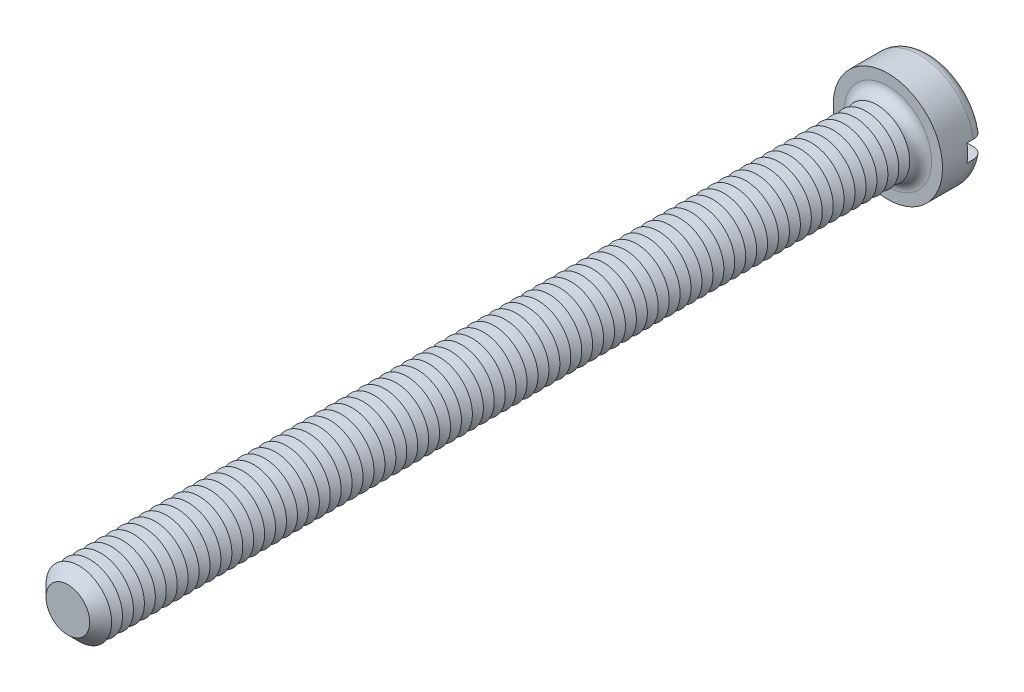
ISO-10303-21;
HEADER;
FILE_DESCRIPTION(('STEP AP214'),'2;1');
FILE_NAME('part.step','',(''),(''),'','','');
FILE_SCHEMA(('AUTOMOTIVE_DESIGN { 1 0 10303 214 1 1 1 1 }'));
ENDSEC;
DATA;
#1=APPLICATION_CONTEXT('core data for automotive mechanical design processes');
#2=APPLICATION_PROTOCOL_DEFINITION('international standard','automotive_design',2000,#1);
#3=PRODUCT_CONTEXT('',#1,'mechanical');
#4=PRODUCT('Part','Part','',(#3));
#5=PRODUCT_RELATED_PRODUCT_CATEGORY('part','',(#4));
#6=PRODUCT_DEFINITION_FORMATION('','',#4);
#7=PRODUCT_DEFINITION_CONTEXT('part definition',#1,'design');
#8=PRODUCT_DEFINITION('design','',#6,#7);
#9=PRODUCT_DEFINITION_SHAPE('','',#8);
#10=(LENGTH_UNIT() NAMED_UNIT(*) SI_UNIT(.MILLI.,.METRE.));
#11=(NAMED_UNIT(*) PLANE_ANGLE_UNIT() SI_UNIT($,.RADIAN.));
#12=(NAMED_UNIT(*) SI_UNIT($,.STERADIAN.) SOLID_ANGLE_UNIT());
#13=UNCERTAINTY_MEASURE_WITH_UNIT(LENGTH_MEASURE(1.E-05),#10,'distance_accuracy_value','');
#14=(GEOMETRIC_REPRESENTATION_CONTEXT(3) GLOBAL_UNCERTAINTY_ASSIGNED_CONTEXT((#13)) GLOBAL_UNIT_ASSIGNED_CONTEXT((#10,
#11,#12)) REPRESENTATION_CONTEXT('',''));
#15=CARTESIAN_POINT('',(0.,0.,0.));
#16=DIRECTION('',(0.,0.,1.));
#17=DIRECTION('',(1.,0.,0.));
#18=AXIS2_PLACEMENT_3D('',#15,#16,#17);
#19=CARTESIAN_POINT('',(0.,0.,-3.9));
#20=DIRECTION('',(0.,0.,1.));
#21=DIRECTION('',(1.,0.,0.));
#22=AXIS2_PLACEMENT_3D('',#19,#20,#21);
#23=PLANE('',#22);
#24=CARTESIAN_POINT('',(0.,0.,-3.9));
#25=DIRECTION('',(0.,0.,1.));
#26=DIRECTION('',(1.,0.,0.));
#27=AXIS2_PLACEMENT_3D('',#24,#25,#26);
#28=CIRCLE('',#27,4.);
#29=CARTESIAN_POINT('',(-3.91918358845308,0.800000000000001,-3.9));
#30=VERTEX_POINT('',#29);
#31=CARTESIAN_POINT('',(3.91918358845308,0.8,-3.9));
#32=VERTEX_POINT('',#31);
#33=EDGE_CURVE('E116',#30,#32,#28,.F.);
#34=ORIENTED_EDGE('',*,*,#33,.T.);
#35=DIRECTION('',(1.,0.,0.));
#36=VECTOR('',#35,1.);
#37=CARTESIAN_POINT('',(-5.,0.800000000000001,-3.9));
#38=LINE('',#37,#36);
#39=EDGE_CURVE('E111',#30,#32,#38,.T.);
#40=ORIENTED_EDGE('',*,*,#39,.F.);
#41=EDGE_LOOP('',(#34,#40));
#42=FACE_BOUND('',#41,.T.);
#43=ADVANCED_FACE('F39',(#42),#23,.F.);
#44=CARTESIAN_POINT('',(0.,0.,-2.9));
#45=DIRECTION('',(0.,0.,1.));
#46=DIRECTION('',(1.,0.,0.));
#47=AXIS2_PLACEMENT_3D('',#44,#45,#46);
#48=TOROIDAL_SURFACE('',#47,4.,1.);
#49=CARTESIAN_POINT('',(-4.76648512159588,0.800000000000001,-3.45304061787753));
#50=CARTESIAN_POINT('',(-4.73486405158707,0.800000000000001,-3.50001565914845));
#51=CARTESIAN_POINT('',(-4.69920787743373,0.800000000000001,-3.54432871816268));
#52=CARTESIAN_POINT('',(-4.62090302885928,0.800000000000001,-3.62634638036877));
#53=CARTESIAN_POINT('',(-4.57824494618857,0.800000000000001,-3.66404194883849));
#54=CARTESIAN_POINT('',(-4.48726975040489,0.800000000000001,-3.73172278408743));
#55=CARTESIAN_POINT('',(-4.43895902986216,0.800000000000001,-3.76171664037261));
#56=CARTESIAN_POINT('',(-4.33804923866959,0.800000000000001,-3.81326437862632));
#57=CARTESIAN_POINT('',(-4.2854512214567,0.800000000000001,-3.8348203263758));
#58=CARTESIAN_POINT('',(-4.17679895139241,0.800000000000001,-3.86918431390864));
#59=CARTESIAN_POINT('',(-4.12071163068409,0.800000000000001,-3.88188775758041));
#60=CARTESIAN_POINT('',(-4.00720729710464,0.800000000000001,-3.89785932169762));
#61=CARTESIAN_POINT('',(-3.94979011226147,0.800000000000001,-3.9011262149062));
#62=CARTESIAN_POINT('',(-3.83429042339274,0.800000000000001,-3.89816676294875));
#63=CARTESIAN_POINT('',(-3.77621176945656,0.800000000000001,-3.89178937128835));
#64=CARTESIAN_POINT('',(-3.66191938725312,0.800000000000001,-3.8694726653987));
#65=CARTESIAN_POINT('',(-3.60570580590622,0.800000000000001,-3.85353259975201));
#66=CARTESIAN_POINT('',(-3.49618749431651,0.800000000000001,-3.81233202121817));
#67=CARTESIAN_POINT('',(-3.44291561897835,0.800000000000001,-3.78698406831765));
#68=CARTESIAN_POINT('',(-3.34140774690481,0.800000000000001,-3.72766098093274));
#69=CARTESIAN_POINT('',(-3.29317182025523,0.800000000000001,-3.69368572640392));
#70=CARTESIAN_POINT('',(-3.20343355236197,0.800000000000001,-3.6182054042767));
#71=CARTESIAN_POINT('',(-3.16189680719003,0.800000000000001,-3.57674128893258));
#72=CARTESIAN_POINT('',(-3.08658236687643,0.800000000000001,-3.48727547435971));
#73=CARTESIAN_POINT('',(-3.05280364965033,0.800000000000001,-3.43927463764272));
#74=CARTESIAN_POINT('',(-2.99489532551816,0.800000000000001,-3.33932895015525));
#75=CARTESIAN_POINT('',(-2.97055012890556,0.800000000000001,-3.28750911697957));
#76=CARTESIAN_POINT('',(-2.93124252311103,0.800000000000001,-3.18042600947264));
#77=CARTESIAN_POINT('',(-2.91627793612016,0.800000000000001,-3.12516353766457));
#78=CARTESIAN_POINT('',(-2.89663075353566,0.800000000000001,-3.01470560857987));
#79=CARTESIAN_POINT('',(-2.89162828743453,0.800000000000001,-2.95956691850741));
#80=CARTESIAN_POINT('',(-2.89112479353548,0.800000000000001,-2.84924961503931));
#81=CARTESIAN_POINT('',(-2.89562264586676,0.800000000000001,-2.79407100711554));
#82=CARTESIAN_POINT('',(-2.91379565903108,0.800000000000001,-2.6861912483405));
#83=CARTESIAN_POINT('',(-2.92731815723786,0.800000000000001,-2.63346424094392));
#84=CARTESIAN_POINT('',(-2.96290888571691,0.800000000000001,-2.53098203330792));
#85=CARTESIAN_POINT('',(-2.98497757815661,0.800000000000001,-2.48122699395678));
#86=CARTESIAN_POINT('',(-3.03728055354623,0.800000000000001,-2.38535286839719));
#87=CARTESIAN_POINT('',(-3.06761989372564,0.800000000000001,-2.33929117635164));
#88=CARTESIAN_POINT('',(-3.13537950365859,0.800000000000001,-2.2527125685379));
#89=CARTESIAN_POINT('',(-3.17280082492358,0.800000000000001,-2.21219647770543));
#90=CARTESIAN_POINT('',(-3.2549164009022,0.800000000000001,-2.13651195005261));
#91=CARTESIAN_POINT('',(-3.29980186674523,0.800000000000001,-2.10155095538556));
#92=CARTESIAN_POINT('',(-3.39467666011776,0.800000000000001,-2.03942270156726));
#93=CARTESIAN_POINT('',(-3.44466673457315,0.800000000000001,-2.01225658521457));
#94=CARTESIAN_POINT('',(-3.5497933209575,0.800000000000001,-1.96576935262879));
#95=CARTESIAN_POINT('',(-3.60503228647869,0.800000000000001,-1.94667963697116));
#96=CARTESIAN_POINT('',(-3.71791613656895,0.800000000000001,-1.91794308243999));
#97=CARTESIAN_POINT('',(-3.77556119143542,0.800000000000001,-1.90829691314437));
#98=CARTESIAN_POINT('',(-3.89221522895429,0.800000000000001,-1.89869331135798));
#99=CARTESIAN_POINT('',(-3.9512319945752,0.800000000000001,-1.89882985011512));
#100=CARTESIAN_POINT('',(-4.06839541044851,0.800000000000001,-1.90907818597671));
#101=CARTESIAN_POINT('',(-4.12654207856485,0.800000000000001,-1.91918977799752));
#102=CARTESIAN_POINT('',(-4.23988103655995,0.800000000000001,-1.9490667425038));
#103=CARTESIAN_POINT('',(-4.29509069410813,0.800000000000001,-1.96876615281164));
#104=CARTESIAN_POINT('',(-4.40134194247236,0.800000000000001,-2.01729572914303));
#105=CARTESIAN_POINT('',(-4.45238383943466,0.800000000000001,-2.04612522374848));
#106=CARTESIAN_POINT('',(-4.54801343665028,0.800000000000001,-2.1116316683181));
#107=CARTESIAN_POINT('',(-4.59268768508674,0.800000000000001,-2.14818225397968));
#108=CARTESIAN_POINT('',(-4.67513924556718,0.800000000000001,-2.22837632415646));
#109=CARTESIAN_POINT('',(-4.71291715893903,0.800000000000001,-2.27201918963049));
#110=CARTESIAN_POINT('',(-4.77986554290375,0.800000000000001,-2.36439990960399));
#111=CARTESIAN_POINT('',(-4.80916462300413,0.800000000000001,-2.41304457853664));
#112=CARTESIAN_POINT('',(-4.85906149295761,0.800000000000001,-2.51460659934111));
#113=CARTESIAN_POINT('',(-4.8796602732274,0.800000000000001,-2.56752346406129));
#114=CARTESIAN_POINT('',(-4.9113264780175,0.800000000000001,-2.67542592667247));
#115=CARTESIAN_POINT('',(-4.92250819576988,0.800000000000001,-2.73037800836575));
#116=CARTESIAN_POINT('',(-4.93542682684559,0.800000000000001,-2.84139649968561));
#117=CARTESIAN_POINT('',(-4.93716171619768,0.800000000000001,-2.89746314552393));
#118=CARTESIAN_POINT('',(-4.93114851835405,0.800000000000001,-3.00876455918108));
#119=CARTESIAN_POINT('',(-4.92345325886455,0.800000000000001,-3.0640022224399));
#120=CARTESIAN_POINT('',(-4.8989032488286,0.800000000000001,-3.17235240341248));
#121=CARTESIAN_POINT('',(-4.88205998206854,0.800000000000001,-3.22546749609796));
#122=CARTESIAN_POINT('',(-4.84819200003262,0.800000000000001,-3.30764066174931));
#123=CARTESIAN_POINT('',(-4.83390853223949,0.800000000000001,-3.33785845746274));
#124=CARTESIAN_POINT('',(-4.80237957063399,0.800000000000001,-3.39670633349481));
#125=CARTESIAN_POINT('',(-4.78513409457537,0.800000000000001,-3.42533642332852));
#126=CARTESIAN_POINT('',(-4.76648512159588,0.800000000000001,-3.45304061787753));
#127=B_SPLINE_CURVE_WITH_KNOTS('',3,(#49,#50,#51,#52,#53,#54,#55,#56,#57,#58,#59,#60,#61,#62,
#63,#64,#65,#66,#67,#68,#69,#70,#71,#72,#73,#74,#75,#76,#77,#78,#79,#80,#81,#82,#83,#84,#85,#86,
#87,#88,#89,#90,#91,#92,#93,#94,#95,#96,#97,#98,#99,#100,#101,#102,#103,#104,#105,#106,#107,
#108,#109,#110,#111,#112,#113,#114,#115,#116,#117,#118,#119,#120,#121,#122,#123,#124,#125,#126),
.UNSPECIFIED.,.T.,.F.,(4,2,2,2,2,2,2,2,2,2,2,2,2,2,2,2,2,2,2,2,2,2,2,2,2,2,2,2,2,2,2,2,2,2,2,2,
2,2,4),(0.,0.169755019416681,0.339740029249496,0.509534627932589,0.67928763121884,
0.851013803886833,1.02276230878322,1.19722869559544,1.37170879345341,1.54785292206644,
1.72399950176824,1.89921049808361,2.07439839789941,2.24530597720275,2.41617386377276,
2.58146078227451,2.74672821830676,2.90926852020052,3.0718176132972,3.2365363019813,
3.40127946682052,3.57118676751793,3.74111896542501,3.91563534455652,4.09016409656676,
4.26636956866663,4.4425714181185,4.61757781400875,4.79257134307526,4.96489650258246,
5.13720662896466,5.30674670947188,5.47626748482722,5.64369988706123,5.81116816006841,
5.97770254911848,6.14402836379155,6.24414438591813,6.34425980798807),.UNSPECIFIED.);
#128=CARTESIAN_POINT('',(-4.93558507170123,0.800000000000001,-2.9));
#129=VERTEX_POINT('',#128);
#130=EDGE_CURVE('E763',#129,#30,#127,.T.);
#131=ORIENTED_EDGE('',*,*,#130,.F.);
#132=CARTESIAN_POINT('',(0.,0.,-2.9));
#133=DIRECTION('',(0.,0.,1.));
#134=DIRECTION('',(1.,0.,0.));
#135=AXIS2_PLACEMENT_3D('',#132,#133,#134);
#136=CIRCLE('',#135,5.);
#137=CARTESIAN_POINT('',(4.93558507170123,0.8,-2.9));
#138=VERTEX_POINT('',#137);
#139=EDGE_CURVE('E125',#138,#129,#136,.T.);
#140=ORIENTED_EDGE('',*,*,#139,.F.);
#141=CARTESIAN_POINT('',(2.98553785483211,0.8,-3.31649797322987));
#142=CARTESIAN_POINT('',(3.00991125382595,0.8,-3.36788093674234));
#143=CARTESIAN_POINT('',(3.03875556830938,0.8,-3.41719756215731));
#144=CARTESIAN_POINT('',(3.1043993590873,0.8,-3.51028676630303));
#145=CARTESIAN_POINT('',(3.1412115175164,0.8,-3.55405032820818));
#146=CARTESIAN_POINT('',(3.22153641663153,0.8,-3.63476402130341));
#147=CARTESIAN_POINT('',(3.26503706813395,0.8,-3.67172618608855));
#148=CARTESIAN_POINT('',(3.35749627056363,0.8,-3.73799476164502));
#149=CARTESIAN_POINT('',(3.4064533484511,0.8,-3.76730323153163));
#150=CARTESIAN_POINT('',(3.5095773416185,0.8,-3.81809642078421));
#151=CARTESIAN_POINT('',(3.56383317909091,0.8,-3.83940072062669));
#152=CARTESIAN_POINT('',(3.67513017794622,0.8,-3.87272481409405));
#153=CARTESIAN_POINT('',(3.7321717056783,0.8,-3.88474338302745));
#154=CARTESIAN_POINT('',(3.84815688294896,0.8,-3.89923413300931));
#155=CARTESIAN_POINT('',(3.90711516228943,0.8,-3.9015896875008));
#156=CARTESIAN_POINT('',(4.02458610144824,0.8,-3.89631753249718));
#157=CARTESIAN_POINT('',(4.08309876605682,0.8,-3.8886899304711));
#158=CARTESIAN_POINT('',(4.19768646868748,0.8,-3.86366584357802));
#159=CARTESIAN_POINT('',(4.25377243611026,0.8,-3.84631948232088));
#160=CARTESIAN_POINT('',(4.3621676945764,0.8,-3.80231797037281));
#161=CARTESIAN_POINT('',(4.41447726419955,0.8,-3.77566350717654));
#162=CARTESIAN_POINT('',(4.51300872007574,0.8,-3.71421163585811));
#163=CARTESIAN_POINT('',(4.5593085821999,0.8,-3.67953927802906));
#164=CARTESIAN_POINT('',(4.64530675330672,0.8,-3.60279495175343));
#165=CARTESIAN_POINT('',(4.68500564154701,0.8,-3.56072363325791));
#166=CARTESIAN_POINT('',(4.75599202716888,0.8,-3.47111750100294));
#167=CARTESIAN_POINT('',(4.7874061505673,0.8,-3.42368298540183));
#168=CARTESIAN_POINT('',(4.84170328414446,0.8,-3.32415927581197));
#169=CARTESIAN_POINT('',(4.86458695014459,0.8,-3.2720704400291));
#170=CARTESIAN_POINT('',(4.90088120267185,0.8,-3.16544016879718));
#171=CARTESIAN_POINT('',(4.91440984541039,0.8,-3.11093889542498));
#172=CARTESIAN_POINT('',(4.93205429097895,0.8,-3.00043391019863));
#173=CARTESIAN_POINT('',(4.93617053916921,0.8,-2.9444302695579));
#174=CARTESIAN_POINT('',(4.93486973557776,0.8,-2.83292218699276));
#175=CARTESIAN_POINT('',(4.92951827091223,0.8,-2.77741696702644));
#176=CARTESIAN_POINT('',(4.90957104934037,0.8,-2.66809456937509));
#177=CARTESIAN_POINT('',(4.89497541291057,0.8,-2.61427736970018));
#178=CARTESIAN_POINT('',(4.85697876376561,0.8,-2.50985095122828));
#179=CARTESIAN_POINT('',(4.83357805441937,0.8,-2.45924162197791));
#180=CARTESIAN_POINT('',(4.77866660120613,0.8,-2.36263484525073));
#181=CARTESIAN_POINT('',(4.74715567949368,0.8,-2.31663749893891));
#182=CARTESIAN_POINT('',(4.67670791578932,0.8,-2.23021464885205));
#183=CARTESIAN_POINT('',(4.6377224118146,0.8,-2.1898288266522));
#184=CARTESIAN_POINT('',(4.55359880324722,0.8,-2.11607828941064));
#185=CARTESIAN_POINT('',(4.50846036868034,0.8,-2.08271395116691));
#186=CARTESIAN_POINT('',(4.41271544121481,0.8,-2.02349513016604));
#187=CARTESIAN_POINT('',(4.36204749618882,0.8,-1.99774003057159));
#188=CARTESIAN_POINT('',(4.257155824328,0.8,-1.95495040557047));
#189=CARTESIAN_POINT('',(4.20293181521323,0.8,-1.93791657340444));
#190=CARTESIAN_POINT('',(4.09154156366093,0.8,-1.91276335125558));
#191=CARTESIAN_POINT('',(4.03434212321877,0.8,-1.90479098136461));
#192=CARTESIAN_POINT('',(3.91941228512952,0.8,-1.89840884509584));
#193=CARTESIAN_POINT('',(3.8616818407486,0.8,-1.89999992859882));
#194=CARTESIAN_POINT('',(3.7464111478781,0.8,-1.91275144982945));
#195=CARTESIAN_POINT('',(3.6888866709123,0.8,-1.92405471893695));
#196=CARTESIAN_POINT('',(3.57652290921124,0.8,-1.95609086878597));
#197=CARTESIAN_POINT('',(3.52168382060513,0.8,-1.97682443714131));
#198=CARTESIAN_POINT('',(3.41589179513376,0.8,-2.02733294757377));
#199=CARTESIAN_POINT('',(3.36496676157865,0.8,-2.05716640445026));
#200=CARTESIAN_POINT('',(3.26890903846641,0.8,-2.12504079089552));
#201=CARTESIAN_POINT('',(3.22377627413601,0.8,-2.16308161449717));
#202=CARTESIAN_POINT('',(3.141135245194,0.8,-2.24593284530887));
#203=CARTESIAN_POINT('',(3.1035541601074,0.8,-2.29067053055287));
#204=CARTESIAN_POINT('',(3.03669700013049,0.8,-2.38597317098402));
#205=CARTESIAN_POINT('',(3.00741914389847,0.8,-2.43653687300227));
#206=CARTESIAN_POINT('',(2.95891799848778,0.8,-2.54052959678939));
#207=CARTESIAN_POINT('',(2.93943249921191,0.8,-2.59383627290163));
#208=CARTESIAN_POINT('',(2.9100081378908,0.8,-2.70303736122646));
#209=CARTESIAN_POINT('',(2.90006970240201,0.8,-2.75893188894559));
#210=CARTESIAN_POINT('',(2.89027863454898,0.8,-2.86986958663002));
#211=CARTESIAN_POINT('',(2.89012791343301,0.8,-2.92488680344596));
#212=CARTESIAN_POINT('',(2.89917145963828,0.8,-3.03409648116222));
#213=CARTESIAN_POINT('',(2.90835313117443,0.8,-3.08828995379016));
#214=CARTESIAN_POINT('',(2.92977618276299,0.8,-3.17141652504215));
#215=CARTESIAN_POINT('',(2.93899011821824,0.8,-3.20116372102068));
#216=CARTESIAN_POINT('',(2.96020249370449,0.8,-3.25964614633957));
#217=CARTESIAN_POINT('',(2.97220082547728,0.8,-3.28838141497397));
#218=CARTESIAN_POINT('',(2.98553785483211,0.8,-3.31649797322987));
#219=B_SPLINE_CURVE_WITH_KNOTS('',3,(#141,#142,#143,#144,#145,#146,#147,#148,#149,#150,#151,
#152,#153,#154,#155,#156,#157,#158,#159,#160,#161,#162,#163,#164,#165,#166,#167,#168,#169,#170,
#171,#172,#173,#174,#175,#176,#177,#178,#179,#180,#181,#182,#183,#184,#185,#186,#187,#188,#189,
#190,#191,#192,#193,#194,#195,#196,#197,#198,#199,#200,#201,#202,#203,#204,#205,#206,#207,#208,
#209,#210,#211,#212,#213,#214,#215,#216,#217,#218),.UNSPECIFIED.,.T.,.F.,(4,2,2,2,2,2,2,2,2,2,2,
2,2,2,2,2,2,2,2,2,2,2,2,2,2,2,2,2,2,2,2,2,2,2,2,2,2,2,4),(0.,0.170493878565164,
0.341261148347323,0.511723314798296,0.682139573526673,0.856194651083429,1.03027268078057,
1.20644565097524,1.38261672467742,1.55788746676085,1.73314526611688,1.90583484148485,
2.07850925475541,2.24836742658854,2.41821253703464,2.58587311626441,2.75352576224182,
2.92002154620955,3.08651516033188,3.25300303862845,3.41949456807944,3.58710926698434,
3.75473295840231,3.92445790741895,4.09419634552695,4.26665110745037,4.43912119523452,
4.61417197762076,4.78923552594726,4.96544940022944,5.1416609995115,5.31608191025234,
5.49046537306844,5.65989063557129,5.82932346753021,5.99359365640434,6.157642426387,
6.250939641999,6.34423323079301),.UNSPECIFIED.);
#220=EDGE_CURVE('E765',#32,#138,#219,.T.);
#221=ORIENTED_EDGE('',*,*,#220,.F.);
#222=ORIENTED_EDGE('',*,*,#33,.F.);
#223=EDGE_LOOP('',(#131,#140,#221,#222));
#224=FACE_BOUND('',#223,.T.);
#225=ADVANCED_FACE('F747',(#224),#48,.T.);
#226=CARTESIAN_POINT('',(0.,0.,-3.9));
#227=DIRECTION('',(0.,0.,1.));
#228=DIRECTION('',(1.,0.,0.));
#229=AXIS2_PLACEMENT_3D('',#226,#227,#228);
#230=CYLINDRICAL_SURFACE('',#229,5.);
#231=DIRECTION('',(0.,0.,1.));
#232=VECTOR('',#231,1.);
#233=CARTESIAN_POINT('',(4.93558507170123,0.8,-3.9));
#234=LINE('',#233,#232);
#235=CARTESIAN_POINT('',(4.93558507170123,0.8,-2.3));
#236=VERTEX_POINT('',#235);
#237=EDGE_CURVE('E781',#138,#236,#234,.T.);
#238=ORIENTED_EDGE('',*,*,#237,.F.);
#239=ORIENTED_EDGE('',*,*,#139,.T.);
#240=DIRECTION('',(0.,0.,1.));
#241=VECTOR('',#240,1.);
#242=CARTESIAN_POINT('',(-4.93558507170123,0.800000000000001,-3.9));
#243=LINE('',#242,#241);
#244=CARTESIAN_POINT('',(-4.93558507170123,0.800000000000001,-2.3));
#245=VERTEX_POINT('',#244);
#246=EDGE_CURVE('E63',#245,#129,#243,.F.);
#247=ORIENTED_EDGE('',*,*,#246,.F.);
#248=CARTESIAN_POINT('',(0.,0.,-2.3));
#249=DIRECTION('',(0.,0.,-1.));
#250=DIRECTION('',(-1.,0.,0.));
#251=AXIS2_PLACEMENT_3D('',#248,#249,#250);
#252=CIRCLE('',#251,5.);
#253=CARTESIAN_POINT('',(-4.93558507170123,-0.799999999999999,-2.3));
#254=VERTEX_POINT('',#253);
#255=EDGE_CURVE('E43',#245,#254,#252,.F.);
#256=ORIENTED_EDGE('',*,*,#255,.T.);
#257=DIRECTION('',(0.,0.,1.));
#258=VECTOR('',#257,1.);
#259=CARTESIAN_POINT('',(-4.93558507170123,-0.799999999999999,-3.9));
#260=LINE('',#259,#258);
#261=CARTESIAN_POINT('',(-4.93558507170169,-0.799999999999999,-2.89999999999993));
#262=VERTEX_POINT('',#261);
#263=EDGE_CURVE('E778',#262,#254,#260,.T.);
#264=ORIENTED_EDGE('',*,*,#263,.F.);
#265=CARTESIAN_POINT('',(4.93558507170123,-0.8,-2.9));
#266=VERTEX_POINT('',#265);
#267=EDGE_CURVE('E127',#262,#266,#136,.T.);
#268=ORIENTED_EDGE('',*,*,#267,.T.);
#269=DIRECTION('',(0.,0.,1.));
#270=VECTOR('',#269,1.);
#271=CARTESIAN_POINT('',(4.93558507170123,-0.8,-3.9));
#272=LINE('',#271,#270);
#273=CARTESIAN_POINT('',(4.93558507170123,-0.8,-2.3));
#274=VERTEX_POINT('',#273);
#275=EDGE_CURVE('E55',#274,#266,#272,.F.);
#276=ORIENTED_EDGE('',*,*,#275,.F.);
#277=EDGE_CURVE('E11',#274,#236,#252,.F.);
#278=ORIENTED_EDGE('',*,*,#277,.T.);
#279=EDGE_LOOP('',(#238,#239,#247,#256,#264,#268,#276,#278));
#280=FACE_BOUND('',#279,.T.);
#281=CARTESIAN_POINT('',(0.,0.,0.));
#282=DIRECTION('',(0.,0.,1.));
#283=DIRECTION('',(1.,0.,0.));
#284=AXIS2_PLACEMENT_3D('',#281,#282,#283);
#285=CIRCLE('',#284,5.);
#286=CARTESIAN_POINT('',(5.,0.,0.));
#287=VERTEX_POINT('',#286);
#288=EDGE_CURVE('E783',#287,#287,#285,.T.);
#289=ORIENTED_EDGE('',*,*,#288,.F.);
#290=EDGE_LOOP('',(#289));
#291=FACE_BOUND('',#290,.T.);
#292=ADVANCED_FACE('F743',(#280,#291),#230,.T.);
#293=CARTESIAN_POINT('',(3.91918358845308,-0.8,-3.9));
#294=VERTEX_POINT('',#293);
#295=CARTESIAN_POINT('',(-3.91918358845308,-0.799999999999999,-3.9));
#296=VERTEX_POINT('',#295);
#297=EDGE_CURVE('E109',#294,#296,#28,.F.);
#298=ORIENTED_EDGE('',*,*,#297,.T.);
#299=DIRECTION('',(-1.,0.,0.));
#300=VECTOR('',#299,1.);
#301=CARTESIAN_POINT('',(-5.,-0.799999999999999,-3.9));
#302=LINE('',#301,#300);
#303=EDGE_CURVE('E96',#294,#296,#302,.T.);
#304=ORIENTED_EDGE('',*,*,#303,.F.);
#305=EDGE_LOOP('',(#298,#304));
#306=FACE_BOUND('',#305,.T.);
#307=ADVANCED_FACE('F108',(#306),#23,.F.);
#308=CARTESIAN_POINT('',(0.,0.,0.));
#309=DIRECTION('',(0.,0.,1.));
#310=DIRECTION('',(1.,0.,0.));
#311=AXIS2_PLACEMENT_3D('',#308,#309,#310);
#312=PLANE('',#311);
#313=CARTESIAN_POINT('',(0.,0.,0.));
#314=DIRECTION('',(0.,0.,1.));
#315=DIRECTION('',(1.,0.,0.));
#316=AXIS2_PLACEMENT_3D('',#313,#314,#315);
#317=CIRCLE('',#316,4.);
#318=CARTESIAN_POINT('',(4.,0.,0.));
#319=VERTEX_POINT('',#318);
#320=EDGE_CURVE('E115',#319,#319,#317,.F.);
#321=ORIENTED_EDGE('',*,*,#320,.T.);
#322=EDGE_LOOP('',(#321));
#323=FACE_BOUND('',#322,.T.);
#324=ORIENTED_EDGE('',*,*,#288,.T.);
#325=EDGE_LOOP('',(#324));
#326=FACE_BOUND('',#325,.T.);
#327=ADVANCED_FACE('F742',(#323,#326),#312,.T.);
#328=CARTESIAN_POINT('',(-4.76648512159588,-0.799999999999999,-3.45304061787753));
#329=CARTESIAN_POINT('',(-4.7975694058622,-0.799999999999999,-3.40685392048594));
#330=CARTESIAN_POINT('',(-4.82479903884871,-0.799999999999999,-3.35802740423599));
#331=CARTESIAN_POINT('',(-4.87070632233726,-0.799999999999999,-3.25646127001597));
#332=CARTESIAN_POINT('',(-4.8893747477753,-0.799999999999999,-3.20371750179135));
#333=CARTESIAN_POINT('',(-4.91756720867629,-0.799999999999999,-3.09584501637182));
#334=CARTESIAN_POINT('',(-4.92709302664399,-0.799999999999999,-3.04071676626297));
#335=CARTESIAN_POINT('',(-4.93671217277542,-0.799999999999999,-2.92965669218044));
#336=CARTESIAN_POINT('',(-4.93680767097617,-0.799999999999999,-2.87372505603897));
#337=CARTESIAN_POINT('',(-4.92758675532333,-0.799999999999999,-2.76284675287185));
#338=CARTESIAN_POINT('',(-4.91830421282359,-0.799999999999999,-2.70789726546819));
#339=CARTESIAN_POINT('',(-4.89065741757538,-0.799999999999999,-2.60033228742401));
#340=CARTESIAN_POINT('',(-4.87229291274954,-0.799999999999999,-2.54771686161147));
#341=CARTESIAN_POINT('',(-4.82699855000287,-0.799999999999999,-2.44622441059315));
#342=CARTESIAN_POINT('',(-4.80005659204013,-0.799999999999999,-2.39735278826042));
#343=CARTESIAN_POINT('',(-4.73841244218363,-0.799999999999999,-2.30477947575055));
#344=CARTESIAN_POINT('',(-4.70371003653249,-0.799999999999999,-2.26107792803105));
#345=CARTESIAN_POINT('',(-4.62724516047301,-0.799999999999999,-2.17969334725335));
#346=CARTESIAN_POINT('',(-4.58542787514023,-0.799999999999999,-2.14206183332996));
#347=CARTESIAN_POINT('',(-4.49614171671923,-0.799999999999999,-2.07424284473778));
#348=CARTESIAN_POINT('',(-4.44867251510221,-0.799999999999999,-2.04405580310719));
#349=CARTESIAN_POINT('',(-4.34875035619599,-0.799999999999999,-1.99153688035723));
#350=CARTESIAN_POINT('',(-4.29623870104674,-0.799999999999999,-1.96931670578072));
#351=CARTESIAN_POINT('',(-4.18826905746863,-0.799999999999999,-1.93384994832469));
#352=CARTESIAN_POINT('',(-4.1328108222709,-0.799999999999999,-1.92060411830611));
#353=CARTESIAN_POINT('',(-4.01956054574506,-0.799999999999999,-1.90323798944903));
#354=CARTESIAN_POINT('',(-3.96174522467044,-0.799999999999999,-1.89926947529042));
#355=CARTESIAN_POINT('',(-3.84625419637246,-0.799999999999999,-1.90095183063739));
#356=CARTESIAN_POINT('',(-3.78857850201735,-0.799999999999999,-1.90660355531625));
#357=CARTESIAN_POINT('',(-3.67415602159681,-0.799999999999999,-1.92748272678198));
#358=CARTESIAN_POINT('',(-3.61743328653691,-0.799999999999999,-1.94284216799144));
#359=CARTESIAN_POINT('',(-3.50734962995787,-0.799999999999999,-1.9828275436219));
#360=CARTESIAN_POINT('',(-3.4539889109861,-0.799999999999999,-2.00745403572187));
#361=CARTESIAN_POINT('',(-3.35197118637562,-0.799999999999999,-2.06542964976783));
#362=CARTESIAN_POINT('',(-3.30333217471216,-0.799999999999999,-2.0988104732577));
#363=CARTESIAN_POINT('',(-3.21244692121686,-0.799999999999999,-2.17337326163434));
#364=CARTESIAN_POINT('',(-3.17020039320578,-0.799999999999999,-2.21455487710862));
#365=CARTESIAN_POINT('',(-3.0940098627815,-0.799999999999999,-2.30296695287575));
#366=CARTESIAN_POINT('',(-3.05995540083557,-0.799999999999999,-2.35010211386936));
#367=CARTESIAN_POINT('',(-3.00053815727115,-0.799999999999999,-2.4495670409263));
#368=CARTESIAN_POINT('',(-2.97517362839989,-0.799999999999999,-2.50189576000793));
#369=CARTESIAN_POINT('',(-2.93470320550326,-0.799999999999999,-2.60853979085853));
#370=CARTESIAN_POINT('',(-2.91930557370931,-0.799999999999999,-2.66274437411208));
#371=CARTESIAN_POINT('',(-2.89812734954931,-0.799999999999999,-2.77299836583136));
#372=CARTESIAN_POINT('',(-2.89234481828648,-0.799999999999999,-2.82904740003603));
#373=CARTESIAN_POINT('',(-2.89064073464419,-0.799999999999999,-2.93970612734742));
#374=CARTESIAN_POINT('',(-2.89444549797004,-0.799999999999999,-2.99431180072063));
#375=CARTESIAN_POINT('',(-2.9112006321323,-0.799999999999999,-3.10209766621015));
#376=CARTESIAN_POINT('',(-2.9241507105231,-0.799999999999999,-3.1552779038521));
#377=CARTESIAN_POINT('',(-2.95868580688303,-0.799999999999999,-3.25858631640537));
#378=CARTESIAN_POINT('',(-2.98024709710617,-0.799999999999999,-3.30872244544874));
#379=CARTESIAN_POINT('',(-3.03128544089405,-0.799999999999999,-3.40478519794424));
#380=CARTESIAN_POINT('',(-3.06076335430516,-0.799999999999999,-3.45071136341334));
#381=CARTESIAN_POINT('',(-3.12753448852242,-0.799999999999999,-3.53826932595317));
#382=CARTESIAN_POINT('',(-3.16500083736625,-0.799999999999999,-3.57976901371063));
#383=CARTESIAN_POINT('',(-3.24617503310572,-0.799999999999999,-3.65613204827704));
#384=CARTESIAN_POINT('',(-3.28988388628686,-0.799999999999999,-3.69099432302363));
#385=CARTESIAN_POINT('',(-3.38380639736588,-0.799999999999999,-3.75424083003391));
#386=CARTESIAN_POINT('',(-3.43418287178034,-0.799999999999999,-3.78238342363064));
#387=CARTESIAN_POINT('',(-3.53887888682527,-0.799999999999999,-3.83000231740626));
#388=CARTESIAN_POINT('',(-3.59319889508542,-0.799999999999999,-3.84947758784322));
#389=CARTESIAN_POINT('',(-3.70539237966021,-0.799999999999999,-3.87954336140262));
#390=CARTESIAN_POINT('',(-3.76331464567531,-0.799999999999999,-3.88995217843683));
#391=CARTESIAN_POINT('',(-3.88008461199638,-0.799999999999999,-3.9009132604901));
#392=CARTESIAN_POINT('',(-3.93893230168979,-0.799999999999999,-3.9014656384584));
#393=CARTESIAN_POINT('',(-4.05594892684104,-0.799999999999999,-3.89264187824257));
#394=CARTESIAN_POINT('',(-4.11411702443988,-0.799999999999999,-3.88325457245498));
#395=CARTESIAN_POINT('',(-4.22802928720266,-0.799999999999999,-3.85472582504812));
#396=CARTESIAN_POINT('',(-4.28377297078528,-0.799999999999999,-3.83558245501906));
#397=CARTESIAN_POINT('',(-4.39054463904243,-0.799999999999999,-3.78829842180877));
#398=CARTESIAN_POINT('',(-4.44161887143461,-0.799999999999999,-3.76026208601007));
#399=CARTESIAN_POINT('',(-4.53818016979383,-0.799999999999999,-3.69589278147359));
#400=CARTESIAN_POINT('',(-4.58367442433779,-0.799999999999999,-3.65957066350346));
#401=CARTESIAN_POINT('',(-4.65208830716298,-0.799999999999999,-3.59453310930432));
#402=CARTESIAN_POINT('',(-4.67711825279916,-0.799999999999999,-3.56800018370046));
#403=CARTESIAN_POINT('',(-4.72414423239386,-0.799999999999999,-3.51236863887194));
#404=CARTESIAN_POINT('',(-4.74614029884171,-0.799999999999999,-3.48327004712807));
#405=CARTESIAN_POINT('',(-4.76648512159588,-0.799999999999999,-3.45304061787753));
#406=B_SPLINE_CURVE_WITH_KNOTS('',3,(#328,#329,#330,#331,#332,#333,#334,#335,#336,#337,#338,
#339,#340,#341,#342,#343,#344,#345,#346,#347,#348,#349,#350,#351,#352,#353,#354,#355,#356,#357,
#358,#359,#360,#361,#362,#363,#364,#365,#366,#367,#368,#369,#370,#371,#372,#373,#374,#375,#376,
#377,#378,#379,#380,#381,#382,#383,#384,#385,#386,#387,#388,#389,#390,#391,#392,#393,#394,#395,
#396,#397,#398,#399,#400,#401,#402,#403,#404,#405),.UNSPECIFIED.,.T.,.F.,(4,2,2,2,2,2,2,2,2,2,2,
2,2,2,2,2,2,2,2,2,2,2,2,2,2,2,2,2,2,2,2,2,2,2,2,2,2,2,4),(0.,0.166886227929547,
0.333951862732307,0.500984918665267,0.667979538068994,0.834373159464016,1.00077139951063,
1.16740542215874,1.33404403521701,1.50202999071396,1.67002571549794,1.84029248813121,
2.01057354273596,2.18362161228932,2.35668506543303,2.53215380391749,2.70763310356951,
2.88375684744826,3.05987270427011,3.23346085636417,3.40701408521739,3.57522519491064,
3.74340238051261,3.90683338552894,4.0702591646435,4.23323770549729,4.39623395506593,
4.56320691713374,4.7302068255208,4.90252468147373,5.07486300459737,5.25058028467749,
5.42629555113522,5.60220844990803,5.77815613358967,5.95211162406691,6.12584060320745,
6.23506966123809,6.34429754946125),.UNSPECIFIED.);
#407=EDGE_CURVE('E103',#296,#262,#406,.T.);
#408=ORIENTED_EDGE('',*,*,#407,.F.);
#409=ORIENTED_EDGE('',*,*,#297,.F.);
#410=CARTESIAN_POINT('',(2.98553785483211,-0.8,-3.31649797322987));
#411=CARTESIAN_POINT('',(2.96216773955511,-0.8,-3.26721849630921));
#412=CARTESIAN_POINT('',(2.94287503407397,-0.8,-3.21596872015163));
#413=CARTESIAN_POINT('',(2.91313258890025,-0.8,-3.11092723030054));
#414=CARTESIAN_POINT('',(2.9026902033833,-0.8,-3.0571334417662));
#415=CARTESIAN_POINT('',(2.89104377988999,-0.8,-2.94853922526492));
#416=CARTESIAN_POINT('',(2.88984130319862,-0.8,-2.89373862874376));
#417=CARTESIAN_POINT('',(2.89672585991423,-0.8,-2.78473646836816));
#418=CARTESIAN_POINT('',(2.90481120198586,-0.8,-2.73053479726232));
#419=CARTESIAN_POINT('',(2.92989134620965,-0.8,-2.62460092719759));
#420=CARTESIAN_POINT('',(2.94682969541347,-0.8,-2.57285532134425));
#421=CARTESIAN_POINT('',(2.9889990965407,-0.8,-2.47286425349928));
#422=CARTESIAN_POINT('',(3.01423103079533,-0.8,-2.42461916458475));
#423=CARTESIAN_POINT('',(3.07271536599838,-0.8,-2.33201565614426));
#424=CARTESIAN_POINT('',(3.10610710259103,-0.8,-2.28774532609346));
#425=CARTESIAN_POINT('',(3.17963417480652,-0.8,-2.205215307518));
#426=CARTESIAN_POINT('',(3.21977054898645,-0.8,-2.16695654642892));
#427=CARTESIAN_POINT('',(3.3070361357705,-0.8,-2.09624274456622));
#428=CARTESIAN_POINT('',(3.35434874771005,-0.8,-2.06401396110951));
#429=CARTESIAN_POINT('',(3.45361131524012,-0.8,-2.00773436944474));
#430=CARTESIAN_POINT('',(3.50556189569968,-0.8,-1.98368466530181));
#431=CARTESIAN_POINT('',(3.61398433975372,-0.8,-1.94389460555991));
#432=CARTESIAN_POINT('',(3.67053506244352,-0.8,-1.92836880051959));
#433=CARTESIAN_POINT('',(3.78543606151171,-0.8,-1.90696594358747));
#434=CARTESIAN_POINT('',(3.84378643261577,-0.8,-1.90108940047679));
#435=CARTESIAN_POINT('',(3.96100201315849,-0.8,-1.89918115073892));
#436=CARTESIAN_POINT('',(4.01986821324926,-0.8,-1.90320860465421));
#437=CARTESIAN_POINT('',(4.13606891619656,-0.8,-1.9211820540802));
#438=CARTESIAN_POINT('',(4.19340347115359,-0.8,-1.93512771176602));
#439=CARTESIAN_POINT('',(4.30434213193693,-0.8,-1.97243705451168));
#440=CARTESIAN_POINT('',(4.35797549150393,-0.8,-1.99571368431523));
#441=CARTESIAN_POINT('',(4.46048254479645,-0.8,-2.0510826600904));
#442=CARTESIAN_POINT('',(4.50935662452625,-0.8,-2.08317429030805));
#443=CARTESIAN_POINT('',(4.60012348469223,-0.8,-2.15471647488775));
#444=CARTESIAN_POINT('',(4.64211506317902,-0.8,-2.19404167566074));
#445=CARTESIAN_POINT('',(4.71877054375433,-0.8,-2.27928299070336));
#446=CARTESIAN_POINT('',(4.75343508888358,-0.8,-2.32519852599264));
#447=CARTESIAN_POINT('',(4.81388799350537,-0.8,-2.4215411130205));
#448=CARTESIAN_POINT('',(4.83980652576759,-0.8,-2.47188650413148));
#449=CARTESIAN_POINT('',(4.88271402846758,-0.8,-2.57624865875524));
#450=CARTESIAN_POINT('',(4.89970360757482,-0.8,-2.63026517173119));
#451=CARTESIAN_POINT('',(4.92409334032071,-0.8,-2.73978844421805));
#452=CARTESIAN_POINT('',(4.93159814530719,-0.8,-2.79527191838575));
#453=CARTESIAN_POINT('',(4.93713723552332,-0.8,-2.90670881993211));
#454=CARTESIAN_POINT('',(4.9351718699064,-0.8,-2.9626622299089));
#455=CARTESIAN_POINT('',(4.92186293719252,-0.8,-3.07317093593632));
#456=CARTESIAN_POINT('',(4.91056393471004,-0.8,-3.12773160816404));
#457=CARTESIAN_POINT('',(4.87898532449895,-0.8,-3.234187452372));
#458=CARTESIAN_POINT('',(4.85870572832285,-0.8,-3.28608262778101));
#459=CARTESIAN_POINT('',(4.80971634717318,-0.8,-3.38586723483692));
#460=CARTESIAN_POINT('',(4.78098824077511,-0.8,-3.43374766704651));
#461=CARTESIAN_POINT('',(4.71596686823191,-0.8,-3.52405937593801));
#462=CARTESIAN_POINT('',(4.67967336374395,-0.8,-3.56649048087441));
#463=CARTESIAN_POINT('',(4.60022577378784,-0.8,-3.64511036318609));
#464=CARTESIAN_POINT('',(4.5570143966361,-0.8,-3.6812412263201));
#465=CARTESIAN_POINT('',(4.4652099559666,-0.8,-3.7458530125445));
#466=CARTESIAN_POINT('',(4.41661654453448,-0.8,-3.77433344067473));
#467=CARTESIAN_POINT('',(4.31470683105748,-0.8,-3.82326981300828));
#468=CARTESIAN_POINT('',(4.26133399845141,-0.8,-3.84360800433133));
#469=CARTESIAN_POINT('',(4.15196444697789,-0.8,-3.87519515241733));
#470=CARTESIAN_POINT('',(4.09596750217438,-0.8,-3.88644332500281));
#471=CARTESIAN_POINT('',(3.98196469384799,-0.8,-3.89971870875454));
#472=CARTESIAN_POINT('',(3.92394096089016,-0.8,-3.901592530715));
#473=CARTESIAN_POINT('',(3.8083852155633,-0.8,-3.89570840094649));
#474=CARTESIAN_POINT('',(3.75085322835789,-0.8,-3.88794995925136));
#475=CARTESIAN_POINT('',(3.6371167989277,-0.8,-3.86287824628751));
#476=CARTESIAN_POINT('',(3.58093962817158,-0.8,-3.84544111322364));
#477=CARTESIAN_POINT('',(3.47227948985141,-0.8,-3.80139971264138));
#478=CARTESIAN_POINT('',(3.41979762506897,-0.8,-3.77479272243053));
#479=CARTESIAN_POINT('',(3.31994061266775,-0.8,-3.71304199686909));
#480=CARTESIAN_POINT('',(3.27257854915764,-0.8,-3.67787710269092));
#481=CARTESIAN_POINT('',(3.18459619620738,-0.8,-3.59999704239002));
#482=CARTESIAN_POINT('',(3.14396747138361,-0.8,-3.55729146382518));
#483=CARTESIAN_POINT('',(3.08341110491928,-0.8,-3.48140072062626));
#484=CARTESIAN_POINT('',(3.06118126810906,-0.8,-3.45002448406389));
#485=CARTESIAN_POINT('',(3.02047302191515,-0.8,-3.38492378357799));
#486=CARTESIAN_POINT('',(3.00199451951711,-0.8,-3.35119937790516));
#487=CARTESIAN_POINT('',(2.98553785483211,-0.8,-3.31649797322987));
#488=B_SPLINE_CURVE_WITH_KNOTS('',3,(#410,#411,#412,#413,#414,#415,#416,#417,#418,#419,#420,
#421,#422,#423,#424,#425,#426,#427,#428,#429,#430,#431,#432,#433,#434,#435,#436,#437,#438,#439,
#440,#441,#442,#443,#444,#445,#446,#447,#448,#449,#450,#451,#452,#453,#454,#455,#456,#457,#458,
#459,#460,#461,#462,#463,#464,#465,#466,#467,#468,#469,#470,#471,#472,#473,#474,#475,#476,#477,
#478,#479,#480,#481,#482,#483,#484,#485,#486,#487),.UNSPECIFIED.,.T.,.F.,(4,2,2,2,2,2,2,2,2,2,2,
2,2,2,2,2,2,2,2,2,2,2,2,2,2,2,2,2,2,2,2,2,2,2,2,2,2,2,4),(0.,0.163484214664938,
0.327104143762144,0.490751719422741,0.654369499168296,0.816956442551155,0.979560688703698,
1.14516376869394,1.31079237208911,1.48174839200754,1.6527274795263,1.82783306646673,
2.00294788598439,2.17911127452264,2.35526866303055,2.52981944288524,2.70435605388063,
2.87611266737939,3.04785420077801,3.21691347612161,3.38596122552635,3.55312700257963,
3.72028661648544,3.88665268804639,4.053018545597,4.2197478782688,4.38648246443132,
4.55467705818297,4.72288253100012,4.89343959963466,5.06401138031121,5.23736524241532,
5.41072792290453,5.58636211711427,5.76204850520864,5.93817375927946,6.11407667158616,
6.22920111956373,6.34432271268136),.UNSPECIFIED.);
#489=EDGE_CURVE('E92',#266,#294,#488,.T.);
#490=ORIENTED_EDGE('',*,*,#489,.F.);
#491=ORIENTED_EDGE('',*,*,#267,.F.);
#492=EDGE_LOOP('',(#408,#409,#490,#491));
#493=FACE_BOUND('',#492,.T.);
#494=ADVANCED_FACE('F113',(#493),#48,.T.);
#495=CARTESIAN_POINT('',(0.,0.,1.));
#496=DIRECTION('',(0.,0.,1.));
#497=DIRECTION('',(1.,0.,0.));
#498=AXIS2_PLACEMENT_3D('',#495,#496,#497);
#499=TOROIDAL_SURFACE('',#498,4.,1.);
#500=ORIENTED_EDGE('',*,*,#320,.F.);
#501=EDGE_LOOP('',(#500));
#502=FACE_BOUND('',#501,.T.);
#503=CARTESIAN_POINT('',(0.,0.,1.));
#504=DIRECTION('',(0.,0.,-1.));
#505=DIRECTION('',(-1.,0.,0.));
#506=AXIS2_PLACEMENT_3D('',#503,#504,#505);
#507=CIRCLE('',#506,3.);
#508=CARTESIAN_POINT('',(-3.,0.,1.));
#509=VERTEX_POINT('',#508);
#510=EDGE_CURVE('E788',#509,#509,#507,.T.);
#511=ORIENTED_EDGE('',*,*,#510,.T.);
#512=EDGE_LOOP('',(#511));
#513=FACE_BOUND('',#512,.T.);
#514=ADVANCED_FACE('F735',(#502,#513),#499,.F.);
#515=CARTESIAN_POINT('',(0.,0.,1.5));
#516=DIRECTION('',(0.,0.,-1.));
#517=DIRECTION('',(-1.,0.,0.));
#518=AXIS2_PLACEMENT_3D('',#515,#516,#517);
#519=CONICAL_SURFACE('',#518,2.13397459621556,1.0471975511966);
#520=ORIENTED_EDGE('',*,*,#510,.F.);
#521=EDGE_LOOP('',(#520));
#522=FACE_BOUND('',#521,.T.);
#523=CARTESIAN_POINT('',(0.,0.,1.5));
#524=DIRECTION('',(0.,0.,-1.));
#525=DIRECTION('',(-1.,0.,0.));
#526=AXIS2_PLACEMENT_3D('',#523,#524,#525);
#527=CIRCLE('',#526,2.13397459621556);
#528=CARTESIAN_POINT('',(-2.13397459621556,0.,1.5));
#529=VERTEX_POINT('',#528);
#530=EDGE_CURVE('E795',#529,#529,#527,.T.);
#531=ORIENTED_EDGE('',*,*,#530,.T.);
#532=EDGE_LOOP('',(#531));
#533=FACE_BOUND('',#532,.T.);
#534=ADVANCED_FACE('F731',(#522,#533),#519,.T.);
#535=CARTESIAN_POINT('',(0.,0.,2.));
#536=DIRECTION('',(0.,0.,1.));
#537=DIRECTION('',(1.,0.,0.));
#538=AXIS2_PLACEMENT_3D('',#535,#536,#537);
#539=CONICAL_SURFACE('',#538,3.,1.0471975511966);
#540=ORIENTED_EDGE('',*,*,#530,.F.);
#541=EDGE_LOOP('',(#540));
#542=FACE_BOUND('',#541,.T.);
#543=CARTESIAN_POINT('',(0.,0.,2.));
#544=DIRECTION('',(0.,0.,-1.));
#545=DIRECTION('',(-1.,0.,0.));
#546=AXIS2_PLACEMENT_3D('',#543,#544,#545);
#547=CIRCLE('',#546,3.);
#548=CARTESIAN_POINT('',(-3.,0.,2.));
#549=VERTEX_POINT('',#548);
#550=EDGE_CURVE('E801',#549,#549,#547,.T.);
#551=ORIENTED_EDGE('',*,*,#550,.T.);
#552=EDGE_LOOP('',(#551));
#553=FACE_BOUND('',#552,.T.);
#554=ADVANCED_FACE('F727',(#542,#553),#539,.T.);
#555=CARTESIAN_POINT('',(0.,0.,2.5));
#556=DIRECTION('',(0.,0.,-1.));
#557=DIRECTION('',(-1.,0.,0.));
#558=AXIS2_PLACEMENT_3D('',#555,#556,#557);
#559=CONICAL_SURFACE('',#558,2.13397459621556,1.0471975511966);
#560=ORIENTED_EDGE('',*,*,#550,.F.);
#561=EDGE_LOOP('',(#560));
#562=FACE_BOUND('',#561,.T.);
#563=CARTESIAN_POINT('',(0.,0.,2.5));
#564=DIRECTION('',(0.,0.,-1.));
#565=DIRECTION('',(-1.,0.,0.));
#566=AXIS2_PLACEMENT_3D('',#563,#564,#565);
#567=CIRCLE('',#566,2.13397459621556);
#568=CARTESIAN_POINT('',(-2.13397459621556,0.,2.5));
#569=VERTEX_POINT('',#568);
#570=EDGE_CURVE('E805',#569,#569,#567,.T.);
#571=ORIENTED_EDGE('',*,*,#570,.T.);
#572=EDGE_LOOP('',(#571));
#573=FACE_BOUND('',#572,.T.);
#574=ADVANCED_FACE('F723',(#562,#573),#559,.T.);
#575=CARTESIAN_POINT('',(0.,0.,3.));
#576=DIRECTION('',(0.,0.,1.));
#577=DIRECTION('',(1.,0.,0.));
#578=AXIS2_PLACEMENT_3D('',#575,#576,#577);
#579=CONICAL_SURFACE('',#578,3.,1.0471975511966);
#580=ORIENTED_EDGE('',*,*,#570,.F.);
#581=EDGE_LOOP('',(#580));
#582=FACE_BOUND('',#581,.T.);
#583=CARTESIAN_POINT('',(0.,0.,3.));
#584=DIRECTION('',(0.,0.,-1.));
#585=DIRECTION('',(-1.,0.,0.));
#586=AXIS2_PLACEMENT_3D('',#583,#584,#585);
#587=CIRCLE('',#586,3.);
#588=CARTESIAN_POINT('',(-3.,0.,3.));
#589=VERTEX_POINT('',#588);
#590=EDGE_CURVE('E808',#589,#589,#587,.T.);
#591=ORIENTED_EDGE('',*,*,#590,.T.);
#592=EDGE_LOOP('',(#591));
#593=FACE_BOUND('',#592,.T.);
#594=ADVANCED_FACE('F719',(#582,#593),#579,.T.);
#595=CARTESIAN_POINT('',(0.,0.,3.5));
#596=DIRECTION('',(0.,0.,-1.));
#597=DIRECTION('',(-1.,0.,0.));
#598=AXIS2_PLACEMENT_3D('',#595,#596,#597);
#599=CONICAL_SURFACE('',#598,2.13397459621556,1.0471975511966);
#600=ORIENTED_EDGE('',*,*,#590,.F.);
#601=EDGE_LOOP('',(#600));
#602=FACE_BOUND('',#601,.T.);
#603=CARTESIAN_POINT('',(0.,0.,3.5));
#604=DIRECTION('',(0.,0.,-1.));
#605=DIRECTION('',(-1.,0.,0.));
#606=AXIS2_PLACEMENT_3D('',#603,#604,#605);
#607=CIRCLE('',#606,2.13397459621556);
#608=CARTESIAN_POINT('',(-2.13397459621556,0.,3.5));
#609=VERTEX_POINT('',#608);
#610=EDGE_CURVE('E812',#609,#609,#607,.T.);
#611=ORIENTED_EDGE('',*,*,#610,.T.);
#612=EDGE_LOOP('',(#611));
#613=FACE_BOUND('',#612,.T.);
#614=ADVANCED_FACE('F715',(#602,#613),#599,.T.);
#615=CARTESIAN_POINT('',(0.,0.,4.));
#616=DIRECTION('',(0.,0.,1.));
#617=DIRECTION('',(1.,0.,0.));
#618=AXIS2_PLACEMENT_3D('',#615,#616,#617);
#619=CONICAL_SURFACE('',#618,3.,1.0471975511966);
#620=ORIENTED_EDGE('',*,*,#610,.F.);
#621=EDGE_LOOP('',(#620));
#622=FACE_BOUND('',#621,.T.);
#623=CARTESIAN_POINT('',(0.,0.,4.));
#624=DIRECTION('',(0.,0.,-1.));
#625=DIRECTION('',(-1.,0.,0.));
#626=AXIS2_PLACEMENT_3D('',#623,#624,#625);
#627=CIRCLE('',#626,3.);
#628=CARTESIAN_POINT('',(-3.,0.,4.));
#629=VERTEX_POINT('',#628);
#630=EDGE_CURVE('E815',#629,#629,#627,.T.);
#631=ORIENTED_EDGE('',*,*,#630,.T.);
#632=EDGE_LOOP('',(#631));
#633=FACE_BOUND('',#632,.T.);
#634=ADVANCED_FACE('F711',(#622,#633),#619,.T.);
#635=CARTESIAN_POINT('',(0.,0.,4.5));
#636=DIRECTION('',(0.,0.,-1.));
#637=DIRECTION('',(-1.,0.,0.));
#638=AXIS2_PLACEMENT_3D('',#635,#636,#637);
#639=CONICAL_SURFACE('',#638,2.13397459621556,1.0471975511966);
#640=ORIENTED_EDGE('',*,*,#630,.F.);
#641=EDGE_LOOP('',(#640));
#642=FACE_BOUND('',#641,.T.);
#643=CARTESIAN_POINT('',(0.,0.,4.5));
#644=DIRECTION('',(0.,0.,-1.));
#645=DIRECTION('',(-1.,0.,0.));
#646=AXIS2_PLACEMENT_3D('',#643,#644,#645);
#647=CIRCLE('',#646,2.13397459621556);
#648=CARTESIAN_POINT('',(-2.13397459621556,0.,4.5));
#649=VERTEX_POINT('',#648);
#650=EDGE_CURVE('E818',#649,#649,#647,.T.);
#651=ORIENTED_EDGE('',*,*,#650,.T.);
#652=EDGE_LOOP('',(#651));
#653=FACE_BOUND('',#652,.T.);
#654=ADVANCED_FACE('F707',(#642,#653),#639,.T.);
#655=CARTESIAN_POINT('',(0.,0.,5.));
#656=DIRECTION('',(0.,0.,1.));
#657=DIRECTION('',(1.,0.,0.));
#658=AXIS2_PLACEMENT_3D('',#655,#656,#657);
#659=CONICAL_SURFACE('',#658,3.,1.0471975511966);
#660=ORIENTED_EDGE('',*,*,#650,.F.);
#661=EDGE_LOOP('',(#660));
#662=FACE_BOUND('',#661,.T.);
#663=CARTESIAN_POINT('',(0.,0.,5.));
#664=DIRECTION('',(0.,0.,-1.));
#665=DIRECTION('',(-1.,0.,0.));
#666=AXIS2_PLACEMENT_3D('',#663,#664,#665);
#667=CIRCLE('',#666,3.);
#668=CARTESIAN_POINT('',(-3.,0.,5.));
#669=VERTEX_POINT('',#668);
#670=EDGE_CURVE('E822',#669,#669,#667,.T.);
#671=ORIENTED_EDGE('',*,*,#670,.T.);
#672=EDGE_LOOP('',(#671));
#673=FACE_BOUND('',#672,.T.);
#674=ADVANCED_FACE('F703',(#662,#673),#659,.T.);
#675=CARTESIAN_POINT('',(0.,0.,5.5));
#676=DIRECTION('',(0.,0.,-1.));
#677=DIRECTION('',(-1.,0.,0.));
#678=AXIS2_PLACEMENT_3D('',#675,#676,#677);
#679=CONICAL_SURFACE('',#678,2.13397459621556,1.0471975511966);
#680=ORIENTED_EDGE('',*,*,#670,.F.);
#681=EDGE_LOOP('',(#680));
#682=FACE_BOUND('',#681,.T.);
#683=CARTESIAN_POINT('',(0.,0.,5.5));
#684=DIRECTION('',(0.,0.,-1.));
#685=DIRECTION('',(-1.,0.,0.));
#686=AXIS2_PLACEMENT_3D('',#683,#684,#685);
#687=CIRCLE('',#686,2.13397459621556);
#688=CARTESIAN_POINT('',(-2.13397459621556,0.,5.5));
#689=VERTEX_POINT('',#688);
#690=EDGE_CURVE('E826',#689,#689,#687,.T.);
#691=ORIENTED_EDGE('',*,*,#690,.T.);
#692=EDGE_LOOP('',(#691));
#693=FACE_BOUND('',#692,.T.);
#694=ADVANCED_FACE('F699',(#682,#693),#679,.T.);
#695=CARTESIAN_POINT('',(0.,0.,6.));
#696=DIRECTION('',(0.,0.,1.));
#697=DIRECTION('',(1.,0.,0.));
#698=AXIS2_PLACEMENT_3D('',#695,#696,#697);
#699=CONICAL_SURFACE('',#698,3.,1.0471975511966);
#700=ORIENTED_EDGE('',*,*,#690,.F.);
#701=EDGE_LOOP('',(#700));
#702=FACE_BOUND('',#701,.T.);
#703=CARTESIAN_POINT('',(0.,0.,6.));
#704=DIRECTION('',(0.,0.,-1.));
#705=DIRECTION('',(-1.,0.,0.));
#706=AXIS2_PLACEMENT_3D('',#703,#704,#705);
#707=CIRCLE('',#706,3.);
#708=CARTESIAN_POINT('',(-3.,0.,6.));
#709=VERTEX_POINT('',#708);
#710=EDGE_CURVE('E830',#709,#709,#707,.T.);
#711=ORIENTED_EDGE('',*,*,#710,.T.);
#712=EDGE_LOOP('',(#711));
#713=FACE_BOUND('',#712,.T.);
#714=ADVANCED_FACE('F695',(#702,#713),#699,.T.);
#715=CARTESIAN_POINT('',(0.,0.,6.5));
#716=DIRECTION('',(0.,0.,-1.));
#717=DIRECTION('',(-1.,0.,0.));
#718=AXIS2_PLACEMENT_3D('',#715,#716,#717);
#719=CONICAL_SURFACE('',#718,2.13397459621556,1.0471975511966);
#720=ORIENTED_EDGE('',*,*,#710,.F.);
#721=EDGE_LOOP('',(#720));
#722=FACE_BOUND('',#721,.T.);
#723=CARTESIAN_POINT('',(0.,0.,6.5));
#724=DIRECTION('',(0.,0.,-1.));
#725=DIRECTION('',(-1.,0.,0.));
#726=AXIS2_PLACEMENT_3D('',#723,#724,#725);
#727=CIRCLE('',#726,2.13397459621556);
#728=CARTESIAN_POINT('',(-2.13397459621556,0.,6.5));
#729=VERTEX_POINT('',#728);
#730=EDGE_CURVE('E834',#729,#729,#727,.T.);
#731=ORIENTED_EDGE('',*,*,#730,.T.);
#732=EDGE_LOOP('',(#731));
#733=FACE_BOUND('',#732,.T.);
#734=ADVANCED_FACE('F691',(#722,#733),#719,.T.);
#735=CARTESIAN_POINT('',(0.,0.,7.));
#736=DIRECTION('',(0.,0.,1.));
#737=DIRECTION('',(1.,0.,0.));
#738=AXIS2_PLACEMENT_3D('',#735,#736,#737);
#739=CONICAL_SURFACE('',#738,3.,1.0471975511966);
#740=ORIENTED_EDGE('',*,*,#730,.F.);
#741=EDGE_LOOP('',(#740));
#742=FACE_BOUND('',#741,.T.);
#743=CARTESIAN_POINT('',(0.,0.,7.));
#744=DIRECTION('',(0.,0.,-1.));
#745=DIRECTION('',(-1.,0.,0.));
#746=AXIS2_PLACEMENT_3D('',#743,#744,#745);
#747=CIRCLE('',#746,3.);
#748=CARTESIAN_POINT('',(-3.,0.,7.));
#749=VERTEX_POINT('',#748);
#750=EDGE_CURVE('E838',#749,#749,#747,.T.);
#751=ORIENTED_EDGE('',*,*,#750,.T.);
#752=EDGE_LOOP('',(#751));
#753=FACE_BOUND('',#752,.T.);
#754=ADVANCED_FACE('F687',(#742,#753),#739,.T.);
#755=CARTESIAN_POINT('',(0.,0.,7.5));
#756=DIRECTION('',(0.,0.,-1.));
#757=DIRECTION('',(-1.,0.,0.));
#758=AXIS2_PLACEMENT_3D('',#755,#756,#757);
#759=CONICAL_SURFACE('',#758,2.13397459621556,1.0471975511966);
#760=ORIENTED_EDGE('',*,*,#750,.F.);
#761=EDGE_LOOP('',(#760));
#762=FACE_BOUND('',#761,.T.);
#763=CARTESIAN_POINT('',(0.,0.,7.5));
#764=DIRECTION('',(0.,0.,-1.));
#765=DIRECTION('',(-1.,0.,0.));
#766=AXIS2_PLACEMENT_3D('',#763,#764,#765);
#767=CIRCLE('',#766,2.13397459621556);
#768=CARTESIAN_POINT('',(-2.13397459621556,0.,7.5));
#769=VERTEX_POINT('',#768);
#770=EDGE_CURVE('E842',#769,#769,#767,.T.);
#771=ORIENTED_EDGE('',*,*,#770,.T.);
#772=EDGE_LOOP('',(#771));
#773=FACE_BOUND('',#772,.T.);
#774=ADVANCED_FACE('F683',(#762,#773),#759,.T.);
#775=CARTESIAN_POINT('',(0.,0.,8.));
#776=DIRECTION('',(0.,0.,1.));
#777=DIRECTION('',(1.,0.,0.));
#778=AXIS2_PLACEMENT_3D('',#775,#776,#777);
#779=CONICAL_SURFACE('',#778,3.,1.0471975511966);
#780=ORIENTED_EDGE('',*,*,#770,.F.);
#781=EDGE_LOOP('',(#780));
#782=FACE_BOUND('',#781,.T.);
#783=CARTESIAN_POINT('',(0.,0.,8.));
#784=DIRECTION('',(0.,0.,-1.));
#785=DIRECTION('',(-1.,0.,0.));
#786=AXIS2_PLACEMENT_3D('',#783,#784,#785);
#787=CIRCLE('',#786,3.);
#788=CARTESIAN_POINT('',(-3.,0.,8.));
#789=VERTEX_POINT('',#788);
#790=EDGE_CURVE('E846',#789,#789,#787,.T.);
#791=ORIENTED_EDGE('',*,*,#790,.T.);
#792=EDGE_LOOP('',(#791));
#793=FACE_BOUND('',#792,.T.);
#794=ADVANCED_FACE('F679',(#782,#793),#779,.T.);
#795=CARTESIAN_POINT('',(0.,0.,8.5));
#796=DIRECTION('',(0.,0.,-1.));
#797=DIRECTION('',(-1.,0.,0.));
#798=AXIS2_PLACEMENT_3D('',#795,#796,#797);
#799=CONICAL_SURFACE('',#798,2.13397459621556,1.0471975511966);
#800=ORIENTED_EDGE('',*,*,#790,.F.);
#801=EDGE_LOOP('',(#800));
#802=FACE_BOUND('',#801,.T.);
#803=CARTESIAN_POINT('',(0.,0.,8.5));
#804=DIRECTION('',(0.,0.,-1.));
#805=DIRECTION('',(-1.,0.,0.));
#806=AXIS2_PLACEMENT_3D('',#803,#804,#805);
#807=CIRCLE('',#806,2.13397459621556);
#808=CARTESIAN_POINT('',(-2.13397459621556,0.,8.5));
#809=VERTEX_POINT('',#808);
#810=EDGE_CURVE('E850',#809,#809,#807,.T.);
#811=ORIENTED_EDGE('',*,*,#810,.T.);
#812=EDGE_LOOP('',(#811));
#813=FACE_BOUND('',#812,.T.);
#814=ADVANCED_FACE('F675',(#802,#813),#799,.T.);
#815=CARTESIAN_POINT('',(0.,0.,9.));
#816=DIRECTION('',(0.,0.,1.));
#817=DIRECTION('',(1.,0.,0.));
#818=AXIS2_PLACEMENT_3D('',#815,#816,#817);
#819=CONICAL_SURFACE('',#818,3.,1.0471975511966);
#820=ORIENTED_EDGE('',*,*,#810,.F.);
#821=EDGE_LOOP('',(#820));
#822=FACE_BOUND('',#821,.T.);
#823=CARTESIAN_POINT('',(0.,0.,9.));
#824=DIRECTION('',(0.,0.,-1.));
#825=DIRECTION('',(-1.,0.,0.));
#826=AXIS2_PLACEMENT_3D('',#823,#824,#825);
#827=CIRCLE('',#826,3.);
#828=CARTESIAN_POINT('',(-3.,0.,9.));
#829=VERTEX_POINT('',#828);
#830=EDGE_CURVE('E854',#829,#829,#827,.T.);
#831=ORIENTED_EDGE('',*,*,#830,.T.);
#832=EDGE_LOOP('',(#831));
#833=FACE_BOUND('',#832,.T.);
#834=ADVANCED_FACE('F671',(#822,#833),#819,.T.);
#835=CARTESIAN_POINT('',(0.,0.,9.5));
#836=DIRECTION('',(0.,0.,-1.));
#837=DIRECTION('',(-1.,0.,0.));
#838=AXIS2_PLACEMENT_3D('',#835,#836,#837);
#839=CONICAL_SURFACE('',#838,2.13397459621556,1.0471975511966);
#840=ORIENTED_EDGE('',*,*,#830,.F.);
#841=EDGE_LOOP('',(#840));
#842=FACE_BOUND('',#841,.T.);
#843=CARTESIAN_POINT('',(0.,0.,9.5));
#844=DIRECTION('',(0.,0.,-1.));
#845=DIRECTION('',(-1.,0.,0.));
#846=AXIS2_PLACEMENT_3D('',#843,#844,#845);
#847=CIRCLE('',#846,2.13397459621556);
#848=CARTESIAN_POINT('',(-2.13397459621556,0.,9.5));
#849=VERTEX_POINT('',#848);
#850=EDGE_CURVE('E858',#849,#849,#847,.T.);
#851=ORIENTED_EDGE('',*,*,#850,.T.);
#852=EDGE_LOOP('',(#851));
#853=FACE_BOUND('',#852,.T.);
#854=ADVANCED_FACE('F667',(#842,#853),#839,.T.);
#855=CARTESIAN_POINT('',(0.,0.,10.));
#856=DIRECTION('',(0.,0.,1.));
#857=DIRECTION('',(1.,0.,0.));
#858=AXIS2_PLACEMENT_3D('',#855,#856,#857);
#859=CONICAL_SURFACE('',#858,3.,1.0471975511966);
#860=ORIENTED_EDGE('',*,*,#850,.F.);
#861=EDGE_LOOP('',(#860));
#862=FACE_BOUND('',#861,.T.);
#863=CARTESIAN_POINT('',(0.,0.,10.));
#864=DIRECTION('',(0.,0.,-1.));
#865=DIRECTION('',(-1.,0.,0.));
#866=AXIS2_PLACEMENT_3D('',#863,#864,#865);
#867=CIRCLE('',#866,3.);
#868=CARTESIAN_POINT('',(-3.,0.,10.));
#869=VERTEX_POINT('',#868);
#870=EDGE_CURVE('E862',#869,#869,#867,.T.);
#871=ORIENTED_EDGE('',*,*,#870,.T.);
#872=EDGE_LOOP('',(#871));
#873=FACE_BOUND('',#872,.T.);
#874=ADVANCED_FACE('F663',(#862,#873),#859,.T.);
#875=CARTESIAN_POINT('',(0.,0.,10.5));
#876=DIRECTION('',(0.,0.,-1.));
#877=DIRECTION('',(-1.,0.,0.));
#878=AXIS2_PLACEMENT_3D('',#875,#876,#877);
#879=CONICAL_SURFACE('',#878,2.13397459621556,1.0471975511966);
#880=ORIENTED_EDGE('',*,*,#870,.F.);
#881=EDGE_LOOP('',(#880));
#882=FACE_BOUND('',#881,.T.);
#883=CARTESIAN_POINT('',(0.,0.,10.5));
#884=DIRECTION('',(0.,0.,-1.));
#885=DIRECTION('',(-1.,0.,0.));
#886=AXIS2_PLACEMENT_3D('',#883,#884,#885);
#887=CIRCLE('',#886,2.13397459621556);
#888=CARTESIAN_POINT('',(-2.13397459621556,0.,10.5));
#889=VERTEX_POINT('',#888);
#890=EDGE_CURVE('E866',#889,#889,#887,.T.);
#891=ORIENTED_EDGE('',*,*,#890,.T.);
#892=EDGE_LOOP('',(#891));
#893=FACE_BOUND('',#892,.T.);
#894=ADVANCED_FACE('F659',(#882,#893),#879,.T.);
#895=CARTESIAN_POINT('',(0.,0.,11.));
#896=DIRECTION('',(0.,0.,1.));
#897=DIRECTION('',(1.,0.,0.));
#898=AXIS2_PLACEMENT_3D('',#895,#896,#897);
#899=CONICAL_SURFACE('',#898,3.,1.0471975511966);
#900=ORIENTED_EDGE('',*,*,#890,.F.);
#901=EDGE_LOOP('',(#900));
#902=FACE_BOUND('',#901,.T.);
#903=CARTESIAN_POINT('',(0.,0.,11.));
#904=DIRECTION('',(0.,0.,-1.));
#905=DIRECTION('',(-1.,0.,0.));
#906=AXIS2_PLACEMENT_3D('',#903,#904,#905);
#907=CIRCLE('',#906,3.);
#908=CARTESIAN_POINT('',(-3.,0.,11.));
#909=VERTEX_POINT('',#908);
#910=EDGE_CURVE('E869',#909,#909,#907,.T.);
#911=ORIENTED_EDGE('',*,*,#910,.T.);
#912=EDGE_LOOP('',(#911));
#913=FACE_BOUND('',#912,.T.);
#914=ADVANCED_FACE('F655',(#902,#913),#899,.T.);
#915=CARTESIAN_POINT('',(0.,0.,11.5));
#916=DIRECTION('',(0.,0.,-1.));
#917=DIRECTION('',(-1.,0.,0.));
#918=AXIS2_PLACEMENT_3D('',#915,#916,#917);
#919=CONICAL_SURFACE('',#918,2.13397459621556,1.0471975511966);
#920=ORIENTED_EDGE('',*,*,#910,.F.);
#921=EDGE_LOOP('',(#920));
#922=FACE_BOUND('',#921,.T.);
#923=CARTESIAN_POINT('',(0.,0.,11.5));
#924=DIRECTION('',(0.,0.,-1.));
#925=DIRECTION('',(-1.,0.,0.));
#926=AXIS2_PLACEMENT_3D('',#923,#924,#925);
#927=CIRCLE('',#926,2.13397459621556);
#928=CARTESIAN_POINT('',(-2.13397459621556,0.,11.5));
#929=VERTEX_POINT('',#928);
#930=EDGE_CURVE('E873',#929,#929,#927,.T.);
#931=ORIENTED_EDGE('',*,*,#930,.T.);
#932=EDGE_LOOP('',(#931));
#933=FACE_BOUND('',#932,.T.);
#934=ADVANCED_FACE('F651',(#922,#933),#919,.T.);
#935=CARTESIAN_POINT('',(0.,0.,12.));
#936=DIRECTION('',(0.,0.,1.));
#937=DIRECTION('',(1.,0.,0.));
#938=AXIS2_PLACEMENT_3D('',#935,#936,#937);
#939=CONICAL_SURFACE('',#938,3.,1.0471975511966);
#940=ORIENTED_EDGE('',*,*,#930,.F.);
#941=EDGE_LOOP('',(#940));
#942=FACE_BOUND('',#941,.T.);
#943=CARTESIAN_POINT('',(0.,0.,12.));
#944=DIRECTION('',(0.,0.,-1.));
#945=DIRECTION('',(-1.,0.,0.));
#946=AXIS2_PLACEMENT_3D('',#943,#944,#945);
#947=CIRCLE('',#946,3.);
#948=CARTESIAN_POINT('',(-3.,0.,12.));
#949=VERTEX_POINT('',#948);
#950=EDGE_CURVE('E877',#949,#949,#947,.T.);
#951=ORIENTED_EDGE('',*,*,#950,.T.);
#952=EDGE_LOOP('',(#951));
#953=FACE_BOUND('',#952,.T.);
#954=ADVANCED_FACE('F647',(#942,#953),#939,.T.);
#955=CARTESIAN_POINT('',(0.,0.,12.5));
#956=DIRECTION('',(0.,0.,-1.));
#957=DIRECTION('',(-1.,0.,0.));
#958=AXIS2_PLACEMENT_3D('',#955,#956,#957);
#959=CONICAL_SURFACE('',#958,2.13397459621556,1.0471975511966);
#960=ORIENTED_EDGE('',*,*,#950,.F.);
#961=EDGE_LOOP('',(#960));
#962=FACE_BOUND('',#961,.T.);
#963=CARTESIAN_POINT('',(0.,0.,12.5));
#964=DIRECTION('',(0.,0.,-1.));
#965=DIRECTION('',(-1.,0.,0.));
#966=AXIS2_PLACEMENT_3D('',#963,#964,#965);
#967=CIRCLE('',#966,2.13397459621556);
#968=CARTESIAN_POINT('',(-2.13397459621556,0.,12.5));
#969=VERTEX_POINT('',#968);
#970=EDGE_CURVE('E881',#969,#969,#967,.T.);
#971=ORIENTED_EDGE('',*,*,#970,.T.);
#972=EDGE_LOOP('',(#971));
#973=FACE_BOUND('',#972,.T.);
#974=ADVANCED_FACE('F643',(#962,#973),#959,.T.);
#975=CARTESIAN_POINT('',(0.,0.,13.));
#976=DIRECTION('',(0.,0.,1.));
#977=DIRECTION('',(1.,0.,0.));
#978=AXIS2_PLACEMENT_3D('',#975,#976,#977);
#979=CONICAL_SURFACE('',#978,3.,1.0471975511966);
#980=ORIENTED_EDGE('',*,*,#970,.F.);
#981=EDGE_LOOP('',(#980));
#982=FACE_BOUND('',#981,.T.);
#983=CARTESIAN_POINT('',(0.,0.,13.));
#984=DIRECTION('',(0.,0.,-1.));
#985=DIRECTION('',(-1.,0.,0.));
#986=AXIS2_PLACEMENT_3D('',#983,#984,#985);
#987=CIRCLE('',#986,3.);
#988=CARTESIAN_POINT('',(-3.,0.,13.));
#989=VERTEX_POINT('',#988);
#990=EDGE_CURVE('E885',#989,#989,#987,.T.);
#991=ORIENTED_EDGE('',*,*,#990,.T.);
#992=EDGE_LOOP('',(#991));
#993=FACE_BOUND('',#992,.T.);
#994=ADVANCED_FACE('F639',(#982,#993),#979,.T.);
#995=CARTESIAN_POINT('',(0.,0.,13.5));
#996=DIRECTION('',(0.,0.,-1.));
#997=DIRECTION('',(-1.,0.,0.));
#998=AXIS2_PLACEMENT_3D('',#995,#996,#997);
#999=CONICAL_SURFACE('',#998,2.13397459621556,1.0471975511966);
#1000=ORIENTED_EDGE('',*,*,#990,.F.);
#1001=EDGE_LOOP('',(#1000));
#1002=FACE_BOUND('',#1001,.T.);
#1003=CARTESIAN_POINT('',(0.,0.,13.5));
#1004=DIRECTION('',(0.,0.,-1.));
#1005=DIRECTION('',(-1.,0.,0.));
#1006=AXIS2_PLACEMENT_3D('',#1003,#1004,#1005);
#1007=CIRCLE('',#1006,2.13397459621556);
#1008=CARTESIAN_POINT('',(-2.13397459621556,0.,13.5));
#1009=VERTEX_POINT('',#1008);
#1010=EDGE_CURVE('E889',#1009,#1009,#1007,.T.);
#1011=ORIENTED_EDGE('',*,*,#1010,.T.);
#1012=EDGE_LOOP('',(#1011));
#1013=FACE_BOUND('',#1012,.T.);
#1014=ADVANCED_FACE('F635',(#1002,#1013),#999,.T.);
#1015=CARTESIAN_POINT('',(0.,0.,14.));
#1016=DIRECTION('',(0.,0.,1.));
#1017=DIRECTION('',(1.,0.,0.));
#1018=AXIS2_PLACEMENT_3D('',#1015,#1016,#1017);
#1019=CONICAL_SURFACE('',#1018,3.,1.0471975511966);
#1020=ORIENTED_EDGE('',*,*,#1010,.F.);
#1021=EDGE_LOOP('',(#1020));
#1022=FACE_BOUND('',#1021,.T.);
#1023=CARTESIAN_POINT('',(0.,0.,14.));
#1024=DIRECTION('',(0.,0.,-1.));
#1025=DIRECTION('',(-1.,0.,0.));
#1026=AXIS2_PLACEMENT_3D('',#1023,#1024,#1025);
#1027=CIRCLE('',#1026,3.);
#1028=CARTESIAN_POINT('',(-3.,0.,14.));
#1029=VERTEX_POINT('',#1028);
#1030=EDGE_CURVE('E893',#1029,#1029,#1027,.T.);
#1031=ORIENTED_EDGE('',*,*,#1030,.T.);
#1032=EDGE_LOOP('',(#1031));
#1033=FACE_BOUND('',#1032,.T.);
#1034=ADVANCED_FACE('F631',(#1022,#1033),#1019,.T.);
#1035=CARTESIAN_POINT('',(0.,0.,14.5));
#1036=DIRECTION('',(0.,0.,-1.));
#1037=DIRECTION('',(-1.,0.,0.));
#1038=AXIS2_PLACEMENT_3D('',#1035,#1036,#1037);
#1039=CONICAL_SURFACE('',#1038,2.13397459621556,1.0471975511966);
#1040=ORIENTED_EDGE('',*,*,#1030,.F.);
#1041=EDGE_LOOP('',(#1040));
#1042=FACE_BOUND('',#1041,.T.);
#1043=CARTESIAN_POINT('',(0.,0.,14.5));
#1044=DIRECTION('',(0.,0.,-1.));
#1045=DIRECTION('',(-1.,0.,0.));
#1046=AXIS2_PLACEMENT_3D('',#1043,#1044,#1045);
#1047=CIRCLE('',#1046,2.13397459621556);
#1048=CARTESIAN_POINT('',(-2.13397459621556,0.,14.5));
#1049=VERTEX_POINT('',#1048);
#1050=EDGE_CURVE('E897',#1049,#1049,#1047,.T.);
#1051=ORIENTED_EDGE('',*,*,#1050,.T.);
#1052=EDGE_LOOP('',(#1051));
#1053=FACE_BOUND('',#1052,.T.);
#1054=ADVANCED_FACE('F627',(#1042,#1053),#1039,.T.);
#1055=CARTESIAN_POINT('',(0.,0.,15.));
#1056=DIRECTION('',(0.,0.,1.));
#1057=DIRECTION('',(1.,0.,0.));
#1058=AXIS2_PLACEMENT_3D('',#1055,#1056,#1057);
#1059=CONICAL_SURFACE('',#1058,3.,1.0471975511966);
#1060=ORIENTED_EDGE('',*,*,#1050,.F.);
#1061=EDGE_LOOP('',(#1060));
#1062=FACE_BOUND('',#1061,.T.);
#1063=CARTESIAN_POINT('',(0.,0.,15.));
#1064=DIRECTION('',(0.,0.,-1.));
#1065=DIRECTION('',(-1.,0.,0.));
#1066=AXIS2_PLACEMENT_3D('',#1063,#1064,#1065);
#1067=CIRCLE('',#1066,3.);
#1068=CARTESIAN_POINT('',(-3.,0.,15.));
#1069=VERTEX_POINT('',#1068);
#1070=EDGE_CURVE('E901',#1069,#1069,#1067,.T.);
#1071=ORIENTED_EDGE('',*,*,#1070,.T.);
#1072=EDGE_LOOP('',(#1071));
#1073=FACE_BOUND('',#1072,.T.);
#1074=ADVANCED_FACE('F623',(#1062,#1073),#1059,.T.);
#1075=CARTESIAN_POINT('',(0.,0.,15.5));
#1076=DIRECTION('',(0.,0.,-1.));
#1077=DIRECTION('',(-1.,0.,0.));
#1078=AXIS2_PLACEMENT_3D('',#1075,#1076,#1077);
#1079=CONICAL_SURFACE('',#1078,2.13397459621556,1.0471975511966);
#1080=ORIENTED_EDGE('',*,*,#1070,.F.);
#1081=EDGE_LOOP('',(#1080));
#1082=FACE_BOUND('',#1081,.T.);
#1083=CARTESIAN_POINT('',(0.,0.,15.5));
#1084=DIRECTION('',(0.,0.,-1.));
#1085=DIRECTION('',(-1.,0.,0.));
#1086=AXIS2_PLACEMENT_3D('',#1083,#1084,#1085);
#1087=CIRCLE('',#1086,2.13397459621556);
#1088=CARTESIAN_POINT('',(-2.13397459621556,0.,15.5));
#1089=VERTEX_POINT('',#1088);
#1090=EDGE_CURVE('E905',#1089,#1089,#1087,.T.);
#1091=ORIENTED_EDGE('',*,*,#1090,.T.);
#1092=EDGE_LOOP('',(#1091));
#1093=FACE_BOUND('',#1092,.T.);
#1094=ADVANCED_FACE('F619',(#1082,#1093),#1079,.T.);
#1095=CARTESIAN_POINT('',(0.,0.,16.));
#1096=DIRECTION('',(0.,0.,1.));
#1097=DIRECTION('',(1.,0.,0.));
#1098=AXIS2_PLACEMENT_3D('',#1095,#1096,#1097);
#1099=CONICAL_SURFACE('',#1098,3.,1.0471975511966);
#1100=ORIENTED_EDGE('',*,*,#1090,.F.);
#1101=EDGE_LOOP('',(#1100));
#1102=FACE_BOUND('',#1101,.T.);
#1103=CARTESIAN_POINT('',(0.,0.,16.));
#1104=DIRECTION('',(0.,0.,-1.));
#1105=DIRECTION('',(-1.,0.,0.));
#1106=AXIS2_PLACEMENT_3D('',#1103,#1104,#1105);
#1107=CIRCLE('',#1106,3.);
#1108=CARTESIAN_POINT('',(-3.,0.,16.));
#1109=VERTEX_POINT('',#1108);
#1110=EDGE_CURVE('E909',#1109,#1109,#1107,.T.);
#1111=ORIENTED_EDGE('',*,*,#1110,.T.);
#1112=EDGE_LOOP('',(#1111));
#1113=FACE_BOUND('',#1112,.T.);
#1114=ADVANCED_FACE('F615',(#1102,#1113),#1099,.T.);
#1115=CARTESIAN_POINT('',(0.,0.,16.5));
#1116=DIRECTION('',(0.,0.,-1.));
#1117=DIRECTION('',(-1.,0.,0.));
#1118=AXIS2_PLACEMENT_3D('',#1115,#1116,#1117);
#1119=CONICAL_SURFACE('',#1118,2.13397459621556,1.0471975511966);
#1120=ORIENTED_EDGE('',*,*,#1110,.F.);
#1121=EDGE_LOOP('',(#1120));
#1122=FACE_BOUND('',#1121,.T.);
#1123=CARTESIAN_POINT('',(0.,0.,16.5));
#1124=DIRECTION('',(0.,0.,-1.));
#1125=DIRECTION('',(-1.,0.,0.));
#1126=AXIS2_PLACEMENT_3D('',#1123,#1124,#1125);
#1127=CIRCLE('',#1126,2.13397459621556);
#1128=CARTESIAN_POINT('',(-2.13397459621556,0.,16.5));
#1129=VERTEX_POINT('',#1128);
#1130=EDGE_CURVE('E913',#1129,#1129,#1127,.T.);
#1131=ORIENTED_EDGE('',*,*,#1130,.T.);
#1132=EDGE_LOOP('',(#1131));
#1133=FACE_BOUND('',#1132,.T.);
#1134=ADVANCED_FACE('F611',(#1122,#1133),#1119,.T.);
#1135=CARTESIAN_POINT('',(0.,0.,17.));
#1136=DIRECTION('',(0.,0.,1.));
#1137=DIRECTION('',(1.,0.,0.));
#1138=AXIS2_PLACEMENT_3D('',#1135,#1136,#1137);
#1139=CONICAL_SURFACE('',#1138,3.,1.0471975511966);
#1140=ORIENTED_EDGE('',*,*,#1130,.F.);
#1141=EDGE_LOOP('',(#1140));
#1142=FACE_BOUND('',#1141,.T.);
#1143=CARTESIAN_POINT('',(0.,0.,17.));
#1144=DIRECTION('',(0.,0.,-1.));
#1145=DIRECTION('',(-1.,0.,0.));
#1146=AXIS2_PLACEMENT_3D('',#1143,#1144,#1145);
#1147=CIRCLE('',#1146,3.);
#1148=CARTESIAN_POINT('',(-3.,0.,17.));
#1149=VERTEX_POINT('',#1148);
#1150=EDGE_CURVE('E917',#1149,#1149,#1147,.T.);
#1151=ORIENTED_EDGE('',*,*,#1150,.T.);
#1152=EDGE_LOOP('',(#1151));
#1153=FACE_BOUND('',#1152,.T.);
#1154=ADVANCED_FACE('F607',(#1142,#1153),#1139,.T.);
#1155=CARTESIAN_POINT('',(0.,0.,17.5));
#1156=DIRECTION('',(0.,0.,-1.));
#1157=DIRECTION('',(-1.,0.,0.));
#1158=AXIS2_PLACEMENT_3D('',#1155,#1156,#1157);
#1159=CONICAL_SURFACE('',#1158,2.13397459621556,1.0471975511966);
#1160=ORIENTED_EDGE('',*,*,#1150,.F.);
#1161=EDGE_LOOP('',(#1160));
#1162=FACE_BOUND('',#1161,.T.);
#1163=CARTESIAN_POINT('',(0.,0.,17.5));
#1164=DIRECTION('',(0.,0.,-1.));
#1165=DIRECTION('',(-1.,0.,0.));
#1166=AXIS2_PLACEMENT_3D('',#1163,#1164,#1165);
#1167=CIRCLE('',#1166,2.13397459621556);
#1168=CARTESIAN_POINT('',(-2.13397459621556,0.,17.5));
#1169=VERTEX_POINT('',#1168);
#1170=EDGE_CURVE('E921',#1169,#1169,#1167,.T.);
#1171=ORIENTED_EDGE('',*,*,#1170,.T.);
#1172=EDGE_LOOP('',(#1171));
#1173=FACE_BOUND('',#1172,.T.);
#1174=ADVANCED_FACE('F603',(#1162,#1173),#1159,.T.);
#1175=CARTESIAN_POINT('',(0.,0.,18.));
#1176=DIRECTION('',(0.,0.,1.));
#1177=DIRECTION('',(1.,0.,0.));
#1178=AXIS2_PLACEMENT_3D('',#1175,#1176,#1177);
#1179=CONICAL_SURFACE('',#1178,3.,1.0471975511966);
#1180=ORIENTED_EDGE('',*,*,#1170,.F.);
#1181=EDGE_LOOP('',(#1180));
#1182=FACE_BOUND('',#1181,.T.);
#1183=CARTESIAN_POINT('',(0.,0.,18.));
#1184=DIRECTION('',(0.,0.,-1.));
#1185=DIRECTION('',(-1.,0.,0.));
#1186=AXIS2_PLACEMENT_3D('',#1183,#1184,#1185);
#1187=CIRCLE('',#1186,3.);
#1188=CARTESIAN_POINT('',(-3.,0.,18.));
#1189=VERTEX_POINT('',#1188);
#1190=EDGE_CURVE('E925',#1189,#1189,#1187,.T.);
#1191=ORIENTED_EDGE('',*,*,#1190,.T.);
#1192=EDGE_LOOP('',(#1191));
#1193=FACE_BOUND('',#1192,.T.);
#1194=ADVANCED_FACE('F599',(#1182,#1193),#1179,.T.);
#1195=CARTESIAN_POINT('',(0.,0.,18.5));
#1196=DIRECTION('',(0.,0.,-1.));
#1197=DIRECTION('',(-1.,0.,0.));
#1198=AXIS2_PLACEMENT_3D('',#1195,#1196,#1197);
#1199=CONICAL_SURFACE('',#1198,2.13397459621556,1.0471975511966);
#1200=ORIENTED_EDGE('',*,*,#1190,.F.);
#1201=EDGE_LOOP('',(#1200));
#1202=FACE_BOUND('',#1201,.T.);
#1203=CARTESIAN_POINT('',(0.,0.,18.5));
#1204=DIRECTION('',(0.,0.,-1.));
#1205=DIRECTION('',(-1.,0.,0.));
#1206=AXIS2_PLACEMENT_3D('',#1203,#1204,#1205);
#1207=CIRCLE('',#1206,2.13397459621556);
#1208=CARTESIAN_POINT('',(-2.13397459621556,0.,18.5));
#1209=VERTEX_POINT('',#1208);
#1210=EDGE_CURVE('E929',#1209,#1209,#1207,.T.);
#1211=ORIENTED_EDGE('',*,*,#1210,.T.);
#1212=EDGE_LOOP('',(#1211));
#1213=FACE_BOUND('',#1212,.T.);
#1214=ADVANCED_FACE('F595',(#1202,#1213),#1199,.T.);
#1215=CARTESIAN_POINT('',(0.,0.,19.));
#1216=DIRECTION('',(0.,0.,1.));
#1217=DIRECTION('',(1.,0.,0.));
#1218=AXIS2_PLACEMENT_3D('',#1215,#1216,#1217);
#1219=CONICAL_SURFACE('',#1218,3.,1.0471975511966);
#1220=ORIENTED_EDGE('',*,*,#1210,.F.);
#1221=EDGE_LOOP('',(#1220));
#1222=FACE_BOUND('',#1221,.T.);
#1223=CARTESIAN_POINT('',(0.,0.,19.));
#1224=DIRECTION('',(0.,0.,-1.));
#1225=DIRECTION('',(-1.,0.,0.));
#1226=AXIS2_PLACEMENT_3D('',#1223,#1224,#1225);
#1227=CIRCLE('',#1226,3.);
#1228=CARTESIAN_POINT('',(-3.,0.,19.));
#1229=VERTEX_POINT('',#1228);
#1230=EDGE_CURVE('E933',#1229,#1229,#1227,.T.);
#1231=ORIENTED_EDGE('',*,*,#1230,.T.);
#1232=EDGE_LOOP('',(#1231));
#1233=FACE_BOUND('',#1232,.T.);
#1234=ADVANCED_FACE('F591',(#1222,#1233),#1219,.T.);
#1235=CARTESIAN_POINT('',(0.,0.,19.5));
#1236=DIRECTION('',(0.,0.,-1.));
#1237=DIRECTION('',(-1.,0.,0.));
#1238=AXIS2_PLACEMENT_3D('',#1235,#1236,#1237);
#1239=CONICAL_SURFACE('',#1238,2.13397459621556,1.0471975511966);
#1240=ORIENTED_EDGE('',*,*,#1230,.F.);
#1241=EDGE_LOOP('',(#1240));
#1242=FACE_BOUND('',#1241,.T.);
#1243=CARTESIAN_POINT('',(0.,0.,19.5));
#1244=DIRECTION('',(0.,0.,-1.));
#1245=DIRECTION('',(-1.,0.,0.));
#1246=AXIS2_PLACEMENT_3D('',#1243,#1244,#1245);
#1247=CIRCLE('',#1246,2.13397459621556);
#1248=CARTESIAN_POINT('',(-2.13397459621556,0.,19.5));
#1249=VERTEX_POINT('',#1248);
#1250=EDGE_CURVE('E937',#1249,#1249,#1247,.T.);
#1251=ORIENTED_EDGE('',*,*,#1250,.T.);
#1252=EDGE_LOOP('',(#1251));
#1253=FACE_BOUND('',#1252,.T.);
#1254=ADVANCED_FACE('F587',(#1242,#1253),#1239,.T.);
#1255=CARTESIAN_POINT('',(0.,0.,20.));
#1256=DIRECTION('',(0.,0.,1.));
#1257=DIRECTION('',(1.,0.,0.));
#1258=AXIS2_PLACEMENT_3D('',#1255,#1256,#1257);
#1259=CONICAL_SURFACE('',#1258,3.,1.0471975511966);
#1260=ORIENTED_EDGE('',*,*,#1250,.F.);
#1261=EDGE_LOOP('',(#1260));
#1262=FACE_BOUND('',#1261,.T.);
#1263=CARTESIAN_POINT('',(0.,0.,20.));
#1264=DIRECTION('',(0.,0.,-1.));
#1265=DIRECTION('',(-1.,0.,0.));
#1266=AXIS2_PLACEMENT_3D('',#1263,#1264,#1265);
#1267=CIRCLE('',#1266,3.);
#1268=CARTESIAN_POINT('',(-3.,0.,20.));
#1269=VERTEX_POINT('',#1268);
#1270=EDGE_CURVE('E941',#1269,#1269,#1267,.T.);
#1271=ORIENTED_EDGE('',*,*,#1270,.T.);
#1272=EDGE_LOOP('',(#1271));
#1273=FACE_BOUND('',#1272,.T.);
#1274=ADVANCED_FACE('F583',(#1262,#1273),#1259,.T.);
#1275=CARTESIAN_POINT('',(0.,0.,20.5));
#1276=DIRECTION('',(0.,0.,-1.));
#1277=DIRECTION('',(-1.,0.,0.));
#1278=AXIS2_PLACEMENT_3D('',#1275,#1276,#1277);
#1279=CONICAL_SURFACE('',#1278,2.13397459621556,1.0471975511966);
#1280=ORIENTED_EDGE('',*,*,#1270,.F.);
#1281=EDGE_LOOP('',(#1280));
#1282=FACE_BOUND('',#1281,.T.);
#1283=CARTESIAN_POINT('',(0.,0.,20.5));
#1284=DIRECTION('',(0.,0.,-1.));
#1285=DIRECTION('',(-1.,0.,0.));
#1286=AXIS2_PLACEMENT_3D('',#1283,#1284,#1285);
#1287=CIRCLE('',#1286,2.13397459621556);
#1288=CARTESIAN_POINT('',(-2.13397459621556,0.,20.5));
#1289=VERTEX_POINT('',#1288);
#1290=EDGE_CURVE('E945',#1289,#1289,#1287,.T.);
#1291=ORIENTED_EDGE('',*,*,#1290,.T.);
#1292=EDGE_LOOP('',(#1291));
#1293=FACE_BOUND('',#1292,.T.);
#1294=ADVANCED_FACE('F579',(#1282,#1293),#1279,.T.);
#1295=CARTESIAN_POINT('',(0.,0.,21.));
#1296=DIRECTION('',(0.,0.,1.));
#1297=DIRECTION('',(1.,0.,0.));
#1298=AXIS2_PLACEMENT_3D('',#1295,#1296,#1297);
#1299=CONICAL_SURFACE('',#1298,3.,1.0471975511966);
#1300=ORIENTED_EDGE('',*,*,#1290,.F.);
#1301=EDGE_LOOP('',(#1300));
#1302=FACE_BOUND('',#1301,.T.);
#1303=CARTESIAN_POINT('',(0.,0.,21.));
#1304=DIRECTION('',(0.,0.,-1.));
#1305=DIRECTION('',(-1.,0.,0.));
#1306=AXIS2_PLACEMENT_3D('',#1303,#1304,#1305);
#1307=CIRCLE('',#1306,3.);
#1308=CARTESIAN_POINT('',(-3.,0.,21.));
#1309=VERTEX_POINT('',#1308);
#1310=EDGE_CURVE('E949',#1309,#1309,#1307,.T.);
#1311=ORIENTED_EDGE('',*,*,#1310,.T.);
#1312=EDGE_LOOP('',(#1311));
#1313=FACE_BOUND('',#1312,.T.);
#1314=ADVANCED_FACE('F575',(#1302,#1313),#1299,.T.);
#1315=CARTESIAN_POINT('',(0.,0.,21.5));
#1316=DIRECTION('',(0.,0.,-1.));
#1317=DIRECTION('',(-1.,0.,0.));
#1318=AXIS2_PLACEMENT_3D('',#1315,#1316,#1317);
#1319=CONICAL_SURFACE('',#1318,2.13397459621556,1.0471975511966);
#1320=ORIENTED_EDGE('',*,*,#1310,.F.);
#1321=EDGE_LOOP('',(#1320));
#1322=FACE_BOUND('',#1321,.T.);
#1323=CARTESIAN_POINT('',(0.,0.,21.5));
#1324=DIRECTION('',(0.,0.,-1.));
#1325=DIRECTION('',(-1.,0.,0.));
#1326=AXIS2_PLACEMENT_3D('',#1323,#1324,#1325);
#1327=CIRCLE('',#1326,2.13397459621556);
#1328=CARTESIAN_POINT('',(-2.13397459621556,0.,21.5));
#1329=VERTEX_POINT('',#1328);
#1330=EDGE_CURVE('E953',#1329,#1329,#1327,.T.);
#1331=ORIENTED_EDGE('',*,*,#1330,.T.);
#1332=EDGE_LOOP('',(#1331));
#1333=FACE_BOUND('',#1332,.T.);
#1334=ADVANCED_FACE('F571',(#1322,#1333),#1319,.T.);
#1335=CARTESIAN_POINT('',(0.,0.,22.));
#1336=DIRECTION('',(0.,0.,1.));
#1337=DIRECTION('',(1.,0.,0.));
#1338=AXIS2_PLACEMENT_3D('',#1335,#1336,#1337);
#1339=CONICAL_SURFACE('',#1338,3.,1.0471975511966);
#1340=ORIENTED_EDGE('',*,*,#1330,.F.);
#1341=EDGE_LOOP('',(#1340));
#1342=FACE_BOUND('',#1341,.T.);
#1343=CARTESIAN_POINT('',(0.,0.,22.));
#1344=DIRECTION('',(0.,0.,-1.));
#1345=DIRECTION('',(-1.,0.,0.));
#1346=AXIS2_PLACEMENT_3D('',#1343,#1344,#1345);
#1347=CIRCLE('',#1346,3.);
#1348=CARTESIAN_POINT('',(-3.,0.,22.));
#1349=VERTEX_POINT('',#1348);
#1350=EDGE_CURVE('E957',#1349,#1349,#1347,.T.);
#1351=ORIENTED_EDGE('',*,*,#1350,.T.);
#1352=EDGE_LOOP('',(#1351));
#1353=FACE_BOUND('',#1352,.T.);
#1354=ADVANCED_FACE('F567',(#1342,#1353),#1339,.T.);
#1355=CARTESIAN_POINT('',(0.,0.,22.5));
#1356=DIRECTION('',(0.,0.,-1.));
#1357=DIRECTION('',(-1.,0.,0.));
#1358=AXIS2_PLACEMENT_3D('',#1355,#1356,#1357);
#1359=CONICAL_SURFACE('',#1358,2.13397459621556,1.0471975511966);
#1360=ORIENTED_EDGE('',*,*,#1350,.F.);
#1361=EDGE_LOOP('',(#1360));
#1362=FACE_BOUND('',#1361,.T.);
#1363=CARTESIAN_POINT('',(0.,0.,22.5));
#1364=DIRECTION('',(0.,0.,-1.));
#1365=DIRECTION('',(-1.,0.,0.));
#1366=AXIS2_PLACEMENT_3D('',#1363,#1364,#1365);
#1367=CIRCLE('',#1366,2.13397459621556);
#1368=CARTESIAN_POINT('',(-2.13397459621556,0.,22.5));
#1369=VERTEX_POINT('',#1368);
#1370=EDGE_CURVE('E961',#1369,#1369,#1367,.T.);
#1371=ORIENTED_EDGE('',*,*,#1370,.T.);
#1372=EDGE_LOOP('',(#1371));
#1373=FACE_BOUND('',#1372,.T.);
#1374=ADVANCED_FACE('F563',(#1362,#1373),#1359,.T.);
#1375=CARTESIAN_POINT('',(0.,0.,23.));
#1376=DIRECTION('',(0.,0.,1.));
#1377=DIRECTION('',(1.,0.,0.));
#1378=AXIS2_PLACEMENT_3D('',#1375,#1376,#1377);
#1379=CONICAL_SURFACE('',#1378,3.,1.0471975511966);
#1380=ORIENTED_EDGE('',*,*,#1370,.F.);
#1381=EDGE_LOOP('',(#1380));
#1382=FACE_BOUND('',#1381,.T.);
#1383=CARTESIAN_POINT('',(0.,0.,23.));
#1384=DIRECTION('',(0.,0.,-1.));
#1385=DIRECTION('',(-1.,0.,0.));
#1386=AXIS2_PLACEMENT_3D('',#1383,#1384,#1385);
#1387=CIRCLE('',#1386,3.);
#1388=CARTESIAN_POINT('',(-3.,0.,23.));
#1389=VERTEX_POINT('',#1388);
#1390=EDGE_CURVE('E965',#1389,#1389,#1387,.T.);
#1391=ORIENTED_EDGE('',*,*,#1390,.T.);
#1392=EDGE_LOOP('',(#1391));
#1393=FACE_BOUND('',#1392,.T.);
#1394=ADVANCED_FACE('F559',(#1382,#1393),#1379,.T.);
#1395=CARTESIAN_POINT('',(0.,0.,23.5));
#1396=DIRECTION('',(0.,0.,-1.));
#1397=DIRECTION('',(-1.,0.,0.));
#1398=AXIS2_PLACEMENT_3D('',#1395,#1396,#1397);
#1399=CONICAL_SURFACE('',#1398,2.13397459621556,1.0471975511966);
#1400=ORIENTED_EDGE('',*,*,#1390,.F.);
#1401=EDGE_LOOP('',(#1400));
#1402=FACE_BOUND('',#1401,.T.);
#1403=CARTESIAN_POINT('',(0.,0.,23.5));
#1404=DIRECTION('',(0.,0.,-1.));
#1405=DIRECTION('',(-1.,0.,0.));
#1406=AXIS2_PLACEMENT_3D('',#1403,#1404,#1405);
#1407=CIRCLE('',#1406,2.13397459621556);
#1408=CARTESIAN_POINT('',(-2.13397459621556,0.,23.5));
#1409=VERTEX_POINT('',#1408);
#1410=EDGE_CURVE('E969',#1409,#1409,#1407,.T.);
#1411=ORIENTED_EDGE('',*,*,#1410,.T.);
#1412=EDGE_LOOP('',(#1411));
#1413=FACE_BOUND('',#1412,.T.);
#1414=ADVANCED_FACE('F555',(#1402,#1413),#1399,.T.);
#1415=CARTESIAN_POINT('',(0.,0.,24.));
#1416=DIRECTION('',(0.,0.,1.));
#1417=DIRECTION('',(1.,0.,0.));
#1418=AXIS2_PLACEMENT_3D('',#1415,#1416,#1417);
#1419=CONICAL_SURFACE('',#1418,3.,1.0471975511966);
#1420=ORIENTED_EDGE('',*,*,#1410,.F.);
#1421=EDGE_LOOP('',(#1420));
#1422=FACE_BOUND('',#1421,.T.);
#1423=CARTESIAN_POINT('',(0.,0.,24.));
#1424=DIRECTION('',(0.,0.,-1.));
#1425=DIRECTION('',(-1.,0.,0.));
#1426=AXIS2_PLACEMENT_3D('',#1423,#1424,#1425);
#1427=CIRCLE('',#1426,3.);
#1428=CARTESIAN_POINT('',(-3.,0.,24.));
#1429=VERTEX_POINT('',#1428);
#1430=EDGE_CURVE('E973',#1429,#1429,#1427,.T.);
#1431=ORIENTED_EDGE('',*,*,#1430,.T.);
#1432=EDGE_LOOP('',(#1431));
#1433=FACE_BOUND('',#1432,.T.);
#1434=ADVANCED_FACE('F551',(#1422,#1433),#1419,.T.);
#1435=CARTESIAN_POINT('',(0.,0.,24.5));
#1436=DIRECTION('',(0.,0.,-1.));
#1437=DIRECTION('',(-1.,0.,0.));
#1438=AXIS2_PLACEMENT_3D('',#1435,#1436,#1437);
#1439=CONICAL_SURFACE('',#1438,2.13397459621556,1.0471975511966);
#1440=ORIENTED_EDGE('',*,*,#1430,.F.);
#1441=EDGE_LOOP('',(#1440));
#1442=FACE_BOUND('',#1441,.T.);
#1443=CARTESIAN_POINT('',(0.,0.,24.5));
#1444=DIRECTION('',(0.,0.,-1.));
#1445=DIRECTION('',(-1.,0.,0.));
#1446=AXIS2_PLACEMENT_3D('',#1443,#1444,#1445);
#1447=CIRCLE('',#1446,2.13397459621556);
#1448=CARTESIAN_POINT('',(-2.13397459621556,0.,24.5));
#1449=VERTEX_POINT('',#1448);
#1450=EDGE_CURVE('E977',#1449,#1449,#1447,.T.);
#1451=ORIENTED_EDGE('',*,*,#1450,.T.);
#1452=EDGE_LOOP('',(#1451));
#1453=FACE_BOUND('',#1452,.T.);
#1454=ADVANCED_FACE('F547',(#1442,#1453),#1439,.T.);
#1455=CARTESIAN_POINT('',(0.,0.,25.));
#1456=DIRECTION('',(0.,0.,1.));
#1457=DIRECTION('',(1.,0.,0.));
#1458=AXIS2_PLACEMENT_3D('',#1455,#1456,#1457);
#1459=CONICAL_SURFACE('',#1458,3.,1.0471975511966);
#1460=ORIENTED_EDGE('',*,*,#1450,.F.);
#1461=EDGE_LOOP('',(#1460));
#1462=FACE_BOUND('',#1461,.T.);
#1463=CARTESIAN_POINT('',(0.,0.,25.));
#1464=DIRECTION('',(0.,0.,-1.));
#1465=DIRECTION('',(-1.,0.,0.));
#1466=AXIS2_PLACEMENT_3D('',#1463,#1464,#1465);
#1467=CIRCLE('',#1466,3.);
#1468=CARTESIAN_POINT('',(-3.,0.,25.));
#1469=VERTEX_POINT('',#1468);
#1470=EDGE_CURVE('E981',#1469,#1469,#1467,.T.);
#1471=ORIENTED_EDGE('',*,*,#1470,.T.);
#1472=EDGE_LOOP('',(#1471));
#1473=FACE_BOUND('',#1472,.T.);
#1474=ADVANCED_FACE('F543',(#1462,#1473),#1459,.T.);
#1475=CARTESIAN_POINT('',(0.,0.,25.5));
#1476=DIRECTION('',(0.,0.,-1.));
#1477=DIRECTION('',(-1.,0.,0.));
#1478=AXIS2_PLACEMENT_3D('',#1475,#1476,#1477);
#1479=CONICAL_SURFACE('',#1478,2.13397459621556,1.0471975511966);
#1480=ORIENTED_EDGE('',*,*,#1470,.F.);
#1481=EDGE_LOOP('',(#1480));
#1482=FACE_BOUND('',#1481,.T.);
#1483=CARTESIAN_POINT('',(0.,0.,25.5));
#1484=DIRECTION('',(0.,0.,-1.));
#1485=DIRECTION('',(-1.,0.,0.));
#1486=AXIS2_PLACEMENT_3D('',#1483,#1484,#1485);
#1487=CIRCLE('',#1486,2.13397459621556);
#1488=CARTESIAN_POINT('',(-2.13397459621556,0.,25.5));
#1489=VERTEX_POINT('',#1488);
#1490=EDGE_CURVE('E985',#1489,#1489,#1487,.T.);
#1491=ORIENTED_EDGE('',*,*,#1490,.T.);
#1492=EDGE_LOOP('',(#1491));
#1493=FACE_BOUND('',#1492,.T.);
#1494=ADVANCED_FACE('F539',(#1482,#1493),#1479,.T.);
#1495=CARTESIAN_POINT('',(0.,0.,26.));
#1496=DIRECTION('',(0.,0.,1.));
#1497=DIRECTION('',(1.,0.,0.));
#1498=AXIS2_PLACEMENT_3D('',#1495,#1496,#1497);
#1499=CONICAL_SURFACE('',#1498,3.,1.0471975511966);
#1500=ORIENTED_EDGE('',*,*,#1490,.F.);
#1501=EDGE_LOOP('',(#1500));
#1502=FACE_BOUND('',#1501,.T.);
#1503=CARTESIAN_POINT('',(0.,0.,26.));
#1504=DIRECTION('',(0.,0.,-1.));
#1505=DIRECTION('',(-1.,0.,0.));
#1506=AXIS2_PLACEMENT_3D('',#1503,#1504,#1505);
#1507=CIRCLE('',#1506,3.);
#1508=CARTESIAN_POINT('',(-3.,0.,26.));
#1509=VERTEX_POINT('',#1508);
#1510=EDGE_CURVE('E989',#1509,#1509,#1507,.T.);
#1511=ORIENTED_EDGE('',*,*,#1510,.T.);
#1512=EDGE_LOOP('',(#1511));
#1513=FACE_BOUND('',#1512,.T.);
#1514=ADVANCED_FACE('F535',(#1502,#1513),#1499,.T.);
#1515=CARTESIAN_POINT('',(0.,0.,26.5));
#1516=DIRECTION('',(0.,0.,-1.));
#1517=DIRECTION('',(-1.,0.,0.));
#1518=AXIS2_PLACEMENT_3D('',#1515,#1516,#1517);
#1519=CONICAL_SURFACE('',#1518,2.13397459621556,1.0471975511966);
#1520=ORIENTED_EDGE('',*,*,#1510,.F.);
#1521=EDGE_LOOP('',(#1520));
#1522=FACE_BOUND('',#1521,.T.);
#1523=CARTESIAN_POINT('',(0.,0.,26.5));
#1524=DIRECTION('',(0.,0.,-1.));
#1525=DIRECTION('',(-1.,0.,0.));
#1526=AXIS2_PLACEMENT_3D('',#1523,#1524,#1525);
#1527=CIRCLE('',#1526,2.13397459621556);
#1528=CARTESIAN_POINT('',(-2.13397459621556,0.,26.5));
#1529=VERTEX_POINT('',#1528);
#1530=EDGE_CURVE('E993',#1529,#1529,#1527,.T.);
#1531=ORIENTED_EDGE('',*,*,#1530,.T.);
#1532=EDGE_LOOP('',(#1531));
#1533=FACE_BOUND('',#1532,.T.);
#1534=ADVANCED_FACE('F531',(#1522,#1533),#1519,.T.);
#1535=CARTESIAN_POINT('',(0.,0.,27.));
#1536=DIRECTION('',(0.,0.,1.));
#1537=DIRECTION('',(1.,0.,0.));
#1538=AXIS2_PLACEMENT_3D('',#1535,#1536,#1537);
#1539=CONICAL_SURFACE('',#1538,3.,1.0471975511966);
#1540=ORIENTED_EDGE('',*,*,#1530,.F.);
#1541=EDGE_LOOP('',(#1540));
#1542=FACE_BOUND('',#1541,.T.);
#1543=CARTESIAN_POINT('',(0.,0.,27.));
#1544=DIRECTION('',(0.,0.,-1.));
#1545=DIRECTION('',(-1.,0.,0.));
#1546=AXIS2_PLACEMENT_3D('',#1543,#1544,#1545);
#1547=CIRCLE('',#1546,3.);
#1548=CARTESIAN_POINT('',(-3.,0.,27.));
#1549=VERTEX_POINT('',#1548);
#1550=EDGE_CURVE('E997',#1549,#1549,#1547,.T.);
#1551=ORIENTED_EDGE('',*,*,#1550,.T.);
#1552=EDGE_LOOP('',(#1551));
#1553=FACE_BOUND('',#1552,.T.);
#1554=ADVANCED_FACE('F527',(#1542,#1553),#1539,.T.);
#1555=CARTESIAN_POINT('',(0.,0.,27.5));
#1556=DIRECTION('',(0.,0.,-1.));
#1557=DIRECTION('',(-1.,0.,0.));
#1558=AXIS2_PLACEMENT_3D('',#1555,#1556,#1557);
#1559=CONICAL_SURFACE('',#1558,2.13397459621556,1.0471975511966);
#1560=ORIENTED_EDGE('',*,*,#1550,.F.);
#1561=EDGE_LOOP('',(#1560));
#1562=FACE_BOUND('',#1561,.T.);
#1563=CARTESIAN_POINT('',(0.,0.,27.5));
#1564=DIRECTION('',(0.,0.,-1.));
#1565=DIRECTION('',(-1.,0.,0.));
#1566=AXIS2_PLACEMENT_3D('',#1563,#1564,#1565);
#1567=CIRCLE('',#1566,2.13397459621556);
#1568=CARTESIAN_POINT('',(-2.13397459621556,0.,27.5));
#1569=VERTEX_POINT('',#1568);
#1570=EDGE_CURVE('E1001',#1569,#1569,#1567,.T.);
#1571=ORIENTED_EDGE('',*,*,#1570,.T.);
#1572=EDGE_LOOP('',(#1571));
#1573=FACE_BOUND('',#1572,.T.);
#1574=ADVANCED_FACE('F523',(#1562,#1573),#1559,.T.);
#1575=CARTESIAN_POINT('',(0.,0.,28.));
#1576=DIRECTION('',(0.,0.,1.));
#1577=DIRECTION('',(1.,0.,0.));
#1578=AXIS2_PLACEMENT_3D('',#1575,#1576,#1577);
#1579=CONICAL_SURFACE('',#1578,3.,1.0471975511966);
#1580=ORIENTED_EDGE('',*,*,#1570,.F.);
#1581=EDGE_LOOP('',(#1580));
#1582=FACE_BOUND('',#1581,.T.);
#1583=CARTESIAN_POINT('',(0.,0.,28.));
#1584=DIRECTION('',(0.,0.,-1.));
#1585=DIRECTION('',(-1.,0.,0.));
#1586=AXIS2_PLACEMENT_3D('',#1583,#1584,#1585);
#1587=CIRCLE('',#1586,3.);
#1588=CARTESIAN_POINT('',(-3.,0.,28.));
#1589=VERTEX_POINT('',#1588);
#1590=EDGE_CURVE('E1005',#1589,#1589,#1587,.T.);
#1591=ORIENTED_EDGE('',*,*,#1590,.T.);
#1592=EDGE_LOOP('',(#1591));
#1593=FACE_BOUND('',#1592,.T.);
#1594=ADVANCED_FACE('F519',(#1582,#1593),#1579,.T.);
#1595=CARTESIAN_POINT('',(0.,0.,28.5));
#1596=DIRECTION('',(0.,0.,-1.));
#1597=DIRECTION('',(-1.,0.,0.));
#1598=AXIS2_PLACEMENT_3D('',#1595,#1596,#1597);
#1599=CONICAL_SURFACE('',#1598,2.13397459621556,1.0471975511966);
#1600=ORIENTED_EDGE('',*,*,#1590,.F.);
#1601=EDGE_LOOP('',(#1600));
#1602=FACE_BOUND('',#1601,.T.);
#1603=CARTESIAN_POINT('',(0.,0.,28.5));
#1604=DIRECTION('',(0.,0.,-1.));
#1605=DIRECTION('',(-1.,0.,0.));
#1606=AXIS2_PLACEMENT_3D('',#1603,#1604,#1605);
#1607=CIRCLE('',#1606,2.13397459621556);
#1608=CARTESIAN_POINT('',(-2.13397459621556,0.,28.5));
#1609=VERTEX_POINT('',#1608);
#1610=EDGE_CURVE('E1009',#1609,#1609,#1607,.T.);
#1611=ORIENTED_EDGE('',*,*,#1610,.T.);
#1612=EDGE_LOOP('',(#1611));
#1613=FACE_BOUND('',#1612,.T.);
#1614=ADVANCED_FACE('F515',(#1602,#1613),#1599,.T.);
#1615=CARTESIAN_POINT('',(0.,0.,29.));
#1616=DIRECTION('',(0.,0.,1.));
#1617=DIRECTION('',(1.,0.,0.));
#1618=AXIS2_PLACEMENT_3D('',#1615,#1616,#1617);
#1619=CONICAL_SURFACE('',#1618,3.,1.0471975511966);
#1620=ORIENTED_EDGE('',*,*,#1610,.F.);
#1621=EDGE_LOOP('',(#1620));
#1622=FACE_BOUND('',#1621,.T.);
#1623=CARTESIAN_POINT('',(0.,0.,29.));
#1624=DIRECTION('',(0.,0.,-1.));
#1625=DIRECTION('',(-1.,0.,0.));
#1626=AXIS2_PLACEMENT_3D('',#1623,#1624,#1625);
#1627=CIRCLE('',#1626,3.);
#1628=CARTESIAN_POINT('',(-3.,0.,29.));
#1629=VERTEX_POINT('',#1628);
#1630=EDGE_CURVE('E1013',#1629,#1629,#1627,.T.);
#1631=ORIENTED_EDGE('',*,*,#1630,.T.);
#1632=EDGE_LOOP('',(#1631));
#1633=FACE_BOUND('',#1632,.T.);
#1634=ADVANCED_FACE('F511',(#1622,#1633),#1619,.T.);
#1635=CARTESIAN_POINT('',(0.,0.,29.5));
#1636=DIRECTION('',(0.,0.,-1.));
#1637=DIRECTION('',(-1.,0.,0.));
#1638=AXIS2_PLACEMENT_3D('',#1635,#1636,#1637);
#1639=CONICAL_SURFACE('',#1638,2.13397459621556,1.0471975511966);
#1640=ORIENTED_EDGE('',*,*,#1630,.F.);
#1641=EDGE_LOOP('',(#1640));
#1642=FACE_BOUND('',#1641,.T.);
#1643=CARTESIAN_POINT('',(0.,0.,29.5));
#1644=DIRECTION('',(0.,0.,-1.));
#1645=DIRECTION('',(-1.,0.,0.));
#1646=AXIS2_PLACEMENT_3D('',#1643,#1644,#1645);
#1647=CIRCLE('',#1646,2.13397459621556);
#1648=CARTESIAN_POINT('',(-2.13397459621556,0.,29.5));
#1649=VERTEX_POINT('',#1648);
#1650=EDGE_CURVE('E1017',#1649,#1649,#1647,.T.);
#1651=ORIENTED_EDGE('',*,*,#1650,.T.);
#1652=EDGE_LOOP('',(#1651));
#1653=FACE_BOUND('',#1652,.T.);
#1654=ADVANCED_FACE('F507',(#1642,#1653),#1639,.T.);
#1655=CARTESIAN_POINT('',(0.,0.,30.));
#1656=DIRECTION('',(0.,0.,1.));
#1657=DIRECTION('',(1.,0.,0.));
#1658=AXIS2_PLACEMENT_3D('',#1655,#1656,#1657);
#1659=CONICAL_SURFACE('',#1658,3.,1.0471975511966);
#1660=ORIENTED_EDGE('',*,*,#1650,.F.);
#1661=EDGE_LOOP('',(#1660));
#1662=FACE_BOUND('',#1661,.T.);
#1663=CARTESIAN_POINT('',(0.,0.,30.));
#1664=DIRECTION('',(0.,0.,-1.));
#1665=DIRECTION('',(-1.,0.,0.));
#1666=AXIS2_PLACEMENT_3D('',#1663,#1664,#1665);
#1667=CIRCLE('',#1666,3.);
#1668=CARTESIAN_POINT('',(-3.,0.,30.));
#1669=VERTEX_POINT('',#1668);
#1670=EDGE_CURVE('E1021',#1669,#1669,#1667,.T.);
#1671=ORIENTED_EDGE('',*,*,#1670,.T.);
#1672=EDGE_LOOP('',(#1671));
#1673=FACE_BOUND('',#1672,.T.);
#1674=ADVANCED_FACE('F503',(#1662,#1673),#1659,.T.);
#1675=CARTESIAN_POINT('',(0.,0.,30.5));
#1676=DIRECTION('',(0.,0.,-1.));
#1677=DIRECTION('',(-1.,0.,0.));
#1678=AXIS2_PLACEMENT_3D('',#1675,#1676,#1677);
#1679=CONICAL_SURFACE('',#1678,2.13397459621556,1.0471975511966);
#1680=ORIENTED_EDGE('',*,*,#1670,.F.);
#1681=EDGE_LOOP('',(#1680));
#1682=FACE_BOUND('',#1681,.T.);
#1683=CARTESIAN_POINT('',(0.,0.,30.5));
#1684=DIRECTION('',(0.,0.,-1.));
#1685=DIRECTION('',(-1.,0.,0.));
#1686=AXIS2_PLACEMENT_3D('',#1683,#1684,#1685);
#1687=CIRCLE('',#1686,2.13397459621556);
#1688=CARTESIAN_POINT('',(-2.13397459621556,0.,30.5));
#1689=VERTEX_POINT('',#1688);
#1690=EDGE_CURVE('E1025',#1689,#1689,#1687,.T.);
#1691=ORIENTED_EDGE('',*,*,#1690,.T.);
#1692=EDGE_LOOP('',(#1691));
#1693=FACE_BOUND('',#1692,.T.);
#1694=ADVANCED_FACE('F499',(#1682,#1693),#1679,.T.);
#1695=CARTESIAN_POINT('',(0.,0.,31.));
#1696=DIRECTION('',(0.,0.,1.));
#1697=DIRECTION('',(1.,0.,0.));
#1698=AXIS2_PLACEMENT_3D('',#1695,#1696,#1697);
#1699=CONICAL_SURFACE('',#1698,3.,1.0471975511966);
#1700=ORIENTED_EDGE('',*,*,#1690,.F.);
#1701=EDGE_LOOP('',(#1700));
#1702=FACE_BOUND('',#1701,.T.);
#1703=CARTESIAN_POINT('',(0.,0.,31.));
#1704=DIRECTION('',(0.,0.,-1.));
#1705=DIRECTION('',(-1.,0.,0.));
#1706=AXIS2_PLACEMENT_3D('',#1703,#1704,#1705);
#1707=CIRCLE('',#1706,3.);
#1708=CARTESIAN_POINT('',(-3.,0.,31.));
#1709=VERTEX_POINT('',#1708);
#1710=EDGE_CURVE('E1029',#1709,#1709,#1707,.T.);
#1711=ORIENTED_EDGE('',*,*,#1710,.T.);
#1712=EDGE_LOOP('',(#1711));
#1713=FACE_BOUND('',#1712,.T.);
#1714=ADVANCED_FACE('F495',(#1702,#1713),#1699,.T.);
#1715=CARTESIAN_POINT('',(0.,0.,31.5));
#1716=DIRECTION('',(0.,0.,-1.));
#1717=DIRECTION('',(-1.,0.,0.));
#1718=AXIS2_PLACEMENT_3D('',#1715,#1716,#1717);
#1719=CONICAL_SURFACE('',#1718,2.13397459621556,1.0471975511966);
#1720=ORIENTED_EDGE('',*,*,#1710,.F.);
#1721=EDGE_LOOP('',(#1720));
#1722=FACE_BOUND('',#1721,.T.);
#1723=CARTESIAN_POINT('',(0.,0.,31.5));
#1724=DIRECTION('',(0.,0.,-1.));
#1725=DIRECTION('',(-1.,0.,0.));
#1726=AXIS2_PLACEMENT_3D('',#1723,#1724,#1725);
#1727=CIRCLE('',#1726,2.13397459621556);
#1728=CARTESIAN_POINT('',(-2.13397459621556,0.,31.5));
#1729=VERTEX_POINT('',#1728);
#1730=EDGE_CURVE('E1033',#1729,#1729,#1727,.T.);
#1731=ORIENTED_EDGE('',*,*,#1730,.T.);
#1732=EDGE_LOOP('',(#1731));
#1733=FACE_BOUND('',#1732,.T.);
#1734=ADVANCED_FACE('F491',(#1722,#1733),#1719,.T.);
#1735=CARTESIAN_POINT('',(0.,0.,32.));
#1736=DIRECTION('',(0.,0.,1.));
#1737=DIRECTION('',(1.,0.,0.));
#1738=AXIS2_PLACEMENT_3D('',#1735,#1736,#1737);
#1739=CONICAL_SURFACE('',#1738,3.,1.0471975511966);
#1740=ORIENTED_EDGE('',*,*,#1730,.F.);
#1741=EDGE_LOOP('',(#1740));
#1742=FACE_BOUND('',#1741,.T.);
#1743=CARTESIAN_POINT('',(0.,0.,32.));
#1744=DIRECTION('',(0.,0.,-1.));
#1745=DIRECTION('',(-1.,0.,0.));
#1746=AXIS2_PLACEMENT_3D('',#1743,#1744,#1745);
#1747=CIRCLE('',#1746,3.);
#1748=CARTESIAN_POINT('',(-3.,0.,32.));
#1749=VERTEX_POINT('',#1748);
#1750=EDGE_CURVE('E1037',#1749,#1749,#1747,.T.);
#1751=ORIENTED_EDGE('',*,*,#1750,.T.);
#1752=EDGE_LOOP('',(#1751));
#1753=FACE_BOUND('',#1752,.T.);
#1754=ADVANCED_FACE('F487',(#1742,#1753),#1739,.T.);
#1755=CARTESIAN_POINT('',(0.,0.,32.5));
#1756=DIRECTION('',(0.,0.,-1.));
#1757=DIRECTION('',(-1.,0.,0.));
#1758=AXIS2_PLACEMENT_3D('',#1755,#1756,#1757);
#1759=CONICAL_SURFACE('',#1758,2.13397459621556,1.0471975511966);
#1760=ORIENTED_EDGE('',*,*,#1750,.F.);
#1761=EDGE_LOOP('',(#1760));
#1762=FACE_BOUND('',#1761,.T.);
#1763=CARTESIAN_POINT('',(0.,0.,32.5));
#1764=DIRECTION('',(0.,0.,-1.));
#1765=DIRECTION('',(-1.,0.,0.));
#1766=AXIS2_PLACEMENT_3D('',#1763,#1764,#1765);
#1767=CIRCLE('',#1766,2.13397459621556);
#1768=CARTESIAN_POINT('',(-2.13397459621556,0.,32.5));
#1769=VERTEX_POINT('',#1768);
#1770=EDGE_CURVE('E1041',#1769,#1769,#1767,.T.);
#1771=ORIENTED_EDGE('',*,*,#1770,.T.);
#1772=EDGE_LOOP('',(#1771));
#1773=FACE_BOUND('',#1772,.T.);
#1774=ADVANCED_FACE('F483',(#1762,#1773),#1759,.T.);
#1775=CARTESIAN_POINT('',(0.,0.,33.));
#1776=DIRECTION('',(0.,0.,1.));
#1777=DIRECTION('',(1.,0.,0.));
#1778=AXIS2_PLACEMENT_3D('',#1775,#1776,#1777);
#1779=CONICAL_SURFACE('',#1778,3.,1.0471975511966);
#1780=ORIENTED_EDGE('',*,*,#1770,.F.);
#1781=EDGE_LOOP('',(#1780));
#1782=FACE_BOUND('',#1781,.T.);
#1783=CARTESIAN_POINT('',(0.,0.,33.));
#1784=DIRECTION('',(0.,0.,-1.));
#1785=DIRECTION('',(-1.,0.,0.));
#1786=AXIS2_PLACEMENT_3D('',#1783,#1784,#1785);
#1787=CIRCLE('',#1786,3.);
#1788=CARTESIAN_POINT('',(-3.,0.,33.));
#1789=VERTEX_POINT('',#1788);
#1790=EDGE_CURVE('E1045',#1789,#1789,#1787,.T.);
#1791=ORIENTED_EDGE('',*,*,#1790,.T.);
#1792=EDGE_LOOP('',(#1791));
#1793=FACE_BOUND('',#1792,.T.);
#1794=ADVANCED_FACE('F479',(#1782,#1793),#1779,.T.);
#1795=CARTESIAN_POINT('',(0.,0.,33.5));
#1796=DIRECTION('',(0.,0.,-1.));
#1797=DIRECTION('',(-1.,0.,0.));
#1798=AXIS2_PLACEMENT_3D('',#1795,#1796,#1797);
#1799=CONICAL_SURFACE('',#1798,2.13397459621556,1.0471975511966);
#1800=ORIENTED_EDGE('',*,*,#1790,.F.);
#1801=EDGE_LOOP('',(#1800));
#1802=FACE_BOUND('',#1801,.T.);
#1803=CARTESIAN_POINT('',(0.,0.,33.5));
#1804=DIRECTION('',(0.,0.,-1.));
#1805=DIRECTION('',(-1.,0.,0.));
#1806=AXIS2_PLACEMENT_3D('',#1803,#1804,#1805);
#1807=CIRCLE('',#1806,2.13397459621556);
#1808=CARTESIAN_POINT('',(-2.13397459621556,0.,33.5));
#1809=VERTEX_POINT('',#1808);
#1810=EDGE_CURVE('E1049',#1809,#1809,#1807,.T.);
#1811=ORIENTED_EDGE('',*,*,#1810,.T.);
#1812=EDGE_LOOP('',(#1811));
#1813=FACE_BOUND('',#1812,.T.);
#1814=ADVANCED_FACE('F475',(#1802,#1813),#1799,.T.);
#1815=CARTESIAN_POINT('',(0.,0.,34.));
#1816=DIRECTION('',(0.,0.,1.));
#1817=DIRECTION('',(1.,0.,0.));
#1818=AXIS2_PLACEMENT_3D('',#1815,#1816,#1817);
#1819=CONICAL_SURFACE('',#1818,3.,1.0471975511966);
#1820=ORIENTED_EDGE('',*,*,#1810,.F.);
#1821=EDGE_LOOP('',(#1820));
#1822=FACE_BOUND('',#1821,.T.);
#1823=CARTESIAN_POINT('',(0.,0.,34.));
#1824=DIRECTION('',(0.,0.,-1.));
#1825=DIRECTION('',(-1.,0.,0.));
#1826=AXIS2_PLACEMENT_3D('',#1823,#1824,#1825);
#1827=CIRCLE('',#1826,3.);
#1828=CARTESIAN_POINT('',(-3.,0.,34.));
#1829=VERTEX_POINT('',#1828);
#1830=EDGE_CURVE('E1053',#1829,#1829,#1827,.T.);
#1831=ORIENTED_EDGE('',*,*,#1830,.T.);
#1832=EDGE_LOOP('',(#1831));
#1833=FACE_BOUND('',#1832,.T.);
#1834=ADVANCED_FACE('F471',(#1822,#1833),#1819,.T.);
#1835=CARTESIAN_POINT('',(0.,0.,34.5));
#1836=DIRECTION('',(0.,0.,-1.));
#1837=DIRECTION('',(-1.,0.,0.));
#1838=AXIS2_PLACEMENT_3D('',#1835,#1836,#1837);
#1839=CONICAL_SURFACE('',#1838,2.13397459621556,1.0471975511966);
#1840=ORIENTED_EDGE('',*,*,#1830,.F.);
#1841=EDGE_LOOP('',(#1840));
#1842=FACE_BOUND('',#1841,.T.);
#1843=CARTESIAN_POINT('',(0.,0.,34.5));
#1844=DIRECTION('',(0.,0.,-1.));
#1845=DIRECTION('',(-1.,0.,0.));
#1846=AXIS2_PLACEMENT_3D('',#1843,#1844,#1845);
#1847=CIRCLE('',#1846,2.13397459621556);
#1848=CARTESIAN_POINT('',(-2.13397459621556,0.,34.5));
#1849=VERTEX_POINT('',#1848);
#1850=EDGE_CURVE('E1057',#1849,#1849,#1847,.T.);
#1851=ORIENTED_EDGE('',*,*,#1850,.T.);
#1852=EDGE_LOOP('',(#1851));
#1853=FACE_BOUND('',#1852,.T.);
#1854=ADVANCED_FACE('F467',(#1842,#1853),#1839,.T.);
#1855=CARTESIAN_POINT('',(0.,0.,35.));
#1856=DIRECTION('',(0.,0.,1.));
#1857=DIRECTION('',(1.,0.,0.));
#1858=AXIS2_PLACEMENT_3D('',#1855,#1856,#1857);
#1859=CONICAL_SURFACE('',#1858,3.,1.0471975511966);
#1860=ORIENTED_EDGE('',*,*,#1850,.F.);
#1861=EDGE_LOOP('',(#1860));
#1862=FACE_BOUND('',#1861,.T.);
#1863=CARTESIAN_POINT('',(0.,0.,35.));
#1864=DIRECTION('',(0.,0.,-1.));
#1865=DIRECTION('',(-1.,0.,0.));
#1866=AXIS2_PLACEMENT_3D('',#1863,#1864,#1865);
#1867=CIRCLE('',#1866,3.);
#1868=CARTESIAN_POINT('',(-3.,0.,35.));
#1869=VERTEX_POINT('',#1868);
#1870=EDGE_CURVE('E1061',#1869,#1869,#1867,.T.);
#1871=ORIENTED_EDGE('',*,*,#1870,.T.);
#1872=EDGE_LOOP('',(#1871));
#1873=FACE_BOUND('',#1872,.T.);
#1874=ADVANCED_FACE('F463',(#1862,#1873),#1859,.T.);
#1875=CARTESIAN_POINT('',(0.,0.,35.5));
#1876=DIRECTION('',(0.,0.,-1.));
#1877=DIRECTION('',(-1.,0.,0.));
#1878=AXIS2_PLACEMENT_3D('',#1875,#1876,#1877);
#1879=CONICAL_SURFACE('',#1878,2.13397459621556,1.0471975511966);
#1880=ORIENTED_EDGE('',*,*,#1870,.F.);
#1881=EDGE_LOOP('',(#1880));
#1882=FACE_BOUND('',#1881,.T.);
#1883=CARTESIAN_POINT('',(0.,0.,35.5));
#1884=DIRECTION('',(0.,0.,-1.));
#1885=DIRECTION('',(-1.,0.,0.));
#1886=AXIS2_PLACEMENT_3D('',#1883,#1884,#1885);
#1887=CIRCLE('',#1886,2.13397459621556);
#1888=CARTESIAN_POINT('',(-2.13397459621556,0.,35.5));
#1889=VERTEX_POINT('',#1888);
#1890=EDGE_CURVE('E1065',#1889,#1889,#1887,.T.);
#1891=ORIENTED_EDGE('',*,*,#1890,.T.);
#1892=EDGE_LOOP('',(#1891));
#1893=FACE_BOUND('',#1892,.T.);
#1894=ADVANCED_FACE('F459',(#1882,#1893),#1879,.T.);
#1895=CARTESIAN_POINT('',(0.,0.,36.));
#1896=DIRECTION('',(0.,0.,1.));
#1897=DIRECTION('',(1.,0.,0.));
#1898=AXIS2_PLACEMENT_3D('',#1895,#1896,#1897);
#1899=CONICAL_SURFACE('',#1898,3.,1.0471975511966);
#1900=ORIENTED_EDGE('',*,*,#1890,.F.);
#1901=EDGE_LOOP('',(#1900));
#1902=FACE_BOUND('',#1901,.T.);
#1903=CARTESIAN_POINT('',(0.,0.,36.));
#1904=DIRECTION('',(0.,0.,-1.));
#1905=DIRECTION('',(-1.,0.,0.));
#1906=AXIS2_PLACEMENT_3D('',#1903,#1904,#1905);
#1907=CIRCLE('',#1906,3.);
#1908=CARTESIAN_POINT('',(-3.,0.,36.));
#1909=VERTEX_POINT('',#1908);
#1910=EDGE_CURVE('E1069',#1909,#1909,#1907,.T.);
#1911=ORIENTED_EDGE('',*,*,#1910,.T.);
#1912=EDGE_LOOP('',(#1911));
#1913=FACE_BOUND('',#1912,.T.);
#1914=ADVANCED_FACE('F455',(#1902,#1913),#1899,.T.);
#1915=CARTESIAN_POINT('',(0.,0.,36.5));
#1916=DIRECTION('',(0.,0.,-1.));
#1917=DIRECTION('',(-1.,0.,0.));
#1918=AXIS2_PLACEMENT_3D('',#1915,#1916,#1917);
#1919=CONICAL_SURFACE('',#1918,2.13397459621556,1.0471975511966);
#1920=ORIENTED_EDGE('',*,*,#1910,.F.);
#1921=EDGE_LOOP('',(#1920));
#1922=FACE_BOUND('',#1921,.T.);
#1923=CARTESIAN_POINT('',(0.,0.,36.5));
#1924=DIRECTION('',(0.,0.,-1.));
#1925=DIRECTION('',(-1.,0.,0.));
#1926=AXIS2_PLACEMENT_3D('',#1923,#1924,#1925);
#1927=CIRCLE('',#1926,2.13397459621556);
#1928=CARTESIAN_POINT('',(-2.13397459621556,0.,36.5));
#1929=VERTEX_POINT('',#1928);
#1930=EDGE_CURVE('E1073',#1929,#1929,#1927,.T.);
#1931=ORIENTED_EDGE('',*,*,#1930,.T.);
#1932=EDGE_LOOP('',(#1931));
#1933=FACE_BOUND('',#1932,.T.);
#1934=ADVANCED_FACE('F451',(#1922,#1933),#1919,.T.);
#1935=CARTESIAN_POINT('',(0.,0.,37.));
#1936=DIRECTION('',(0.,0.,1.));
#1937=DIRECTION('',(1.,0.,0.));
#1938=AXIS2_PLACEMENT_3D('',#1935,#1936,#1937);
#1939=CONICAL_SURFACE('',#1938,3.,1.0471975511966);
#1940=ORIENTED_EDGE('',*,*,#1930,.F.);
#1941=EDGE_LOOP('',(#1940));
#1942=FACE_BOUND('',#1941,.T.);
#1943=CARTESIAN_POINT('',(0.,0.,37.));
#1944=DIRECTION('',(0.,0.,-1.));
#1945=DIRECTION('',(-1.,0.,0.));
#1946=AXIS2_PLACEMENT_3D('',#1943,#1944,#1945);
#1947=CIRCLE('',#1946,3.);
#1948=CARTESIAN_POINT('',(-3.,0.,37.));
#1949=VERTEX_POINT('',#1948);
#1950=EDGE_CURVE('E1077',#1949,#1949,#1947,.T.);
#1951=ORIENTED_EDGE('',*,*,#1950,.T.);
#1952=EDGE_LOOP('',(#1951));
#1953=FACE_BOUND('',#1952,.T.);
#1954=ADVANCED_FACE('F447',(#1942,#1953),#1939,.T.);
#1955=CARTESIAN_POINT('',(0.,0.,37.5));
#1956=DIRECTION('',(0.,0.,-1.));
#1957=DIRECTION('',(-1.,0.,0.));
#1958=AXIS2_PLACEMENT_3D('',#1955,#1956,#1957);
#1959=CONICAL_SURFACE('',#1958,2.13397459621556,1.0471975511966);
#1960=ORIENTED_EDGE('',*,*,#1950,.F.);
#1961=EDGE_LOOP('',(#1960));
#1962=FACE_BOUND('',#1961,.T.);
#1963=CARTESIAN_POINT('',(0.,0.,37.5));
#1964=DIRECTION('',(0.,0.,-1.));
#1965=DIRECTION('',(-1.,0.,0.));
#1966=AXIS2_PLACEMENT_3D('',#1963,#1964,#1965);
#1967=CIRCLE('',#1966,2.13397459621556);
#1968=CARTESIAN_POINT('',(-2.13397459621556,0.,37.5));
#1969=VERTEX_POINT('',#1968);
#1970=EDGE_CURVE('E1081',#1969,#1969,#1967,.T.);
#1971=ORIENTED_EDGE('',*,*,#1970,.T.);
#1972=EDGE_LOOP('',(#1971));
#1973=FACE_BOUND('',#1972,.T.);
#1974=ADVANCED_FACE('F443',(#1962,#1973),#1959,.T.);
#1975=CARTESIAN_POINT('',(0.,0.,38.));
#1976=DIRECTION('',(0.,0.,1.));
#1977=DIRECTION('',(1.,0.,0.));
#1978=AXIS2_PLACEMENT_3D('',#1975,#1976,#1977);
#1979=CONICAL_SURFACE('',#1978,3.,1.0471975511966);
#1980=ORIENTED_EDGE('',*,*,#1970,.F.);
#1981=EDGE_LOOP('',(#1980));
#1982=FACE_BOUND('',#1981,.T.);
#1983=CARTESIAN_POINT('',(0.,0.,38.));
#1984=DIRECTION('',(0.,0.,-1.));
#1985=DIRECTION('',(-1.,0.,0.));
#1986=AXIS2_PLACEMENT_3D('',#1983,#1984,#1985);
#1987=CIRCLE('',#1986,3.);
#1988=CARTESIAN_POINT('',(-3.,0.,38.));
#1989=VERTEX_POINT('',#1988);
#1990=EDGE_CURVE('E1085',#1989,#1989,#1987,.T.);
#1991=ORIENTED_EDGE('',*,*,#1990,.T.);
#1992=EDGE_LOOP('',(#1991));
#1993=FACE_BOUND('',#1992,.T.);
#1994=ADVANCED_FACE('F439',(#1982,#1993),#1979,.T.);
#1995=CARTESIAN_POINT('',(0.,0.,38.5));
#1996=DIRECTION('',(0.,0.,-1.));
#1997=DIRECTION('',(-1.,0.,0.));
#1998=AXIS2_PLACEMENT_3D('',#1995,#1996,#1997);
#1999=CONICAL_SURFACE('',#1998,2.13397459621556,1.0471975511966);
#2000=ORIENTED_EDGE('',*,*,#1990,.F.);
#2001=EDGE_LOOP('',(#2000));
#2002=FACE_BOUND('',#2001,.T.);
#2003=CARTESIAN_POINT('',(0.,0.,38.5));
#2004=DIRECTION('',(0.,0.,-1.));
#2005=DIRECTION('',(-1.,0.,0.));
#2006=AXIS2_PLACEMENT_3D('',#2003,#2004,#2005);
#2007=CIRCLE('',#2006,2.13397459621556);
#2008=CARTESIAN_POINT('',(-2.13397459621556,0.,38.5));
#2009=VERTEX_POINT('',#2008);
#2010=EDGE_CURVE('E1089',#2009,#2009,#2007,.T.);
#2011=ORIENTED_EDGE('',*,*,#2010,.T.);
#2012=EDGE_LOOP('',(#2011));
#2013=FACE_BOUND('',#2012,.T.);
#2014=ADVANCED_FACE('F435',(#2002,#2013),#1999,.T.);
#2015=CARTESIAN_POINT('',(0.,0.,39.));
#2016=DIRECTION('',(0.,0.,1.));
#2017=DIRECTION('',(1.,0.,0.));
#2018=AXIS2_PLACEMENT_3D('',#2015,#2016,#2017);
#2019=CONICAL_SURFACE('',#2018,3.,1.0471975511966);
#2020=ORIENTED_EDGE('',*,*,#2010,.F.);
#2021=EDGE_LOOP('',(#2020));
#2022=FACE_BOUND('',#2021,.T.);
#2023=CARTESIAN_POINT('',(0.,0.,39.));
#2024=DIRECTION('',(0.,0.,-1.));
#2025=DIRECTION('',(-1.,0.,0.));
#2026=AXIS2_PLACEMENT_3D('',#2023,#2024,#2025);
#2027=CIRCLE('',#2026,3.);
#2028=CARTESIAN_POINT('',(-3.,0.,39.));
#2029=VERTEX_POINT('',#2028);
#2030=EDGE_CURVE('E1093',#2029,#2029,#2027,.T.);
#2031=ORIENTED_EDGE('',*,*,#2030,.T.);
#2032=EDGE_LOOP('',(#2031));
#2033=FACE_BOUND('',#2032,.T.);
#2034=ADVANCED_FACE('F431',(#2022,#2033),#2019,.T.);
#2035=CARTESIAN_POINT('',(0.,0.,39.5));
#2036=DIRECTION('',(0.,0.,-1.));
#2037=DIRECTION('',(-1.,0.,0.));
#2038=AXIS2_PLACEMENT_3D('',#2035,#2036,#2037);
#2039=CONICAL_SURFACE('',#2038,2.13397459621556,1.0471975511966);
#2040=ORIENTED_EDGE('',*,*,#2030,.F.);
#2041=EDGE_LOOP('',(#2040));
#2042=FACE_BOUND('',#2041,.T.);
#2043=CARTESIAN_POINT('',(0.,0.,39.5));
#2044=DIRECTION('',(0.,0.,-1.));
#2045=DIRECTION('',(-1.,0.,0.));
#2046=AXIS2_PLACEMENT_3D('',#2043,#2044,#2045);
#2047=CIRCLE('',#2046,2.13397459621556);
#2048=CARTESIAN_POINT('',(-2.13397459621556,0.,39.5));
#2049=VERTEX_POINT('',#2048);
#2050=EDGE_CURVE('E1097',#2049,#2049,#2047,.T.);
#2051=ORIENTED_EDGE('',*,*,#2050,.T.);
#2052=EDGE_LOOP('',(#2051));
#2053=FACE_BOUND('',#2052,.T.);
#2054=ADVANCED_FACE('F427',(#2042,#2053),#2039,.T.);
#2055=CARTESIAN_POINT('',(0.,0.,40.));
#2056=DIRECTION('',(0.,0.,1.));
#2057=DIRECTION('',(1.,0.,0.));
#2058=AXIS2_PLACEMENT_3D('',#2055,#2056,#2057);
#2059=CONICAL_SURFACE('',#2058,3.,1.0471975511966);
#2060=ORIENTED_EDGE('',*,*,#2050,.F.);
#2061=EDGE_LOOP('',(#2060));
#2062=FACE_BOUND('',#2061,.T.);
#2063=CARTESIAN_POINT('',(0.,0.,40.));
#2064=DIRECTION('',(0.,0.,-1.));
#2065=DIRECTION('',(-1.,0.,0.));
#2066=AXIS2_PLACEMENT_3D('',#2063,#2064,#2065);
#2067=CIRCLE('',#2066,3.);
#2068=CARTESIAN_POINT('',(-3.,0.,40.));
#2069=VERTEX_POINT('',#2068);
#2070=EDGE_CURVE('E1101',#2069,#2069,#2067,.T.);
#2071=ORIENTED_EDGE('',*,*,#2070,.T.);
#2072=EDGE_LOOP('',(#2071));
#2073=FACE_BOUND('',#2072,.T.);
#2074=ADVANCED_FACE('F423',(#2062,#2073),#2059,.T.);
#2075=CARTESIAN_POINT('',(0.,0.,40.5));
#2076=DIRECTION('',(0.,0.,-1.));
#2077=DIRECTION('',(-1.,0.,0.));
#2078=AXIS2_PLACEMENT_3D('',#2075,#2076,#2077);
#2079=CONICAL_SURFACE('',#2078,2.13397459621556,1.0471975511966);
#2080=ORIENTED_EDGE('',*,*,#2070,.F.);
#2081=EDGE_LOOP('',(#2080));
#2082=FACE_BOUND('',#2081,.T.);
#2083=CARTESIAN_POINT('',(0.,0.,40.5));
#2084=DIRECTION('',(0.,0.,-1.));
#2085=DIRECTION('',(-1.,0.,0.));
#2086=AXIS2_PLACEMENT_3D('',#2083,#2084,#2085);
#2087=CIRCLE('',#2086,2.13397459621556);
#2088=CARTESIAN_POINT('',(-2.13397459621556,0.,40.5));
#2089=VERTEX_POINT('',#2088);
#2090=EDGE_CURVE('E1105',#2089,#2089,#2087,.T.);
#2091=ORIENTED_EDGE('',*,*,#2090,.T.);
#2092=EDGE_LOOP('',(#2091));
#2093=FACE_BOUND('',#2092,.T.);
#2094=ADVANCED_FACE('F419',(#2082,#2093),#2079,.T.);
#2095=CARTESIAN_POINT('',(0.,0.,41.));
#2096=DIRECTION('',(0.,0.,1.));
#2097=DIRECTION('',(1.,0.,0.));
#2098=AXIS2_PLACEMENT_3D('',#2095,#2096,#2097);
#2099=CONICAL_SURFACE('',#2098,3.,1.0471975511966);
#2100=ORIENTED_EDGE('',*,*,#2090,.F.);
#2101=EDGE_LOOP('',(#2100));
#2102=FACE_BOUND('',#2101,.T.);
#2103=CARTESIAN_POINT('',(0.,0.,41.));
#2104=DIRECTION('',(0.,0.,-1.));
#2105=DIRECTION('',(-1.,0.,0.));
#2106=AXIS2_PLACEMENT_3D('',#2103,#2104,#2105);
#2107=CIRCLE('',#2106,3.);
#2108=CARTESIAN_POINT('',(-3.,0.,41.));
#2109=VERTEX_POINT('',#2108);
#2110=EDGE_CURVE('E1109',#2109,#2109,#2107,.T.);
#2111=ORIENTED_EDGE('',*,*,#2110,.T.);
#2112=EDGE_LOOP('',(#2111));
#2113=FACE_BOUND('',#2112,.T.);
#2114=ADVANCED_FACE('F415',(#2102,#2113),#2099,.T.);
#2115=CARTESIAN_POINT('',(0.,0.,41.5));
#2116=DIRECTION('',(0.,0.,-1.));
#2117=DIRECTION('',(-1.,0.,0.));
#2118=AXIS2_PLACEMENT_3D('',#2115,#2116,#2117);
#2119=CONICAL_SURFACE('',#2118,2.13397459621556,1.0471975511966);
#2120=ORIENTED_EDGE('',*,*,#2110,.F.);
#2121=EDGE_LOOP('',(#2120));
#2122=FACE_BOUND('',#2121,.T.);
#2123=CARTESIAN_POINT('',(0.,0.,41.5));
#2124=DIRECTION('',(0.,0.,-1.));
#2125=DIRECTION('',(-1.,0.,0.));
#2126=AXIS2_PLACEMENT_3D('',#2123,#2124,#2125);
#2127=CIRCLE('',#2126,2.13397459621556);
#2128=CARTESIAN_POINT('',(-2.13397459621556,0.,41.5));
#2129=VERTEX_POINT('',#2128);
#2130=EDGE_CURVE('E1113',#2129,#2129,#2127,.T.);
#2131=ORIENTED_EDGE('',*,*,#2130,.T.);
#2132=EDGE_LOOP('',(#2131));
#2133=FACE_BOUND('',#2132,.T.);
#2134=ADVANCED_FACE('F411',(#2122,#2133),#2119,.T.);
#2135=CARTESIAN_POINT('',(0.,0.,42.));
#2136=DIRECTION('',(0.,0.,1.));
#2137=DIRECTION('',(1.,0.,0.));
#2138=AXIS2_PLACEMENT_3D('',#2135,#2136,#2137);
#2139=CONICAL_SURFACE('',#2138,3.,1.0471975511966);
#2140=ORIENTED_EDGE('',*,*,#2130,.F.);
#2141=EDGE_LOOP('',(#2140));
#2142=FACE_BOUND('',#2141,.T.);
#2143=CARTESIAN_POINT('',(0.,0.,42.));
#2144=DIRECTION('',(0.,0.,-1.));
#2145=DIRECTION('',(-1.,0.,0.));
#2146=AXIS2_PLACEMENT_3D('',#2143,#2144,#2145);
#2147=CIRCLE('',#2146,3.);
#2148=CARTESIAN_POINT('',(-3.,0.,42.));
#2149=VERTEX_POINT('',#2148);
#2150=EDGE_CURVE('E1117',#2149,#2149,#2147,.T.);
#2151=ORIENTED_EDGE('',*,*,#2150,.T.);
#2152=EDGE_LOOP('',(#2151));
#2153=FACE_BOUND('',#2152,.T.);
#2154=ADVANCED_FACE('F407',(#2142,#2153),#2139,.T.);
#2155=CARTESIAN_POINT('',(0.,0.,42.5));
#2156=DIRECTION('',(0.,0.,-1.));
#2157=DIRECTION('',(-1.,0.,0.));
#2158=AXIS2_PLACEMENT_3D('',#2155,#2156,#2157);
#2159=CONICAL_SURFACE('',#2158,2.13397459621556,1.0471975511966);
#2160=ORIENTED_EDGE('',*,*,#2150,.F.);
#2161=EDGE_LOOP('',(#2160));
#2162=FACE_BOUND('',#2161,.T.);
#2163=CARTESIAN_POINT('',(0.,0.,42.5));
#2164=DIRECTION('',(0.,0.,-1.));
#2165=DIRECTION('',(-1.,0.,0.));
#2166=AXIS2_PLACEMENT_3D('',#2163,#2164,#2165);
#2167=CIRCLE('',#2166,2.13397459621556);
#2168=CARTESIAN_POINT('',(-2.13397459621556,0.,42.5));
#2169=VERTEX_POINT('',#2168);
#2170=EDGE_CURVE('E1121',#2169,#2169,#2167,.T.);
#2171=ORIENTED_EDGE('',*,*,#2170,.T.);
#2172=EDGE_LOOP('',(#2171));
#2173=FACE_BOUND('',#2172,.T.);
#2174=ADVANCED_FACE('F403',(#2162,#2173),#2159,.T.);
#2175=CARTESIAN_POINT('',(0.,0.,43.));
#2176=DIRECTION('',(0.,0.,1.));
#2177=DIRECTION('',(1.,0.,0.));
#2178=AXIS2_PLACEMENT_3D('',#2175,#2176,#2177);
#2179=CONICAL_SURFACE('',#2178,3.,1.0471975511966);
#2180=ORIENTED_EDGE('',*,*,#2170,.F.);
#2181=EDGE_LOOP('',(#2180));
#2182=FACE_BOUND('',#2181,.T.);
#2183=CARTESIAN_POINT('',(0.,0.,43.));
#2184=DIRECTION('',(0.,0.,-1.));
#2185=DIRECTION('',(-1.,0.,0.));
#2186=AXIS2_PLACEMENT_3D('',#2183,#2184,#2185);
#2187=CIRCLE('',#2186,3.);
#2188=CARTESIAN_POINT('',(-3.,0.,43.));
#2189=VERTEX_POINT('',#2188);
#2190=EDGE_CURVE('E1125',#2189,#2189,#2187,.T.);
#2191=ORIENTED_EDGE('',*,*,#2190,.T.);
#2192=EDGE_LOOP('',(#2191));
#2193=FACE_BOUND('',#2192,.T.);
#2194=ADVANCED_FACE('F399',(#2182,#2193),#2179,.T.);
#2195=CARTESIAN_POINT('',(0.,0.,43.5));
#2196=DIRECTION('',(0.,0.,-1.));
#2197=DIRECTION('',(-1.,0.,0.));
#2198=AXIS2_PLACEMENT_3D('',#2195,#2196,#2197);
#2199=CONICAL_SURFACE('',#2198,2.13397459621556,1.0471975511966);
#2200=ORIENTED_EDGE('',*,*,#2190,.F.);
#2201=EDGE_LOOP('',(#2200));
#2202=FACE_BOUND('',#2201,.T.);
#2203=CARTESIAN_POINT('',(0.,0.,43.5));
#2204=DIRECTION('',(0.,0.,-1.));
#2205=DIRECTION('',(-1.,0.,0.));
#2206=AXIS2_PLACEMENT_3D('',#2203,#2204,#2205);
#2207=CIRCLE('',#2206,2.13397459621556);
#2208=CARTESIAN_POINT('',(-2.13397459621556,0.,43.5));
#2209=VERTEX_POINT('',#2208);
#2210=EDGE_CURVE('E1129',#2209,#2209,#2207,.T.);
#2211=ORIENTED_EDGE('',*,*,#2210,.T.);
#2212=EDGE_LOOP('',(#2211));
#2213=FACE_BOUND('',#2212,.T.);
#2214=ADVANCED_FACE('F395',(#2202,#2213),#2199,.T.);
#2215=CARTESIAN_POINT('',(0.,0.,44.));
#2216=DIRECTION('',(0.,0.,1.));
#2217=DIRECTION('',(1.,0.,0.));
#2218=AXIS2_PLACEMENT_3D('',#2215,#2216,#2217);
#2219=CONICAL_SURFACE('',#2218,3.,1.0471975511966);
#2220=ORIENTED_EDGE('',*,*,#2210,.F.);
#2221=EDGE_LOOP('',(#2220));
#2222=FACE_BOUND('',#2221,.T.);
#2223=CARTESIAN_POINT('',(0.,0.,44.));
#2224=DIRECTION('',(0.,0.,-1.));
#2225=DIRECTION('',(-1.,0.,0.));
#2226=AXIS2_PLACEMENT_3D('',#2223,#2224,#2225);
#2227=CIRCLE('',#2226,3.);
#2228=CARTESIAN_POINT('',(-3.,0.,44.));
#2229=VERTEX_POINT('',#2228);
#2230=EDGE_CURVE('E1133',#2229,#2229,#2227,.T.);
#2231=ORIENTED_EDGE('',*,*,#2230,.T.);
#2232=EDGE_LOOP('',(#2231));
#2233=FACE_BOUND('',#2232,.T.);
#2234=ADVANCED_FACE('F391',(#2222,#2233),#2219,.T.);
#2235=CARTESIAN_POINT('',(0.,0.,44.5));
#2236=DIRECTION('',(0.,0.,-1.));
#2237=DIRECTION('',(-1.,0.,0.));
#2238=AXIS2_PLACEMENT_3D('',#2235,#2236,#2237);
#2239=CONICAL_SURFACE('',#2238,2.13397459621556,1.0471975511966);
#2240=ORIENTED_EDGE('',*,*,#2230,.F.);
#2241=EDGE_LOOP('',(#2240));
#2242=FACE_BOUND('',#2241,.T.);
#2243=CARTESIAN_POINT('',(0.,0.,44.5));
#2244=DIRECTION('',(0.,0.,-1.));
#2245=DIRECTION('',(-1.,0.,0.));
#2246=AXIS2_PLACEMENT_3D('',#2243,#2244,#2245);
#2247=CIRCLE('',#2246,2.13397459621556);
#2248=CARTESIAN_POINT('',(-2.13397459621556,0.,44.5));
#2249=VERTEX_POINT('',#2248);
#2250=EDGE_CURVE('E1137',#2249,#2249,#2247,.T.);
#2251=ORIENTED_EDGE('',*,*,#2250,.T.);
#2252=EDGE_LOOP('',(#2251));
#2253=FACE_BOUND('',#2252,.T.);
#2254=ADVANCED_FACE('F387',(#2242,#2253),#2239,.T.);
#2255=CARTESIAN_POINT('',(0.,0.,45.));
#2256=DIRECTION('',(0.,0.,1.));
#2257=DIRECTION('',(1.,0.,0.));
#2258=AXIS2_PLACEMENT_3D('',#2255,#2256,#2257);
#2259=CONICAL_SURFACE('',#2258,3.,1.0471975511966);
#2260=ORIENTED_EDGE('',*,*,#2250,.F.);
#2261=EDGE_LOOP('',(#2260));
#2262=FACE_BOUND('',#2261,.T.);
#2263=CARTESIAN_POINT('',(0.,0.,45.));
#2264=DIRECTION('',(0.,0.,-1.));
#2265=DIRECTION('',(-1.,0.,0.));
#2266=AXIS2_PLACEMENT_3D('',#2263,#2264,#2265);
#2267=CIRCLE('',#2266,3.);
#2268=CARTESIAN_POINT('',(-3.,0.,45.));
#2269=VERTEX_POINT('',#2268);
#2270=EDGE_CURVE('E1141',#2269,#2269,#2267,.T.);
#2271=ORIENTED_EDGE('',*,*,#2270,.T.);
#2272=EDGE_LOOP('',(#2271));
#2273=FACE_BOUND('',#2272,.T.);
#2274=ADVANCED_FACE('F383',(#2262,#2273),#2259,.T.);
#2275=CARTESIAN_POINT('',(0.,0.,45.5));
#2276=DIRECTION('',(0.,0.,-1.));
#2277=DIRECTION('',(-1.,0.,0.));
#2278=AXIS2_PLACEMENT_3D('',#2275,#2276,#2277);
#2279=CONICAL_SURFACE('',#2278,2.13397459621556,1.0471975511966);
#2280=ORIENTED_EDGE('',*,*,#2270,.F.);
#2281=EDGE_LOOP('',(#2280));
#2282=FACE_BOUND('',#2281,.T.);
#2283=CARTESIAN_POINT('',(0.,0.,45.5));
#2284=DIRECTION('',(0.,0.,-1.));
#2285=DIRECTION('',(-1.,0.,0.));
#2286=AXIS2_PLACEMENT_3D('',#2283,#2284,#2285);
#2287=CIRCLE('',#2286,2.13397459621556);
#2288=CARTESIAN_POINT('',(-2.13397459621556,0.,45.5));
#2289=VERTEX_POINT('',#2288);
#2290=EDGE_CURVE('E1145',#2289,#2289,#2287,.T.);
#2291=ORIENTED_EDGE('',*,*,#2290,.T.);
#2292=EDGE_LOOP('',(#2291));
#2293=FACE_BOUND('',#2292,.T.);
#2294=ADVANCED_FACE('F379',(#2282,#2293),#2279,.T.);
#2295=CARTESIAN_POINT('',(0.,0.,46.));
#2296=DIRECTION('',(0.,0.,1.));
#2297=DIRECTION('',(1.,0.,0.));
#2298=AXIS2_PLACEMENT_3D('',#2295,#2296,#2297);
#2299=CONICAL_SURFACE('',#2298,3.,1.0471975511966);
#2300=ORIENTED_EDGE('',*,*,#2290,.F.);
#2301=EDGE_LOOP('',(#2300));
#2302=FACE_BOUND('',#2301,.T.);
#2303=CARTESIAN_POINT('',(0.,0.,46.));
#2304=DIRECTION('',(0.,0.,-1.));
#2305=DIRECTION('',(-1.,0.,0.));
#2306=AXIS2_PLACEMENT_3D('',#2303,#2304,#2305);
#2307=CIRCLE('',#2306,3.);
#2308=CARTESIAN_POINT('',(-3.,0.,46.));
#2309=VERTEX_POINT('',#2308);
#2310=EDGE_CURVE('E1149',#2309,#2309,#2307,.T.);
#2311=ORIENTED_EDGE('',*,*,#2310,.T.);
#2312=EDGE_LOOP('',(#2311));
#2313=FACE_BOUND('',#2312,.T.);
#2314=ADVANCED_FACE('F375',(#2302,#2313),#2299,.T.);
#2315=CARTESIAN_POINT('',(0.,0.,46.5));
#2316=DIRECTION('',(0.,0.,-1.));
#2317=DIRECTION('',(-1.,0.,0.));
#2318=AXIS2_PLACEMENT_3D('',#2315,#2316,#2317);
#2319=CONICAL_SURFACE('',#2318,2.13397459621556,1.0471975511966);
#2320=ORIENTED_EDGE('',*,*,#2310,.F.);
#2321=EDGE_LOOP('',(#2320));
#2322=FACE_BOUND('',#2321,.T.);
#2323=CARTESIAN_POINT('',(0.,0.,46.5));
#2324=DIRECTION('',(0.,0.,-1.));
#2325=DIRECTION('',(-1.,0.,0.));
#2326=AXIS2_PLACEMENT_3D('',#2323,#2324,#2325);
#2327=CIRCLE('',#2326,2.13397459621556);
#2328=CARTESIAN_POINT('',(-2.13397459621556,0.,46.5));
#2329=VERTEX_POINT('',#2328);
#2330=EDGE_CURVE('E1153',#2329,#2329,#2327,.T.);
#2331=ORIENTED_EDGE('',*,*,#2330,.T.);
#2332=EDGE_LOOP('',(#2331));
#2333=FACE_BOUND('',#2332,.T.);
#2334=ADVANCED_FACE('F371',(#2322,#2333),#2319,.T.);
#2335=CARTESIAN_POINT('',(0.,0.,47.));
#2336=DIRECTION('',(0.,0.,1.));
#2337=DIRECTION('',(1.,0.,0.));
#2338=AXIS2_PLACEMENT_3D('',#2335,#2336,#2337);
#2339=CONICAL_SURFACE('',#2338,3.,1.0471975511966);
#2340=ORIENTED_EDGE('',*,*,#2330,.F.);
#2341=EDGE_LOOP('',(#2340));
#2342=FACE_BOUND('',#2341,.T.);
#2343=CARTESIAN_POINT('',(0.,0.,47.));
#2344=DIRECTION('',(0.,0.,-1.));
#2345=DIRECTION('',(-1.,0.,0.));
#2346=AXIS2_PLACEMENT_3D('',#2343,#2344,#2345);
#2347=CIRCLE('',#2346,3.);
#2348=CARTESIAN_POINT('',(-3.,0.,47.));
#2349=VERTEX_POINT('',#2348);
#2350=EDGE_CURVE('E1157',#2349,#2349,#2347,.T.);
#2351=ORIENTED_EDGE('',*,*,#2350,.T.);
#2352=EDGE_LOOP('',(#2351));
#2353=FACE_BOUND('',#2352,.T.);
#2354=ADVANCED_FACE('F367',(#2342,#2353),#2339,.T.);
#2355=CARTESIAN_POINT('',(0.,0.,47.5));
#2356=DIRECTION('',(0.,0.,-1.));
#2357=DIRECTION('',(-1.,0.,0.));
#2358=AXIS2_PLACEMENT_3D('',#2355,#2356,#2357);
#2359=CONICAL_SURFACE('',#2358,2.13397459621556,1.0471975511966);
#2360=ORIENTED_EDGE('',*,*,#2350,.F.);
#2361=EDGE_LOOP('',(#2360));
#2362=FACE_BOUND('',#2361,.T.);
#2363=CARTESIAN_POINT('',(0.,0.,47.5));
#2364=DIRECTION('',(0.,0.,-1.));
#2365=DIRECTION('',(-1.,0.,0.));
#2366=AXIS2_PLACEMENT_3D('',#2363,#2364,#2365);
#2367=CIRCLE('',#2366,2.13397459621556);
#2368=CARTESIAN_POINT('',(-2.13397459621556,0.,47.5));
#2369=VERTEX_POINT('',#2368);
#2370=EDGE_CURVE('E1161',#2369,#2369,#2367,.T.);
#2371=ORIENTED_EDGE('',*,*,#2370,.T.);
#2372=EDGE_LOOP('',(#2371));
#2373=FACE_BOUND('',#2372,.T.);
#2374=ADVANCED_FACE('F363',(#2362,#2373),#2359,.T.);
#2375=CARTESIAN_POINT('',(0.,0.,48.));
#2376=DIRECTION('',(0.,0.,1.));
#2377=DIRECTION('',(1.,0.,0.));
#2378=AXIS2_PLACEMENT_3D('',#2375,#2376,#2377);
#2379=CONICAL_SURFACE('',#2378,3.,1.0471975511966);
#2380=ORIENTED_EDGE('',*,*,#2370,.F.);
#2381=EDGE_LOOP('',(#2380));
#2382=FACE_BOUND('',#2381,.T.);
#2383=CARTESIAN_POINT('',(0.,0.,48.));
#2384=DIRECTION('',(0.,0.,-1.));
#2385=DIRECTION('',(-1.,0.,0.));
#2386=AXIS2_PLACEMENT_3D('',#2383,#2384,#2385);
#2387=CIRCLE('',#2386,3.);
#2388=CARTESIAN_POINT('',(-3.,0.,48.));
#2389=VERTEX_POINT('',#2388);
#2390=EDGE_CURVE('E1165',#2389,#2389,#2387,.T.);
#2391=ORIENTED_EDGE('',*,*,#2390,.T.);
#2392=EDGE_LOOP('',(#2391));
#2393=FACE_BOUND('',#2392,.T.);
#2394=ADVANCED_FACE('F359',(#2382,#2393),#2379,.T.);
#2395=CARTESIAN_POINT('',(0.,0.,48.5));
#2396=DIRECTION('',(0.,0.,-1.));
#2397=DIRECTION('',(-1.,0.,0.));
#2398=AXIS2_PLACEMENT_3D('',#2395,#2396,#2397);
#2399=CONICAL_SURFACE('',#2398,2.13397459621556,1.0471975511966);
#2400=ORIENTED_EDGE('',*,*,#2390,.F.);
#2401=EDGE_LOOP('',(#2400));
#2402=FACE_BOUND('',#2401,.T.);
#2403=CARTESIAN_POINT('',(0.,0.,48.5));
#2404=DIRECTION('',(0.,0.,-1.));
#2405=DIRECTION('',(-1.,0.,0.));
#2406=AXIS2_PLACEMENT_3D('',#2403,#2404,#2405);
#2407=CIRCLE('',#2406,2.13397459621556);
#2408=CARTESIAN_POINT('',(-2.13397459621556,0.,48.5));
#2409=VERTEX_POINT('',#2408);
#2410=EDGE_CURVE('E1169',#2409,#2409,#2407,.T.);
#2411=ORIENTED_EDGE('',*,*,#2410,.T.);
#2412=EDGE_LOOP('',(#2411));
#2413=FACE_BOUND('',#2412,.T.);
#2414=ADVANCED_FACE('F355',(#2402,#2413),#2399,.T.);
#2415=CARTESIAN_POINT('',(0.,0.,49.));
#2416=DIRECTION('',(0.,0.,1.));
#2417=DIRECTION('',(1.,0.,0.));
#2418=AXIS2_PLACEMENT_3D('',#2415,#2416,#2417);
#2419=CONICAL_SURFACE('',#2418,3.,1.0471975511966);
#2420=ORIENTED_EDGE('',*,*,#2410,.F.);
#2421=EDGE_LOOP('',(#2420));
#2422=FACE_BOUND('',#2421,.T.);
#2423=CARTESIAN_POINT('',(0.,0.,49.));
#2424=DIRECTION('',(0.,0.,-1.));
#2425=DIRECTION('',(-1.,0.,0.));
#2426=AXIS2_PLACEMENT_3D('',#2423,#2424,#2425);
#2427=CIRCLE('',#2426,3.);
#2428=CARTESIAN_POINT('',(-3.,0.,49.));
#2429=VERTEX_POINT('',#2428);
#2430=EDGE_CURVE('E1173',#2429,#2429,#2427,.T.);
#2431=ORIENTED_EDGE('',*,*,#2430,.T.);
#2432=EDGE_LOOP('',(#2431));
#2433=FACE_BOUND('',#2432,.T.);
#2434=ADVANCED_FACE('F351',(#2422,#2433),#2419,.T.);
#2435=CARTESIAN_POINT('',(0.,0.,49.5));
#2436=DIRECTION('',(0.,0.,-1.));
#2437=DIRECTION('',(-1.,0.,0.));
#2438=AXIS2_PLACEMENT_3D('',#2435,#2436,#2437);
#2439=CONICAL_SURFACE('',#2438,2.13397459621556,1.0471975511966);
#2440=ORIENTED_EDGE('',*,*,#2430,.F.);
#2441=EDGE_LOOP('',(#2440));
#2442=FACE_BOUND('',#2441,.T.);
#2443=CARTESIAN_POINT('',(0.,0.,49.5));
#2444=DIRECTION('',(0.,0.,-1.));
#2445=DIRECTION('',(-1.,0.,0.));
#2446=AXIS2_PLACEMENT_3D('',#2443,#2444,#2445);
#2447=CIRCLE('',#2446,2.13397459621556);
#2448=CARTESIAN_POINT('',(-2.13397459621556,0.,49.5));
#2449=VERTEX_POINT('',#2448);
#2450=EDGE_CURVE('E1177',#2449,#2449,#2447,.T.);
#2451=ORIENTED_EDGE('',*,*,#2450,.T.);
#2452=EDGE_LOOP('',(#2451));
#2453=FACE_BOUND('',#2452,.T.);
#2454=ADVANCED_FACE('F347',(#2442,#2453),#2439,.T.);
#2455=CARTESIAN_POINT('',(0.,0.,50.));
#2456=DIRECTION('',(0.,0.,1.));
#2457=DIRECTION('',(1.,0.,0.));
#2458=AXIS2_PLACEMENT_3D('',#2455,#2456,#2457);
#2459=CONICAL_SURFACE('',#2458,3.,1.0471975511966);
#2460=ORIENTED_EDGE('',*,*,#2450,.F.);
#2461=EDGE_LOOP('',(#2460));
#2462=FACE_BOUND('',#2461,.T.);
#2463=CARTESIAN_POINT('',(0.,0.,50.));
#2464=DIRECTION('',(0.,0.,-1.));
#2465=DIRECTION('',(-1.,0.,0.));
#2466=AXIS2_PLACEMENT_3D('',#2463,#2464,#2465);
#2467=CIRCLE('',#2466,3.);
#2468=CARTESIAN_POINT('',(-3.,0.,50.));
#2469=VERTEX_POINT('',#2468);
#2470=EDGE_CURVE('E1181',#2469,#2469,#2467,.T.);
#2471=ORIENTED_EDGE('',*,*,#2470,.T.);
#2472=EDGE_LOOP('',(#2471));
#2473=FACE_BOUND('',#2472,.T.);
#2474=ADVANCED_FACE('F343',(#2462,#2473),#2459,.T.);
#2475=CARTESIAN_POINT('',(0.,0.,50.5));
#2476=DIRECTION('',(0.,0.,-1.));
#2477=DIRECTION('',(-1.,0.,0.));
#2478=AXIS2_PLACEMENT_3D('',#2475,#2476,#2477);
#2479=CONICAL_SURFACE('',#2478,2.13397459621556,1.0471975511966);
#2480=ORIENTED_EDGE('',*,*,#2470,.F.);
#2481=EDGE_LOOP('',(#2480));
#2482=FACE_BOUND('',#2481,.T.);
#2483=CARTESIAN_POINT('',(0.,0.,50.5));
#2484=DIRECTION('',(0.,0.,-1.));
#2485=DIRECTION('',(-1.,0.,0.));
#2486=AXIS2_PLACEMENT_3D('',#2483,#2484,#2485);
#2487=CIRCLE('',#2486,2.13397459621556);
#2488=CARTESIAN_POINT('',(-2.13397459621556,0.,50.5));
#2489=VERTEX_POINT('',#2488);
#2490=EDGE_CURVE('E1185',#2489,#2489,#2487,.T.);
#2491=ORIENTED_EDGE('',*,*,#2490,.T.);
#2492=EDGE_LOOP('',(#2491));
#2493=FACE_BOUND('',#2492,.T.);
#2494=ADVANCED_FACE('F339',(#2482,#2493),#2479,.T.);
#2495=CARTESIAN_POINT('',(0.,0.,51.));
#2496=DIRECTION('',(0.,0.,1.));
#2497=DIRECTION('',(1.,0.,0.));
#2498=AXIS2_PLACEMENT_3D('',#2495,#2496,#2497);
#2499=CONICAL_SURFACE('',#2498,3.,1.0471975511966);
#2500=ORIENTED_EDGE('',*,*,#2490,.F.);
#2501=EDGE_LOOP('',(#2500));
#2502=FACE_BOUND('',#2501,.T.);
#2503=CARTESIAN_POINT('',(0.,0.,51.));
#2504=DIRECTION('',(0.,0.,-1.));
#2505=DIRECTION('',(-1.,0.,0.));
#2506=AXIS2_PLACEMENT_3D('',#2503,#2504,#2505);
#2507=CIRCLE('',#2506,3.);
#2508=CARTESIAN_POINT('',(-3.,0.,51.));
#2509=VERTEX_POINT('',#2508);
#2510=EDGE_CURVE('E1189',#2509,#2509,#2507,.T.);
#2511=ORIENTED_EDGE('',*,*,#2510,.T.);
#2512=EDGE_LOOP('',(#2511));
#2513=FACE_BOUND('',#2512,.T.);
#2514=ADVANCED_FACE('F335',(#2502,#2513),#2499,.T.);
#2515=CARTESIAN_POINT('',(0.,0.,51.5));
#2516=DIRECTION('',(0.,0.,-1.));
#2517=DIRECTION('',(-1.,0.,0.));
#2518=AXIS2_PLACEMENT_3D('',#2515,#2516,#2517);
#2519=CONICAL_SURFACE('',#2518,2.13397459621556,1.0471975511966);
#2520=ORIENTED_EDGE('',*,*,#2510,.F.);
#2521=EDGE_LOOP('',(#2520));
#2522=FACE_BOUND('',#2521,.T.);
#2523=CARTESIAN_POINT('',(0.,0.,51.5));
#2524=DIRECTION('',(0.,0.,-1.));
#2525=DIRECTION('',(-1.,0.,0.));
#2526=AXIS2_PLACEMENT_3D('',#2523,#2524,#2525);
#2527=CIRCLE('',#2526,2.13397459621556);
#2528=CARTESIAN_POINT('',(-2.13397459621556,0.,51.5));
#2529=VERTEX_POINT('',#2528);
#2530=EDGE_CURVE('E1193',#2529,#2529,#2527,.T.);
#2531=ORIENTED_EDGE('',*,*,#2530,.T.);
#2532=EDGE_LOOP('',(#2531));
#2533=FACE_BOUND('',#2532,.T.);
#2534=ADVANCED_FACE('F331',(#2522,#2533),#2519,.T.);
#2535=CARTESIAN_POINT('',(0.,0.,52.));
#2536=DIRECTION('',(0.,0.,1.));
#2537=DIRECTION('',(1.,0.,0.));
#2538=AXIS2_PLACEMENT_3D('',#2535,#2536,#2537);
#2539=CONICAL_SURFACE('',#2538,3.,1.0471975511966);
#2540=ORIENTED_EDGE('',*,*,#2530,.F.);
#2541=EDGE_LOOP('',(#2540));
#2542=FACE_BOUND('',#2541,.T.);
#2543=CARTESIAN_POINT('',(0.,0.,52.));
#2544=DIRECTION('',(0.,0.,-1.));
#2545=DIRECTION('',(-1.,0.,0.));
#2546=AXIS2_PLACEMENT_3D('',#2543,#2544,#2545);
#2547=CIRCLE('',#2546,3.);
#2548=CARTESIAN_POINT('',(-3.,0.,52.));
#2549=VERTEX_POINT('',#2548);
#2550=EDGE_CURVE('E1197',#2549,#2549,#2547,.T.);
#2551=ORIENTED_EDGE('',*,*,#2550,.T.);
#2552=EDGE_LOOP('',(#2551));
#2553=FACE_BOUND('',#2552,.T.);
#2554=ADVANCED_FACE('F327',(#2542,#2553),#2539,.T.);
#2555=CARTESIAN_POINT('',(0.,0.,52.5));
#2556=DIRECTION('',(0.,0.,-1.));
#2557=DIRECTION('',(-1.,0.,0.));
#2558=AXIS2_PLACEMENT_3D('',#2555,#2556,#2557);
#2559=CONICAL_SURFACE('',#2558,2.13397459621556,1.0471975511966);
#2560=ORIENTED_EDGE('',*,*,#2550,.F.);
#2561=EDGE_LOOP('',(#2560));
#2562=FACE_BOUND('',#2561,.T.);
#2563=CARTESIAN_POINT('',(0.,0.,52.5));
#2564=DIRECTION('',(0.,0.,-1.));
#2565=DIRECTION('',(-1.,0.,0.));
#2566=AXIS2_PLACEMENT_3D('',#2563,#2564,#2565);
#2567=CIRCLE('',#2566,2.13397459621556);
#2568=CARTESIAN_POINT('',(-2.13397459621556,0.,52.5));
#2569=VERTEX_POINT('',#2568);
#2570=EDGE_CURVE('E1201',#2569,#2569,#2567,.T.);
#2571=ORIENTED_EDGE('',*,*,#2570,.T.);
#2572=EDGE_LOOP('',(#2571));
#2573=FACE_BOUND('',#2572,.T.);
#2574=ADVANCED_FACE('F323',(#2562,#2573),#2559,.T.);
#2575=CARTESIAN_POINT('',(0.,0.,53.));
#2576=DIRECTION('',(0.,0.,1.));
#2577=DIRECTION('',(1.,0.,0.));
#2578=AXIS2_PLACEMENT_3D('',#2575,#2576,#2577);
#2579=CONICAL_SURFACE('',#2578,3.,1.0471975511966);
#2580=ORIENTED_EDGE('',*,*,#2570,.F.);
#2581=EDGE_LOOP('',(#2580));
#2582=FACE_BOUND('',#2581,.T.);
#2583=CARTESIAN_POINT('',(0.,0.,53.));
#2584=DIRECTION('',(0.,0.,-1.));
#2585=DIRECTION('',(-1.,0.,0.));
#2586=AXIS2_PLACEMENT_3D('',#2583,#2584,#2585);
#2587=CIRCLE('',#2586,3.);
#2588=CARTESIAN_POINT('',(-3.,0.,53.));
#2589=VERTEX_POINT('',#2588);
#2590=EDGE_CURVE('E1205',#2589,#2589,#2587,.T.);
#2591=ORIENTED_EDGE('',*,*,#2590,.T.);
#2592=EDGE_LOOP('',(#2591));
#2593=FACE_BOUND('',#2592,.T.);
#2594=ADVANCED_FACE('F319',(#2582,#2593),#2579,.T.);
#2595=CARTESIAN_POINT('',(0.,0.,53.5));
#2596=DIRECTION('',(0.,0.,-1.));
#2597=DIRECTION('',(-1.,0.,0.));
#2598=AXIS2_PLACEMENT_3D('',#2595,#2596,#2597);
#2599=CONICAL_SURFACE('',#2598,2.13397459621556,1.0471975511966);
#2600=ORIENTED_EDGE('',*,*,#2590,.F.);
#2601=EDGE_LOOP('',(#2600));
#2602=FACE_BOUND('',#2601,.T.);
#2603=CARTESIAN_POINT('',(0.,0.,53.5));
#2604=DIRECTION('',(0.,0.,-1.));
#2605=DIRECTION('',(-1.,0.,0.));
#2606=AXIS2_PLACEMENT_3D('',#2603,#2604,#2605);
#2607=CIRCLE('',#2606,2.13397459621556);
#2608=CARTESIAN_POINT('',(-2.13397459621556,0.,53.5));
#2609=VERTEX_POINT('',#2608);
#2610=EDGE_CURVE('E1209',#2609,#2609,#2607,.T.);
#2611=ORIENTED_EDGE('',*,*,#2610,.T.);
#2612=EDGE_LOOP('',(#2611));
#2613=FACE_BOUND('',#2612,.T.);
#2614=ADVANCED_FACE('F315',(#2602,#2613),#2599,.T.);
#2615=CARTESIAN_POINT('',(0.,0.,54.));
#2616=DIRECTION('',(0.,0.,1.));
#2617=DIRECTION('',(1.,0.,0.));
#2618=AXIS2_PLACEMENT_3D('',#2615,#2616,#2617);
#2619=CONICAL_SURFACE('',#2618,3.,1.0471975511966);
#2620=ORIENTED_EDGE('',*,*,#2610,.F.);
#2621=EDGE_LOOP('',(#2620));
#2622=FACE_BOUND('',#2621,.T.);
#2623=CARTESIAN_POINT('',(0.,0.,54.));
#2624=DIRECTION('',(0.,0.,-1.));
#2625=DIRECTION('',(-1.,0.,0.));
#2626=AXIS2_PLACEMENT_3D('',#2623,#2624,#2625);
#2627=CIRCLE('',#2626,3.);
#2628=CARTESIAN_POINT('',(-3.,0.,54.));
#2629=VERTEX_POINT('',#2628);
#2630=EDGE_CURVE('E1213',#2629,#2629,#2627,.T.);
#2631=ORIENTED_EDGE('',*,*,#2630,.T.);
#2632=EDGE_LOOP('',(#2631));
#2633=FACE_BOUND('',#2632,.T.);
#2634=ADVANCED_FACE('F311',(#2622,#2633),#2619,.T.);
#2635=CARTESIAN_POINT('',(0.,0.,54.5));
#2636=DIRECTION('',(0.,0.,-1.));
#2637=DIRECTION('',(-1.,0.,0.));
#2638=AXIS2_PLACEMENT_3D('',#2635,#2636,#2637);
#2639=CONICAL_SURFACE('',#2638,2.13397459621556,1.0471975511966);
#2640=ORIENTED_EDGE('',*,*,#2630,.F.);
#2641=EDGE_LOOP('',(#2640));
#2642=FACE_BOUND('',#2641,.T.);
#2643=CARTESIAN_POINT('',(0.,0.,54.5));
#2644=DIRECTION('',(0.,0.,-1.));
#2645=DIRECTION('',(-1.,0.,0.));
#2646=AXIS2_PLACEMENT_3D('',#2643,#2644,#2645);
#2647=CIRCLE('',#2646,2.13397459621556);
#2648=CARTESIAN_POINT('',(-2.13397459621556,0.,54.5));
#2649=VERTEX_POINT('',#2648);
#2650=EDGE_CURVE('E1217',#2649,#2649,#2647,.T.);
#2651=ORIENTED_EDGE('',*,*,#2650,.T.);
#2652=EDGE_LOOP('',(#2651));
#2653=FACE_BOUND('',#2652,.T.);
#2654=ADVANCED_FACE('F307',(#2642,#2653),#2639,.T.);
#2655=CARTESIAN_POINT('',(0.,0.,55.));
#2656=DIRECTION('',(0.,0.,1.));
#2657=DIRECTION('',(1.,0.,0.));
#2658=AXIS2_PLACEMENT_3D('',#2655,#2656,#2657);
#2659=CONICAL_SURFACE('',#2658,3.,1.0471975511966);
#2660=ORIENTED_EDGE('',*,*,#2650,.F.);
#2661=EDGE_LOOP('',(#2660));
#2662=FACE_BOUND('',#2661,.T.);
#2663=CARTESIAN_POINT('',(0.,0.,55.));
#2664=DIRECTION('',(0.,0.,-1.));
#2665=DIRECTION('',(-1.,0.,0.));
#2666=AXIS2_PLACEMENT_3D('',#2663,#2664,#2665);
#2667=CIRCLE('',#2666,3.);
#2668=CARTESIAN_POINT('',(-3.,0.,55.));
#2669=VERTEX_POINT('',#2668);
#2670=EDGE_CURVE('E1221',#2669,#2669,#2667,.T.);
#2671=ORIENTED_EDGE('',*,*,#2670,.T.);
#2672=EDGE_LOOP('',(#2671));
#2673=FACE_BOUND('',#2672,.T.);
#2674=ADVANCED_FACE('F303',(#2662,#2673),#2659,.T.);
#2675=CARTESIAN_POINT('',(0.,0.,55.5));
#2676=DIRECTION('',(0.,0.,-1.));
#2677=DIRECTION('',(-1.,0.,0.));
#2678=AXIS2_PLACEMENT_3D('',#2675,#2676,#2677);
#2679=CONICAL_SURFACE('',#2678,2.13397459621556,1.0471975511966);
#2680=ORIENTED_EDGE('',*,*,#2670,.F.);
#2681=EDGE_LOOP('',(#2680));
#2682=FACE_BOUND('',#2681,.T.);
#2683=CARTESIAN_POINT('',(0.,0.,55.5));
#2684=DIRECTION('',(0.,0.,-1.));
#2685=DIRECTION('',(-1.,0.,0.));
#2686=AXIS2_PLACEMENT_3D('',#2683,#2684,#2685);
#2687=CIRCLE('',#2686,2.13397459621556);
#2688=CARTESIAN_POINT('',(-2.13397459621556,0.,55.5));
#2689=VERTEX_POINT('',#2688);
#2690=EDGE_CURVE('E1225',#2689,#2689,#2687,.T.);
#2691=ORIENTED_EDGE('',*,*,#2690,.T.);
#2692=EDGE_LOOP('',(#2691));
#2693=FACE_BOUND('',#2692,.T.);
#2694=ADVANCED_FACE('F299',(#2682,#2693),#2679,.T.);
#2695=CARTESIAN_POINT('',(0.,0.,56.));
#2696=DIRECTION('',(0.,0.,1.));
#2697=DIRECTION('',(1.,0.,0.));
#2698=AXIS2_PLACEMENT_3D('',#2695,#2696,#2697);
#2699=CONICAL_SURFACE('',#2698,3.,1.0471975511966);
#2700=ORIENTED_EDGE('',*,*,#2690,.F.);
#2701=EDGE_LOOP('',(#2700));
#2702=FACE_BOUND('',#2701,.T.);
#2703=CARTESIAN_POINT('',(0.,0.,56.));
#2704=DIRECTION('',(0.,0.,-1.));
#2705=DIRECTION('',(-1.,0.,0.));
#2706=AXIS2_PLACEMENT_3D('',#2703,#2704,#2705);
#2707=CIRCLE('',#2706,3.);
#2708=CARTESIAN_POINT('',(-3.,0.,56.));
#2709=VERTEX_POINT('',#2708);
#2710=EDGE_CURVE('E1229',#2709,#2709,#2707,.T.);
#2711=ORIENTED_EDGE('',*,*,#2710,.T.);
#2712=EDGE_LOOP('',(#2711));
#2713=FACE_BOUND('',#2712,.T.);
#2714=ADVANCED_FACE('F295',(#2702,#2713),#2699,.T.);
#2715=CARTESIAN_POINT('',(0.,0.,56.5));
#2716=DIRECTION('',(0.,0.,-1.));
#2717=DIRECTION('',(-1.,0.,0.));
#2718=AXIS2_PLACEMENT_3D('',#2715,#2716,#2717);
#2719=CONICAL_SURFACE('',#2718,2.13397459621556,1.0471975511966);
#2720=ORIENTED_EDGE('',*,*,#2710,.F.);
#2721=EDGE_LOOP('',(#2720));
#2722=FACE_BOUND('',#2721,.T.);
#2723=CARTESIAN_POINT('',(0.,0.,56.5));
#2724=DIRECTION('',(0.,0.,-1.));
#2725=DIRECTION('',(-1.,0.,0.));
#2726=AXIS2_PLACEMENT_3D('',#2723,#2724,#2725);
#2727=CIRCLE('',#2726,2.13397459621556);
#2728=CARTESIAN_POINT('',(-2.13397459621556,0.,56.5));
#2729=VERTEX_POINT('',#2728);
#2730=EDGE_CURVE('E1233',#2729,#2729,#2727,.T.);
#2731=ORIENTED_EDGE('',*,*,#2730,.T.);
#2732=EDGE_LOOP('',(#2731));
#2733=FACE_BOUND('',#2732,.T.);
#2734=ADVANCED_FACE('F291',(#2722,#2733),#2719,.T.);
#2735=CARTESIAN_POINT('',(0.,0.,57.));
#2736=DIRECTION('',(0.,0.,1.));
#2737=DIRECTION('',(1.,0.,0.));
#2738=AXIS2_PLACEMENT_3D('',#2735,#2736,#2737);
#2739=CONICAL_SURFACE('',#2738,3.,1.0471975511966);
#2740=ORIENTED_EDGE('',*,*,#2730,.F.);
#2741=EDGE_LOOP('',(#2740));
#2742=FACE_BOUND('',#2741,.T.);
#2743=CARTESIAN_POINT('',(0.,0.,57.));
#2744=DIRECTION('',(0.,0.,-1.));
#2745=DIRECTION('',(-1.,0.,0.));
#2746=AXIS2_PLACEMENT_3D('',#2743,#2744,#2745);
#2747=CIRCLE('',#2746,3.);
#2748=CARTESIAN_POINT('',(-3.,0.,57.));
#2749=VERTEX_POINT('',#2748);
#2750=EDGE_CURVE('E1237',#2749,#2749,#2747,.T.);
#2751=ORIENTED_EDGE('',*,*,#2750,.T.);
#2752=EDGE_LOOP('',(#2751));
#2753=FACE_BOUND('',#2752,.T.);
#2754=ADVANCED_FACE('F287',(#2742,#2753),#2739,.T.);
#2755=CARTESIAN_POINT('',(0.,0.,57.5));
#2756=DIRECTION('',(0.,0.,-1.));
#2757=DIRECTION('',(-1.,0.,0.));
#2758=AXIS2_PLACEMENT_3D('',#2755,#2756,#2757);
#2759=CONICAL_SURFACE('',#2758,2.13397459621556,1.0471975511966);
#2760=ORIENTED_EDGE('',*,*,#2750,.F.);
#2761=EDGE_LOOP('',(#2760));
#2762=FACE_BOUND('',#2761,.T.);
#2763=CARTESIAN_POINT('',(0.,0.,57.5));
#2764=DIRECTION('',(0.,0.,-1.));
#2765=DIRECTION('',(-1.,0.,0.));
#2766=AXIS2_PLACEMENT_3D('',#2763,#2764,#2765);
#2767=CIRCLE('',#2766,2.13397459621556);
#2768=CARTESIAN_POINT('',(-2.13397459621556,0.,57.5));
#2769=VERTEX_POINT('',#2768);
#2770=EDGE_CURVE('E1241',#2769,#2769,#2767,.T.);
#2771=ORIENTED_EDGE('',*,*,#2770,.T.);
#2772=EDGE_LOOP('',(#2771));
#2773=FACE_BOUND('',#2772,.T.);
#2774=ADVANCED_FACE('F283',(#2762,#2773),#2759,.T.);
#2775=CARTESIAN_POINT('',(0.,0.,58.));
#2776=DIRECTION('',(0.,0.,1.));
#2777=DIRECTION('',(1.,0.,0.));
#2778=AXIS2_PLACEMENT_3D('',#2775,#2776,#2777);
#2779=CONICAL_SURFACE('',#2778,3.,1.0471975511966);
#2780=ORIENTED_EDGE('',*,*,#2770,.F.);
#2781=EDGE_LOOP('',(#2780));
#2782=FACE_BOUND('',#2781,.T.);
#2783=CARTESIAN_POINT('',(0.,0.,58.));
#2784=DIRECTION('',(0.,0.,-1.));
#2785=DIRECTION('',(-1.,0.,0.));
#2786=AXIS2_PLACEMENT_3D('',#2783,#2784,#2785);
#2787=CIRCLE('',#2786,3.);
#2788=CARTESIAN_POINT('',(-3.,0.,58.));
#2789=VERTEX_POINT('',#2788);
#2790=EDGE_CURVE('E1245',#2789,#2789,#2787,.T.);
#2791=ORIENTED_EDGE('',*,*,#2790,.T.);
#2792=EDGE_LOOP('',(#2791));
#2793=FACE_BOUND('',#2792,.T.);
#2794=ADVANCED_FACE('F279',(#2782,#2793),#2779,.T.);
#2795=CARTESIAN_POINT('',(0.,0.,58.5));
#2796=DIRECTION('',(0.,0.,-1.));
#2797=DIRECTION('',(-1.,0.,0.));
#2798=AXIS2_PLACEMENT_3D('',#2795,#2796,#2797);
#2799=CONICAL_SURFACE('',#2798,2.13397459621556,1.0471975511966);
#2800=ORIENTED_EDGE('',*,*,#2790,.F.);
#2801=EDGE_LOOP('',(#2800));
#2802=FACE_BOUND('',#2801,.T.);
#2803=CARTESIAN_POINT('',(0.,0.,58.5));
#2804=DIRECTION('',(0.,0.,-1.));
#2805=DIRECTION('',(-1.,0.,0.));
#2806=AXIS2_PLACEMENT_3D('',#2803,#2804,#2805);
#2807=CIRCLE('',#2806,2.13397459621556);
#2808=CARTESIAN_POINT('',(-2.13397459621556,0.,58.5));
#2809=VERTEX_POINT('',#2808);
#2810=EDGE_CURVE('E1249',#2809,#2809,#2807,.T.);
#2811=ORIENTED_EDGE('',*,*,#2810,.T.);
#2812=EDGE_LOOP('',(#2811));
#2813=FACE_BOUND('',#2812,.T.);
#2814=ADVANCED_FACE('F275',(#2802,#2813),#2799,.T.);
#2815=CARTESIAN_POINT('',(0.,0.,59.));
#2816=DIRECTION('',(0.,0.,1.));
#2817=DIRECTION('',(1.,0.,0.));
#2818=AXIS2_PLACEMENT_3D('',#2815,#2816,#2817);
#2819=CONICAL_SURFACE('',#2818,3.,1.0471975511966);
#2820=ORIENTED_EDGE('',*,*,#2810,.F.);
#2821=EDGE_LOOP('',(#2820));
#2822=FACE_BOUND('',#2821,.T.);
#2823=CARTESIAN_POINT('',(0.,0.,59.));
#2824=DIRECTION('',(0.,0.,-1.));
#2825=DIRECTION('',(-1.,0.,0.));
#2826=AXIS2_PLACEMENT_3D('',#2823,#2824,#2825);
#2827=CIRCLE('',#2826,3.);
#2828=CARTESIAN_POINT('',(-3.,0.,59.));
#2829=VERTEX_POINT('',#2828);
#2830=EDGE_CURVE('E1253',#2829,#2829,#2827,.T.);
#2831=ORIENTED_EDGE('',*,*,#2830,.T.);
#2832=EDGE_LOOP('',(#2831));
#2833=FACE_BOUND('',#2832,.T.);
#2834=ADVANCED_FACE('F271',(#2822,#2833),#2819,.T.);
#2835=CARTESIAN_POINT('',(0.,0.,59.5));
#2836=DIRECTION('',(0.,0.,-1.));
#2837=DIRECTION('',(-1.,0.,0.));
#2838=AXIS2_PLACEMENT_3D('',#2835,#2836,#2837);
#2839=CONICAL_SURFACE('',#2838,2.13397459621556,1.0471975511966);
#2840=ORIENTED_EDGE('',*,*,#2830,.F.);
#2841=EDGE_LOOP('',(#2840));
#2842=FACE_BOUND('',#2841,.T.);
#2843=CARTESIAN_POINT('',(0.,0.,59.5));
#2844=DIRECTION('',(0.,0.,-1.));
#2845=DIRECTION('',(-1.,0.,0.));
#2846=AXIS2_PLACEMENT_3D('',#2843,#2844,#2845);
#2847=CIRCLE('',#2846,2.13397459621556);
#2848=CARTESIAN_POINT('',(-2.13397459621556,0.,59.5));
#2849=VERTEX_POINT('',#2848);
#2850=EDGE_CURVE('E1257',#2849,#2849,#2847,.T.);
#2851=ORIENTED_EDGE('',*,*,#2850,.T.);
#2852=EDGE_LOOP('',(#2851));
#2853=FACE_BOUND('',#2852,.T.);
#2854=ADVANCED_FACE('F267',(#2842,#2853),#2839,.T.);
#2855=CARTESIAN_POINT('',(0.,0.,60.));
#2856=DIRECTION('',(0.,0.,1.));
#2857=DIRECTION('',(1.,0.,0.));
#2858=AXIS2_PLACEMENT_3D('',#2855,#2856,#2857);
#2859=CONICAL_SURFACE('',#2858,3.,1.0471975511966);
#2860=ORIENTED_EDGE('',*,*,#2850,.F.);
#2861=EDGE_LOOP('',(#2860));
#2862=FACE_BOUND('',#2861,.T.);
#2863=CARTESIAN_POINT('',(0.,0.,60.));
#2864=DIRECTION('',(0.,0.,-1.));
#2865=DIRECTION('',(-1.,0.,0.));
#2866=AXIS2_PLACEMENT_3D('',#2863,#2864,#2865);
#2867=CIRCLE('',#2866,3.);
#2868=CARTESIAN_POINT('',(-3.,0.,60.));
#2869=VERTEX_POINT('',#2868);
#2870=EDGE_CURVE('E1261',#2869,#2869,#2867,.T.);
#2871=ORIENTED_EDGE('',*,*,#2870,.T.);
#2872=EDGE_LOOP('',(#2871));
#2873=FACE_BOUND('',#2872,.T.);
#2874=ADVANCED_FACE('F263',(#2862,#2873),#2859,.T.);
#2875=CARTESIAN_POINT('',(0.,0.,60.5));
#2876=DIRECTION('',(0.,0.,-1.));
#2877=DIRECTION('',(-1.,0.,0.));
#2878=AXIS2_PLACEMENT_3D('',#2875,#2876,#2877);
#2879=CONICAL_SURFACE('',#2878,2.13397459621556,1.0471975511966);
#2880=ORIENTED_EDGE('',*,*,#2870,.F.);
#2881=EDGE_LOOP('',(#2880));
#2882=FACE_BOUND('',#2881,.T.);
#2883=CARTESIAN_POINT('',(0.,0.,60.5));
#2884=DIRECTION('',(0.,0.,-1.));
#2885=DIRECTION('',(-1.,0.,0.));
#2886=AXIS2_PLACEMENT_3D('',#2883,#2884,#2885);
#2887=CIRCLE('',#2886,2.13397459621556);
#2888=CARTESIAN_POINT('',(-2.13397459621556,0.,60.5));
#2889=VERTEX_POINT('',#2888);
#2890=EDGE_CURVE('E1265',#2889,#2889,#2887,.T.);
#2891=ORIENTED_EDGE('',*,*,#2890,.T.);
#2892=EDGE_LOOP('',(#2891));
#2893=FACE_BOUND('',#2892,.T.);
#2894=ADVANCED_FACE('F259',(#2882,#2893),#2879,.T.);
#2895=CARTESIAN_POINT('',(0.,0.,61.));
#2896=DIRECTION('',(0.,0.,1.));
#2897=DIRECTION('',(1.,0.,0.));
#2898=AXIS2_PLACEMENT_3D('',#2895,#2896,#2897);
#2899=CONICAL_SURFACE('',#2898,3.,1.0471975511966);
#2900=ORIENTED_EDGE('',*,*,#2890,.F.);
#2901=EDGE_LOOP('',(#2900));
#2902=FACE_BOUND('',#2901,.T.);
#2903=CARTESIAN_POINT('',(0.,0.,61.));
#2904=DIRECTION('',(0.,0.,-1.));
#2905=DIRECTION('',(-1.,0.,0.));
#2906=AXIS2_PLACEMENT_3D('',#2903,#2904,#2905);
#2907=CIRCLE('',#2906,3.);
#2908=CARTESIAN_POINT('',(-3.,0.,61.));
#2909=VERTEX_POINT('',#2908);
#2910=EDGE_CURVE('E1269',#2909,#2909,#2907,.T.);
#2911=ORIENTED_EDGE('',*,*,#2910,.T.);
#2912=EDGE_LOOP('',(#2911));
#2913=FACE_BOUND('',#2912,.T.);
#2914=ADVANCED_FACE('F255',(#2902,#2913),#2899,.T.);
#2915=CARTESIAN_POINT('',(0.,0.,61.5));
#2916=DIRECTION('',(0.,0.,-1.));
#2917=DIRECTION('',(-1.,0.,0.));
#2918=AXIS2_PLACEMENT_3D('',#2915,#2916,#2917);
#2919=CONICAL_SURFACE('',#2918,2.13397459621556,1.0471975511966);
#2920=ORIENTED_EDGE('',*,*,#2910,.F.);
#2921=EDGE_LOOP('',(#2920));
#2922=FACE_BOUND('',#2921,.T.);
#2923=CARTESIAN_POINT('',(0.,0.,61.5));
#2924=DIRECTION('',(0.,0.,-1.));
#2925=DIRECTION('',(-1.,0.,0.));
#2926=AXIS2_PLACEMENT_3D('',#2923,#2924,#2925);
#2927=CIRCLE('',#2926,2.13397459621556);
#2928=CARTESIAN_POINT('',(-2.13397459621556,0.,61.5));
#2929=VERTEX_POINT('',#2928);
#2930=EDGE_CURVE('E1273',#2929,#2929,#2927,.T.);
#2931=ORIENTED_EDGE('',*,*,#2930,.T.);
#2932=EDGE_LOOP('',(#2931));
#2933=FACE_BOUND('',#2932,.T.);
#2934=ADVANCED_FACE('F251',(#2922,#2933),#2919,.T.);
#2935=CARTESIAN_POINT('',(0.,0.,62.));
#2936=DIRECTION('',(0.,0.,1.));
#2937=DIRECTION('',(1.,0.,0.));
#2938=AXIS2_PLACEMENT_3D('',#2935,#2936,#2937);
#2939=CONICAL_SURFACE('',#2938,3.,1.0471975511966);
#2940=ORIENTED_EDGE('',*,*,#2930,.F.);
#2941=EDGE_LOOP('',(#2940));
#2942=FACE_BOUND('',#2941,.T.);
#2943=CARTESIAN_POINT('',(0.,0.,62.));
#2944=DIRECTION('',(0.,0.,-1.));
#2945=DIRECTION('',(-1.,0.,0.));
#2946=AXIS2_PLACEMENT_3D('',#2943,#2944,#2945);
#2947=CIRCLE('',#2946,3.);
#2948=CARTESIAN_POINT('',(-3.,0.,62.));
#2949=VERTEX_POINT('',#2948);
#2950=EDGE_CURVE('E1277',#2949,#2949,#2947,.T.);
#2951=ORIENTED_EDGE('',*,*,#2950,.T.);
#2952=EDGE_LOOP('',(#2951));
#2953=FACE_BOUND('',#2952,.T.);
#2954=ADVANCED_FACE('F247',(#2942,#2953),#2939,.T.);
#2955=CARTESIAN_POINT('',(0.,0.,62.5));
#2956=DIRECTION('',(0.,0.,-1.));
#2957=DIRECTION('',(-1.,0.,0.));
#2958=AXIS2_PLACEMENT_3D('',#2955,#2956,#2957);
#2959=CONICAL_SURFACE('',#2958,2.13397459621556,1.0471975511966);
#2960=ORIENTED_EDGE('',*,*,#2950,.F.);
#2961=EDGE_LOOP('',(#2960));
#2962=FACE_BOUND('',#2961,.T.);
#2963=CARTESIAN_POINT('',(0.,0.,62.5));
#2964=DIRECTION('',(0.,0.,-1.));
#2965=DIRECTION('',(-1.,0.,0.));
#2966=AXIS2_PLACEMENT_3D('',#2963,#2964,#2965);
#2967=CIRCLE('',#2966,2.13397459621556);
#2968=CARTESIAN_POINT('',(-2.13397459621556,0.,62.5));
#2969=VERTEX_POINT('',#2968);
#2970=EDGE_CURVE('E1281',#2969,#2969,#2967,.T.);
#2971=ORIENTED_EDGE('',*,*,#2970,.T.);
#2972=EDGE_LOOP('',(#2971));
#2973=FACE_BOUND('',#2972,.T.);
#2974=ADVANCED_FACE('F243',(#2962,#2973),#2959,.T.);
#2975=CARTESIAN_POINT('',(0.,0.,63.));
#2976=DIRECTION('',(0.,0.,1.));
#2977=DIRECTION('',(1.,0.,0.));
#2978=AXIS2_PLACEMENT_3D('',#2975,#2976,#2977);
#2979=CONICAL_SURFACE('',#2978,3.,1.0471975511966);
#2980=ORIENTED_EDGE('',*,*,#2970,.F.);
#2981=EDGE_LOOP('',(#2980));
#2982=FACE_BOUND('',#2981,.T.);
#2983=CARTESIAN_POINT('',(0.,0.,63.));
#2984=DIRECTION('',(0.,0.,-1.));
#2985=DIRECTION('',(-1.,0.,0.));
#2986=AXIS2_PLACEMENT_3D('',#2983,#2984,#2985);
#2987=CIRCLE('',#2986,3.);
#2988=CARTESIAN_POINT('',(-3.,0.,63.));
#2989=VERTEX_POINT('',#2988);
#2990=EDGE_CURVE('E1285',#2989,#2989,#2987,.T.);
#2991=ORIENTED_EDGE('',*,*,#2990,.T.);
#2992=EDGE_LOOP('',(#2991));
#2993=FACE_BOUND('',#2992,.T.);
#2994=ADVANCED_FACE('F239',(#2982,#2993),#2979,.T.);
#2995=CARTESIAN_POINT('',(0.,0.,63.5));
#2996=DIRECTION('',(0.,0.,-1.));
#2997=DIRECTION('',(-1.,0.,0.));
#2998=AXIS2_PLACEMENT_3D('',#2995,#2996,#2997);
#2999=CONICAL_SURFACE('',#2998,2.13397459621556,1.0471975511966);
#3000=ORIENTED_EDGE('',*,*,#2990,.F.);
#3001=EDGE_LOOP('',(#3000));
#3002=FACE_BOUND('',#3001,.T.);
#3003=CARTESIAN_POINT('',(0.,0.,63.5));
#3004=DIRECTION('',(0.,0.,-1.));
#3005=DIRECTION('',(-1.,0.,0.));
#3006=AXIS2_PLACEMENT_3D('',#3003,#3004,#3005);
#3007=CIRCLE('',#3006,2.13397459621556);
#3008=CARTESIAN_POINT('',(-2.13397459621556,0.,63.5));
#3009=VERTEX_POINT('',#3008);
#3010=EDGE_CURVE('E1289',#3009,#3009,#3007,.T.);
#3011=ORIENTED_EDGE('',*,*,#3010,.T.);
#3012=EDGE_LOOP('',(#3011));
#3013=FACE_BOUND('',#3012,.T.);
#3014=ADVANCED_FACE('F235',(#3002,#3013),#2999,.T.);
#3015=CARTESIAN_POINT('',(0.,0.,64.));
#3016=DIRECTION('',(0.,0.,1.));
#3017=DIRECTION('',(1.,0.,0.));
#3018=AXIS2_PLACEMENT_3D('',#3015,#3016,#3017);
#3019=CONICAL_SURFACE('',#3018,3.,1.0471975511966);
#3020=ORIENTED_EDGE('',*,*,#3010,.F.);
#3021=EDGE_LOOP('',(#3020));
#3022=FACE_BOUND('',#3021,.T.);
#3023=CARTESIAN_POINT('',(0.,0.,64.));
#3024=DIRECTION('',(0.,0.,-1.));
#3025=DIRECTION('',(-1.,0.,0.));
#3026=AXIS2_PLACEMENT_3D('',#3023,#3024,#3025);
#3027=CIRCLE('',#3026,3.);
#3028=CARTESIAN_POINT('',(-3.,0.,64.));
#3029=VERTEX_POINT('',#3028);
#3030=EDGE_CURVE('E1293',#3029,#3029,#3027,.T.);
#3031=ORIENTED_EDGE('',*,*,#3030,.T.);
#3032=EDGE_LOOP('',(#3031));
#3033=FACE_BOUND('',#3032,.T.);
#3034=ADVANCED_FACE('F231',(#3022,#3033),#3019,.T.);
#3035=CARTESIAN_POINT('',(0.,0.,64.5));
#3036=DIRECTION('',(0.,0.,-1.));
#3037=DIRECTION('',(-1.,0.,0.));
#3038=AXIS2_PLACEMENT_3D('',#3035,#3036,#3037);
#3039=CONICAL_SURFACE('',#3038,2.13397459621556,1.0471975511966);
#3040=ORIENTED_EDGE('',*,*,#3030,.F.);
#3041=EDGE_LOOP('',(#3040));
#3042=FACE_BOUND('',#3041,.T.);
#3043=CARTESIAN_POINT('',(0.,0.,64.5));
#3044=DIRECTION('',(0.,0.,-1.));
#3045=DIRECTION('',(-1.,0.,0.));
#3046=AXIS2_PLACEMENT_3D('',#3043,#3044,#3045);
#3047=CIRCLE('',#3046,2.13397459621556);
#3048=CARTESIAN_POINT('',(-2.13397459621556,0.,64.5));
#3049=VERTEX_POINT('',#3048);
#3050=EDGE_CURVE('E1297',#3049,#3049,#3047,.T.);
#3051=ORIENTED_EDGE('',*,*,#3050,.T.);
#3052=EDGE_LOOP('',(#3051));
#3053=FACE_BOUND('',#3052,.T.);
#3054=ADVANCED_FACE('F227',(#3042,#3053),#3039,.T.);
#3055=CARTESIAN_POINT('',(0.,0.,65.));
#3056=DIRECTION('',(0.,0.,1.));
#3057=DIRECTION('',(1.,0.,0.));
#3058=AXIS2_PLACEMENT_3D('',#3055,#3056,#3057);
#3059=CONICAL_SURFACE('',#3058,3.,1.0471975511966);
#3060=ORIENTED_EDGE('',*,*,#3050,.F.);
#3061=EDGE_LOOP('',(#3060));
#3062=FACE_BOUND('',#3061,.T.);
#3063=CARTESIAN_POINT('',(0.,0.,65.));
#3064=DIRECTION('',(0.,0.,-1.));
#3065=DIRECTION('',(-1.,0.,0.));
#3066=AXIS2_PLACEMENT_3D('',#3063,#3064,#3065);
#3067=CIRCLE('',#3066,3.);
#3068=CARTESIAN_POINT('',(-3.,0.,65.));
#3069=VERTEX_POINT('',#3068);
#3070=EDGE_CURVE('E1301',#3069,#3069,#3067,.T.);
#3071=ORIENTED_EDGE('',*,*,#3070,.T.);
#3072=EDGE_LOOP('',(#3071));
#3073=FACE_BOUND('',#3072,.T.);
#3074=ADVANCED_FACE('F223',(#3062,#3073),#3059,.T.);
#3075=CARTESIAN_POINT('',(0.,0.,65.5));
#3076=DIRECTION('',(0.,0.,-1.));
#3077=DIRECTION('',(-1.,0.,0.));
#3078=AXIS2_PLACEMENT_3D('',#3075,#3076,#3077);
#3079=CONICAL_SURFACE('',#3078,2.13397459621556,1.0471975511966);
#3080=ORIENTED_EDGE('',*,*,#3070,.F.);
#3081=EDGE_LOOP('',(#3080));
#3082=FACE_BOUND('',#3081,.T.);
#3083=CARTESIAN_POINT('',(0.,0.,65.5));
#3084=DIRECTION('',(0.,0.,-1.));
#3085=DIRECTION('',(-1.,0.,0.));
#3086=AXIS2_PLACEMENT_3D('',#3083,#3084,#3085);
#3087=CIRCLE('',#3086,2.13397459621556);
#3088=CARTESIAN_POINT('',(-2.13397459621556,0.,65.5));
#3089=VERTEX_POINT('',#3088);
#3090=EDGE_CURVE('E1305',#3089,#3089,#3087,.T.);
#3091=ORIENTED_EDGE('',*,*,#3090,.T.);
#3092=EDGE_LOOP('',(#3091));
#3093=FACE_BOUND('',#3092,.T.);
#3094=ADVANCED_FACE('F219',(#3082,#3093),#3079,.T.);
#3095=CARTESIAN_POINT('',(0.,0.,66.));
#3096=DIRECTION('',(0.,0.,1.));
#3097=DIRECTION('',(1.,0.,0.));
#3098=AXIS2_PLACEMENT_3D('',#3095,#3096,#3097);
#3099=CONICAL_SURFACE('',#3098,3.,1.0471975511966);
#3100=ORIENTED_EDGE('',*,*,#3090,.F.);
#3101=EDGE_LOOP('',(#3100));
#3102=FACE_BOUND('',#3101,.T.);
#3103=CARTESIAN_POINT('',(0.,0.,66.));
#3104=DIRECTION('',(0.,0.,-1.));
#3105=DIRECTION('',(-1.,0.,0.));
#3106=AXIS2_PLACEMENT_3D('',#3103,#3104,#3105);
#3107=CIRCLE('',#3106,3.);
#3108=CARTESIAN_POINT('',(-3.,0.,66.));
#3109=VERTEX_POINT('',#3108);
#3110=EDGE_CURVE('E1308',#3109,#3109,#3107,.T.);
#3111=ORIENTED_EDGE('',*,*,#3110,.T.);
#3112=EDGE_LOOP('',(#3111));
#3113=FACE_BOUND('',#3112,.T.);
#3114=ADVANCED_FACE('F215',(#3102,#3113),#3099,.T.);
#3115=CARTESIAN_POINT('',(0.,0.,66.5));
#3116=DIRECTION('',(0.,0.,-1.));
#3117=DIRECTION('',(-1.,0.,0.));
#3118=AXIS2_PLACEMENT_3D('',#3115,#3116,#3117);
#3119=CONICAL_SURFACE('',#3118,2.13397459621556,1.0471975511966);
#3120=ORIENTED_EDGE('',*,*,#3110,.F.);
#3121=EDGE_LOOP('',(#3120));
#3122=FACE_BOUND('',#3121,.T.);
#3123=CARTESIAN_POINT('',(0.,0.,66.5));
#3124=DIRECTION('',(0.,0.,-1.));
#3125=DIRECTION('',(-1.,0.,0.));
#3126=AXIS2_PLACEMENT_3D('',#3123,#3124,#3125);
#3127=CIRCLE('',#3126,2.13397459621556);
#3128=CARTESIAN_POINT('',(-2.13397459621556,0.,66.5));
#3129=VERTEX_POINT('',#3128);
#3130=EDGE_CURVE('E1312',#3129,#3129,#3127,.T.);
#3131=ORIENTED_EDGE('',*,*,#3130,.T.);
#3132=EDGE_LOOP('',(#3131));
#3133=FACE_BOUND('',#3132,.T.);
#3134=ADVANCED_FACE('F211',(#3122,#3133),#3119,.T.);
#3135=CARTESIAN_POINT('',(0.,0.,67.));
#3136=DIRECTION('',(0.,0.,1.));
#3137=DIRECTION('',(1.,0.,0.));
#3138=AXIS2_PLACEMENT_3D('',#3135,#3136,#3137);
#3139=CONICAL_SURFACE('',#3138,3.,1.0471975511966);
#3140=ORIENTED_EDGE('',*,*,#3130,.F.);
#3141=EDGE_LOOP('',(#3140));
#3142=FACE_BOUND('',#3141,.T.);
#3143=CARTESIAN_POINT('',(0.,0.,67.));
#3144=DIRECTION('',(0.,0.,-1.));
#3145=DIRECTION('',(-1.,0.,0.));
#3146=AXIS2_PLACEMENT_3D('',#3143,#3144,#3145);
#3147=CIRCLE('',#3146,3.);
#3148=CARTESIAN_POINT('',(-3.,0.,67.));
#3149=VERTEX_POINT('',#3148);
#3150=EDGE_CURVE('E1316',#3149,#3149,#3147,.T.);
#3151=ORIENTED_EDGE('',*,*,#3150,.T.);
#3152=EDGE_LOOP('',(#3151));
#3153=FACE_BOUND('',#3152,.T.);
#3154=ADVANCED_FACE('F207',(#3142,#3153),#3139,.T.);
#3155=CARTESIAN_POINT('',(0.,0.,67.5));
#3156=DIRECTION('',(0.,0.,-1.));
#3157=DIRECTION('',(-1.,0.,0.));
#3158=AXIS2_PLACEMENT_3D('',#3155,#3156,#3157);
#3159=CONICAL_SURFACE('',#3158,2.13397459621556,1.0471975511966);
#3160=ORIENTED_EDGE('',*,*,#3150,.F.);
#3161=EDGE_LOOP('',(#3160));
#3162=FACE_BOUND('',#3161,.T.);
#3163=CARTESIAN_POINT('',(0.,0.,67.5));
#3164=DIRECTION('',(0.,0.,-1.));
#3165=DIRECTION('',(-1.,0.,0.));
#3166=AXIS2_PLACEMENT_3D('',#3163,#3164,#3165);
#3167=CIRCLE('',#3166,2.13397459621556);
#3168=CARTESIAN_POINT('',(-2.13397459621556,0.,67.5));
#3169=VERTEX_POINT('',#3168);
#3170=EDGE_CURVE('E1320',#3169,#3169,#3167,.T.);
#3171=ORIENTED_EDGE('',*,*,#3170,.T.);
#3172=EDGE_LOOP('',(#3171));
#3173=FACE_BOUND('',#3172,.T.);
#3174=ADVANCED_FACE('F203',(#3162,#3173),#3159,.T.);
#3175=CARTESIAN_POINT('',(0.,0.,68.));
#3176=DIRECTION('',(0.,0.,1.));
#3177=DIRECTION('',(1.,0.,0.));
#3178=AXIS2_PLACEMENT_3D('',#3175,#3176,#3177);
#3179=CONICAL_SURFACE('',#3178,3.,1.0471975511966);
#3180=ORIENTED_EDGE('',*,*,#3170,.F.);
#3181=EDGE_LOOP('',(#3180));
#3182=FACE_BOUND('',#3181,.T.);
#3183=CARTESIAN_POINT('',(0.,0.,68.));
#3184=DIRECTION('',(0.,0.,-1.));
#3185=DIRECTION('',(-1.,0.,0.));
#3186=AXIS2_PLACEMENT_3D('',#3183,#3184,#3185);
#3187=CIRCLE('',#3186,3.);
#3188=CARTESIAN_POINT('',(-3.,0.,68.));
#3189=VERTEX_POINT('',#3188);
#3190=EDGE_CURVE('E1324',#3189,#3189,#3187,.T.);
#3191=ORIENTED_EDGE('',*,*,#3190,.T.);
#3192=EDGE_LOOP('',(#3191));
#3193=FACE_BOUND('',#3192,.T.);
#3194=ADVANCED_FACE('F199',(#3182,#3193),#3179,.T.);
#3195=CARTESIAN_POINT('',(0.,0.,68.5));
#3196=DIRECTION('',(0.,0.,-1.));
#3197=DIRECTION('',(-1.,0.,0.));
#3198=AXIS2_PLACEMENT_3D('',#3195,#3196,#3197);
#3199=CONICAL_SURFACE('',#3198,2.13397459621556,1.0471975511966);
#3200=ORIENTED_EDGE('',*,*,#3190,.F.);
#3201=EDGE_LOOP('',(#3200));
#3202=FACE_BOUND('',#3201,.T.);
#3203=CARTESIAN_POINT('',(0.,0.,68.5));
#3204=DIRECTION('',(0.,0.,-1.));
#3205=DIRECTION('',(-1.,0.,0.));
#3206=AXIS2_PLACEMENT_3D('',#3203,#3204,#3205);
#3207=CIRCLE('',#3206,2.13397459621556);
#3208=CARTESIAN_POINT('',(-2.13397459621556,0.,68.5));
#3209=VERTEX_POINT('',#3208);
#3210=EDGE_CURVE('E1328',#3209,#3209,#3207,.T.);
#3211=ORIENTED_EDGE('',*,*,#3210,.T.);
#3212=EDGE_LOOP('',(#3211));
#3213=FACE_BOUND('',#3212,.T.);
#3214=ADVANCED_FACE('F195',(#3202,#3213),#3199,.T.);
#3215=CARTESIAN_POINT('',(0.,0.,69.));
#3216=DIRECTION('',(0.,0.,1.));
#3217=DIRECTION('',(1.,0.,0.));
#3218=AXIS2_PLACEMENT_3D('',#3215,#3216,#3217);
#3219=CONICAL_SURFACE('',#3218,3.,1.0471975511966);
#3220=ORIENTED_EDGE('',*,*,#3210,.F.);
#3221=EDGE_LOOP('',(#3220));
#3222=FACE_BOUND('',#3221,.T.);
#3223=CARTESIAN_POINT('',(0.,0.,69.));
#3224=DIRECTION('',(0.,0.,-1.));
#3225=DIRECTION('',(-1.,0.,0.));
#3226=AXIS2_PLACEMENT_3D('',#3223,#3224,#3225);
#3227=CIRCLE('',#3226,3.);
#3228=CARTESIAN_POINT('',(-3.,0.,69.));
#3229=VERTEX_POINT('',#3228);
#3230=EDGE_CURVE('E1332',#3229,#3229,#3227,.T.);
#3231=ORIENTED_EDGE('',*,*,#3230,.T.);
#3232=EDGE_LOOP('',(#3231));
#3233=FACE_BOUND('',#3232,.T.);
#3234=ADVANCED_FACE('F191',(#3222,#3233),#3219,.T.);
#3235=CARTESIAN_POINT('',(0.,0.,69.5));
#3236=DIRECTION('',(0.,0.,-1.));
#3237=DIRECTION('',(-1.,0.,0.));
#3238=AXIS2_PLACEMENT_3D('',#3235,#3236,#3237);
#3239=CONICAL_SURFACE('',#3238,2.13397459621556,1.0471975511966);
#3240=ORIENTED_EDGE('',*,*,#3230,.F.);
#3241=EDGE_LOOP('',(#3240));
#3242=FACE_BOUND('',#3241,.T.);
#3243=CARTESIAN_POINT('',(0.,0.,69.5));
#3244=DIRECTION('',(0.,0.,-1.));
#3245=DIRECTION('',(-1.,0.,0.));
#3246=AXIS2_PLACEMENT_3D('',#3243,#3244,#3245);
#3247=CIRCLE('',#3246,2.13397459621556);
#3248=CARTESIAN_POINT('',(-2.13397459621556,0.,69.5));
#3249=VERTEX_POINT('',#3248);
#3250=EDGE_CURVE('E1336',#3249,#3249,#3247,.T.);
#3251=ORIENTED_EDGE('',*,*,#3250,.T.);
#3252=EDGE_LOOP('',(#3251));
#3253=FACE_BOUND('',#3252,.T.);
#3254=ADVANCED_FACE('F187',(#3242,#3253),#3239,.T.);
#3255=CARTESIAN_POINT('',(0.,0.,70.));
#3256=DIRECTION('',(0.,0.,1.));
#3257=DIRECTION('',(1.,0.,0.));
#3258=AXIS2_PLACEMENT_3D('',#3255,#3256,#3257);
#3259=CONICAL_SURFACE('',#3258,3.,1.0471975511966);
#3260=ORIENTED_EDGE('',*,*,#3250,.F.);
#3261=EDGE_LOOP('',(#3260));
#3262=FACE_BOUND('',#3261,.T.);
#3263=CARTESIAN_POINT('',(0.,0.,70.));
#3264=DIRECTION('',(0.,0.,-1.));
#3265=DIRECTION('',(-1.,0.,0.));
#3266=AXIS2_PLACEMENT_3D('',#3263,#3264,#3265);
#3267=CIRCLE('',#3266,3.);
#3268=CARTESIAN_POINT('',(-3.,0.,70.));
#3269=VERTEX_POINT('',#3268);
#3270=EDGE_CURVE('E1340',#3269,#3269,#3267,.T.);
#3271=ORIENTED_EDGE('',*,*,#3270,.T.);
#3272=EDGE_LOOP('',(#3271));
#3273=FACE_BOUND('',#3272,.T.);
#3274=ADVANCED_FACE('F183',(#3262,#3273),#3259,.T.);
#3275=CARTESIAN_POINT('',(0.,0.,70.5));
#3276=DIRECTION('',(0.,0.,-1.));
#3277=DIRECTION('',(-1.,0.,0.));
#3278=AXIS2_PLACEMENT_3D('',#3275,#3276,#3277);
#3279=CONICAL_SURFACE('',#3278,2.13397459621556,1.0471975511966);
#3280=ORIENTED_EDGE('',*,*,#3270,.F.);
#3281=EDGE_LOOP('',(#3280));
#3282=FACE_BOUND('',#3281,.T.);
#3283=CARTESIAN_POINT('',(0.,0.,70.5));
#3284=DIRECTION('',(0.,0.,-1.));
#3285=DIRECTION('',(-1.,0.,0.));
#3286=AXIS2_PLACEMENT_3D('',#3283,#3284,#3285);
#3287=CIRCLE('',#3286,2.13397459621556);
#3288=CARTESIAN_POINT('',(-2.13397459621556,0.,70.5));
#3289=VERTEX_POINT('',#3288);
#3290=EDGE_CURVE('E1344',#3289,#3289,#3287,.T.);
#3291=ORIENTED_EDGE('',*,*,#3290,.T.);
#3292=EDGE_LOOP('',(#3291));
#3293=FACE_BOUND('',#3292,.T.);
#3294=ADVANCED_FACE('F179',(#3282,#3293),#3279,.T.);
#3295=CARTESIAN_POINT('',(0.,0.,71.));
#3296=DIRECTION('',(0.,0.,1.));
#3297=DIRECTION('',(1.,0.,0.));
#3298=AXIS2_PLACEMENT_3D('',#3295,#3296,#3297);
#3299=CONICAL_SURFACE('',#3298,3.,1.0471975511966);
#3300=ORIENTED_EDGE('',*,*,#3290,.F.);
#3301=EDGE_LOOP('',(#3300));
#3302=FACE_BOUND('',#3301,.T.);
#3303=CARTESIAN_POINT('',(0.,0.,71.));
#3304=DIRECTION('',(0.,0.,-1.));
#3305=DIRECTION('',(-1.,0.,0.));
#3306=AXIS2_PLACEMENT_3D('',#3303,#3304,#3305);
#3307=CIRCLE('',#3306,3.);
#3308=CARTESIAN_POINT('',(-3.,0.,71.));
#3309=VERTEX_POINT('',#3308);
#3310=EDGE_CURVE('E1348',#3309,#3309,#3307,.T.);
#3311=ORIENTED_EDGE('',*,*,#3310,.T.);
#3312=EDGE_LOOP('',(#3311));
#3313=FACE_BOUND('',#3312,.T.);
#3314=ADVANCED_FACE('F175',(#3302,#3313),#3299,.T.);
#3315=CARTESIAN_POINT('',(0.,0.,71.5));
#3316=DIRECTION('',(0.,0.,-1.));
#3317=DIRECTION('',(-1.,0.,0.));
#3318=AXIS2_PLACEMENT_3D('',#3315,#3316,#3317);
#3319=CONICAL_SURFACE('',#3318,2.13397459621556,1.0471975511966);
#3320=ORIENTED_EDGE('',*,*,#3310,.F.);
#3321=EDGE_LOOP('',(#3320));
#3322=FACE_BOUND('',#3321,.T.);
#3323=CARTESIAN_POINT('',(0.,0.,71.5));
#3324=DIRECTION('',(0.,0.,-1.));
#3325=DIRECTION('',(-1.,0.,0.));
#3326=AXIS2_PLACEMENT_3D('',#3323,#3324,#3325);
#3327=CIRCLE('',#3326,2.13397459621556);
#3328=CARTESIAN_POINT('',(-2.13397459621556,0.,71.5));
#3329=VERTEX_POINT('',#3328);
#3330=EDGE_CURVE('E1352',#3329,#3329,#3327,.T.);
#3331=ORIENTED_EDGE('',*,*,#3330,.T.);
#3332=EDGE_LOOP('',(#3331));
#3333=FACE_BOUND('',#3332,.T.);
#3334=ADVANCED_FACE('F171',(#3322,#3333),#3319,.T.);
#3335=CARTESIAN_POINT('',(0.,0.,72.));
#3336=DIRECTION('',(0.,0.,1.));
#3337=DIRECTION('',(1.,0.,0.));
#3338=AXIS2_PLACEMENT_3D('',#3335,#3336,#3337);
#3339=CONICAL_SURFACE('',#3338,3.,1.0471975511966);
#3340=ORIENTED_EDGE('',*,*,#3330,.F.);
#3341=EDGE_LOOP('',(#3340));
#3342=FACE_BOUND('',#3341,.T.);
#3343=CARTESIAN_POINT('',(0.,0.,72.));
#3344=DIRECTION('',(0.,0.,-1.));
#3345=DIRECTION('',(-1.,0.,0.));
#3346=AXIS2_PLACEMENT_3D('',#3343,#3344,#3345);
#3347=CIRCLE('',#3346,3.);
#3348=CARTESIAN_POINT('',(-3.,0.,72.));
#3349=VERTEX_POINT('',#3348);
#3350=EDGE_CURVE('E1356',#3349,#3349,#3347,.T.);
#3351=ORIENTED_EDGE('',*,*,#3350,.T.);
#3352=EDGE_LOOP('',(#3351));
#3353=FACE_BOUND('',#3352,.T.);
#3354=ADVANCED_FACE('F167',(#3342,#3353),#3339,.T.);
#3355=CARTESIAN_POINT('',(0.,0.,72.5));
#3356=DIRECTION('',(0.,0.,-1.));
#3357=DIRECTION('',(-1.,0.,0.));
#3358=AXIS2_PLACEMENT_3D('',#3355,#3356,#3357);
#3359=CONICAL_SURFACE('',#3358,2.13397459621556,1.0471975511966);
#3360=ORIENTED_EDGE('',*,*,#3350,.F.);
#3361=EDGE_LOOP('',(#3360));
#3362=FACE_BOUND('',#3361,.T.);
#3363=CARTESIAN_POINT('',(0.,0.,72.5));
#3364=DIRECTION('',(0.,0.,-1.));
#3365=DIRECTION('',(-1.,0.,0.));
#3366=AXIS2_PLACEMENT_3D('',#3363,#3364,#3365);
#3367=CIRCLE('',#3366,2.13397459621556);
#3368=CARTESIAN_POINT('',(-2.13397459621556,0.,72.5));
#3369=VERTEX_POINT('',#3368);
#3370=EDGE_CURVE('E1360',#3369,#3369,#3367,.T.);
#3371=ORIENTED_EDGE('',*,*,#3370,.T.);
#3372=EDGE_LOOP('',(#3371));
#3373=FACE_BOUND('',#3372,.T.);
#3374=ADVANCED_FACE('F163',(#3362,#3373),#3359,.T.);
#3375=CARTESIAN_POINT('',(0.,0.,73.));
#3376=DIRECTION('',(0.,0.,1.));
#3377=DIRECTION('',(1.,0.,0.));
#3378=AXIS2_PLACEMENT_3D('',#3375,#3376,#3377);
#3379=CONICAL_SURFACE('',#3378,3.,1.0471975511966);
#3380=ORIENTED_EDGE('',*,*,#3370,.F.);
#3381=EDGE_LOOP('',(#3380));
#3382=FACE_BOUND('',#3381,.T.);
#3383=CARTESIAN_POINT('',(0.,0.,73.));
#3384=DIRECTION('',(0.,0.,-1.));
#3385=DIRECTION('',(-1.,0.,0.));
#3386=AXIS2_PLACEMENT_3D('',#3383,#3384,#3385);
#3387=CIRCLE('',#3386,3.);
#3388=CARTESIAN_POINT('',(-3.,0.,73.));
#3389=VERTEX_POINT('',#3388);
#3390=EDGE_CURVE('E1364',#3389,#3389,#3387,.T.);
#3391=ORIENTED_EDGE('',*,*,#3390,.T.);
#3392=EDGE_LOOP('',(#3391));
#3393=FACE_BOUND('',#3392,.T.);
#3394=ADVANCED_FACE('F159',(#3382,#3393),#3379,.T.);
#3395=CARTESIAN_POINT('',(0.,0.,73.5));
#3396=DIRECTION('',(0.,0.,-1.));
#3397=DIRECTION('',(-1.,0.,0.));
#3398=AXIS2_PLACEMENT_3D('',#3395,#3396,#3397);
#3399=CONICAL_SURFACE('',#3398,2.13397459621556,1.0471975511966);
#3400=ORIENTED_EDGE('',*,*,#3390,.F.);
#3401=EDGE_LOOP('',(#3400));
#3402=FACE_BOUND('',#3401,.T.);
#3403=CARTESIAN_POINT('',(0.,0.,73.5));
#3404=DIRECTION('',(0.,0.,-1.));
#3405=DIRECTION('',(-1.,0.,0.));
#3406=AXIS2_PLACEMENT_3D('',#3403,#3404,#3405);
#3407=CIRCLE('',#3406,2.13397459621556);
#3408=CARTESIAN_POINT('',(-2.13397459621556,0.,73.5));
#3409=VERTEX_POINT('',#3408);
#3410=EDGE_CURVE('E1368',#3409,#3409,#3407,.T.);
#3411=ORIENTED_EDGE('',*,*,#3410,.T.);
#3412=EDGE_LOOP('',(#3411));
#3413=FACE_BOUND('',#3412,.T.);
#3414=ADVANCED_FACE('F155',(#3402,#3413),#3399,.T.);
#3415=CARTESIAN_POINT('',(0.,0.,74.));
#3416=DIRECTION('',(0.,0.,1.));
#3417=DIRECTION('',(1.,0.,0.));
#3418=AXIS2_PLACEMENT_3D('',#3415,#3416,#3417);
#3419=CONICAL_SURFACE('',#3418,3.,1.0471975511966);
#3420=ORIENTED_EDGE('',*,*,#3410,.F.);
#3421=EDGE_LOOP('',(#3420));
#3422=FACE_BOUND('',#3421,.T.);
#3423=CARTESIAN_POINT('',(0.,0.,74.));
#3424=DIRECTION('',(0.,0.,-1.));
#3425=DIRECTION('',(-1.,0.,0.));
#3426=AXIS2_PLACEMENT_3D('',#3423,#3424,#3425);
#3427=CIRCLE('',#3426,3.);
#3428=CARTESIAN_POINT('',(-3.,0.,74.));
#3429=VERTEX_POINT('',#3428);
#3430=EDGE_CURVE('E1372',#3429,#3429,#3427,.T.);
#3431=ORIENTED_EDGE('',*,*,#3430,.T.);
#3432=EDGE_LOOP('',(#3431));
#3433=FACE_BOUND('',#3432,.T.);
#3434=ADVANCED_FACE('F150',(#3422,#3433),#3419,.T.);
#3435=CARTESIAN_POINT('',(0.,0.,75.));
#3436=DIRECTION('',(0.,0.,1.));
#3437=DIRECTION('',(1.,0.,0.));
#3438=AXIS2_PLACEMENT_3D('',#3435,#3436,#3437);
#3439=PLANE('',#3438);
#3440=CARTESIAN_POINT('',(0.,0.,75.));
#3441=DIRECTION('',(0.,0.,1.));
#3442=DIRECTION('',(1.,0.,0.));
#3443=AXIS2_PLACEMENT_3D('',#3440,#3441,#3442);
#3444=CIRCLE('',#3443,1.99999999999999);
#3445=CARTESIAN_POINT('',(1.99999999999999,0.,75.));
#3446=VERTEX_POINT('',#3445);
#3447=EDGE_CURVE('E104',#3446,#3446,#3444,.T.);
#3448=ORIENTED_EDGE('',*,*,#3447,.T.);
#3449=EDGE_LOOP('',(#3448));
#3450=FACE_BOUND('',#3449,.T.);
#3451=ADVANCED_FACE('F154',(#3450),#3439,.T.);
#3452=CARTESIAN_POINT('',(0.,0.,75.));
#3453=DIRECTION('',(0.,0.,-1.));
#3454=DIRECTION('',(-1.,0.,0.));
#3455=AXIS2_PLACEMENT_3D('',#3452,#3453,#3454);
#3456=CONICAL_SURFACE('',#3455,1.99999999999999,0.785398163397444);
#3457=ORIENTED_EDGE('',*,*,#3430,.F.);
#3458=EDGE_LOOP('',(#3457));
#3459=FACE_BOUND('',#3458,.T.);
#3460=ORIENTED_EDGE('',*,*,#3447,.F.);
#3461=EDGE_LOOP('',(#3460));
#3462=FACE_BOUND('',#3461,.T.);
#3463=ADVANCED_FACE('F41',(#3459,#3462),#3456,.T.);
#3464=CARTESIAN_POINT('',(-5.,0.800000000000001,-2.3));
#3465=DIRECTION('',(0.,1.,0.));
#3466=DIRECTION('',(-1.,0.,0.));
#3467=AXIS2_PLACEMENT_3D('',#3464,#3465,#3466);
#3468=PLANE('',#3467);
#3469=ORIENTED_EDGE('',*,*,#246,.T.);
#3470=ORIENTED_EDGE('',*,*,#130,.T.);
#3471=ORIENTED_EDGE('',*,*,#39,.T.);
#3472=ORIENTED_EDGE('',*,*,#220,.T.);
#3473=ORIENTED_EDGE('',*,*,#237,.T.);
#3474=DIRECTION('',(1.,0.,0.));
#3475=VECTOR('',#3474,1.);
#3476=CARTESIAN_POINT('',(-5.,0.800000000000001,-2.3));
#3477=LINE('',#3476,#3475);
#3478=EDGE_CURVE('E1382',#245,#236,#3477,.T.);
#3479=ORIENTED_EDGE('',*,*,#3478,.F.);
#3480=EDGE_LOOP('',(#3469,#3470,#3471,#3472,#3473,#3479));
#3481=FACE_BOUND('',#3480,.T.);
#3482=ADVANCED_FACE('F147',(#3481),#3468,.F.);
#3483=CARTESIAN_POINT('',(-5.,-0.799999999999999,-2.3));
#3484=DIRECTION('',(0.,-1.,0.));
#3485=DIRECTION('',(1.,0.,0.));
#3486=AXIS2_PLACEMENT_3D('',#3483,#3484,#3485);
#3487=PLANE('',#3486);
#3488=ORIENTED_EDGE('',*,*,#263,.T.);
#3489=DIRECTION('',(-1.,0.,0.));
#3490=VECTOR('',#3489,1.);
#3491=CARTESIAN_POINT('',(-5.,-0.799999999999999,-2.3));
#3492=LINE('',#3491,#3490);
#3493=EDGE_CURVE('E1384',#274,#254,#3492,.T.);
#3494=ORIENTED_EDGE('',*,*,#3493,.F.);
#3495=ORIENTED_EDGE('',*,*,#275,.T.);
#3496=ORIENTED_EDGE('',*,*,#489,.T.);
#3497=ORIENTED_EDGE('',*,*,#303,.T.);
#3498=ORIENTED_EDGE('',*,*,#407,.T.);
#3499=EDGE_LOOP('',(#3488,#3494,#3495,#3496,#3497,#3498));
#3500=FACE_BOUND('',#3499,.T.);
#3501=ADVANCED_FACE('F95',(#3500),#3487,.F.);
#3502=CARTESIAN_POINT('',(0.,0.,-2.3));
#3503=DIRECTION('',(0.,0.,-1.));
#3504=DIRECTION('',(-1.,0.,0.));
#3505=AXIS2_PLACEMENT_3D('',#3502,#3503,#3504);
#3506=PLANE('',#3505);
#3507=ORIENTED_EDGE('',*,*,#3493,.T.);
#3508=ORIENTED_EDGE('',*,*,#255,.F.);
#3509=ORIENTED_EDGE('',*,*,#3478,.T.);
#3510=ORIENTED_EDGE('',*,*,#277,.F.);
#3511=EDGE_LOOP('',(#3507,#3508,#3509,#3510));
#3512=FACE_BOUND('',#3511,.T.);
#3513=ADVANCED_FACE('F146',(#3512),#3506,.T.);
#3514=CLOSED_SHELL('',(#43,#225,#292,#307,#327,#494,#514,#534,#554,#574,#594,#614,#634,#654,
#674,#694,#714,#734,#754,#774,#794,#814,#834,#854,#874,#894,#914,#934,#954,#974,#994,#1014,
#1034,#1054,#1074,#1094,#1114,#1134,#1154,#1174,#1194,#1214,#1234,#1254,#1274,#1294,#1314,#1334,
#1354,#1374,#1394,#1414,#1434,#1454,#1474,#1494,#1514,#1534,#1554,#1574,#1594,#1614,#1634,#1654,
#1674,#1694,#1714,#1734,#1754,#1774,#1794,#1814,#1834,#1854,#1874,#1894,#1914,#1934,#1954,#1974,
#1994,#2014,#2034,#2054,#2074,#2094,#2114,#2134,#2154,#2174,#2194,#2214,#2234,#2254,#2274,#2294,
#2314,#2334,#2354,#2374,#2394,#2414,#2434,#2454,#2474,#2494,#2514,#2534,#2554,#2574,#2594,#2614,
#2634,#2654,#2674,#2694,#2714,#2734,#2754,#2774,#2794,#2814,#2834,#2854,#2874,#2894,#2914,#2934,
#2954,#2974,#2994,#3014,#3034,#3054,#3074,#3094,#3114,#3134,#3154,#3174,#3194,#3214,#3234,#3254,
#3274,#3294,#3314,#3334,#3354,#3374,#3394,#3414,#3434,#3451,#3463,#3482,#3501,#3513));
#3515=MANIFOLD_SOLID_BREP('B2',#3514);
#3516=ADVANCED_BREP_SHAPE_REPRESENTATION('',(#18,#3515),#14);
#3517=SHAPE_DEFINITION_REPRESENTATION(#9,#3516);
ENDSEC;
END-ISO-10303-21;
